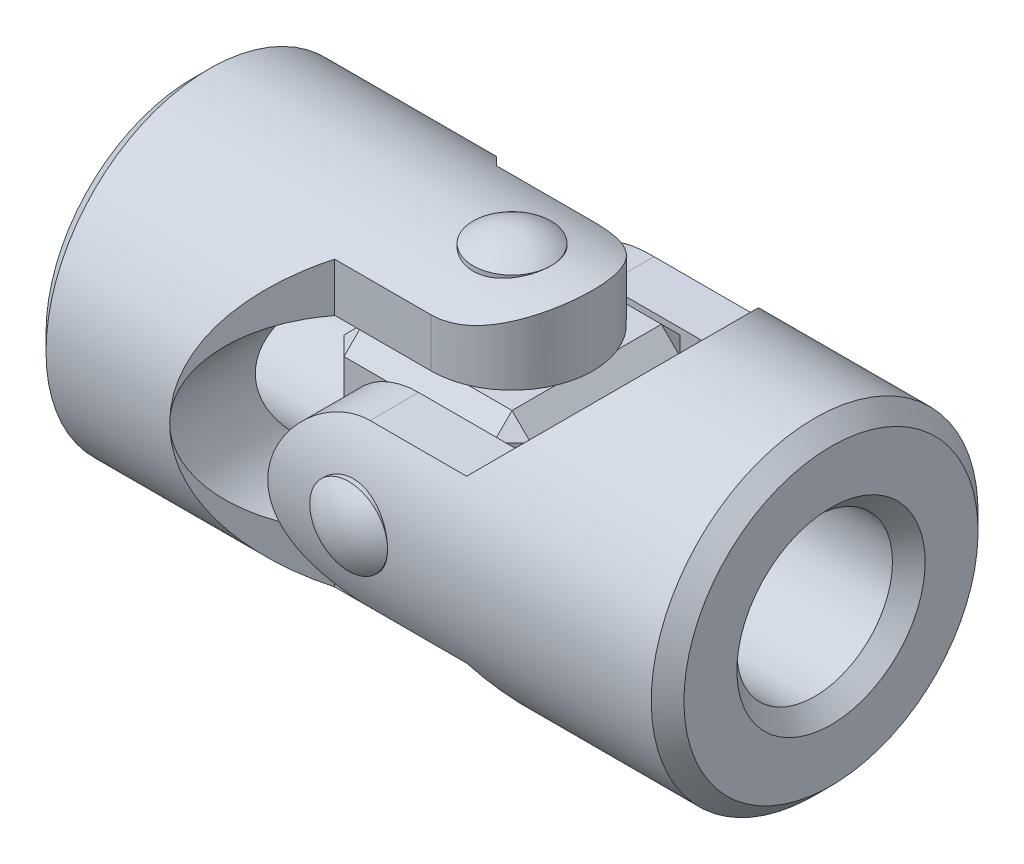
ISO-10303-21;
HEADER;
FILE_DESCRIPTION(('STEP AP214'),'2;1');
FILE_NAME('part.step','',(''),(''),'','','');
FILE_SCHEMA(('AUTOMOTIVE_DESIGN { 1 0 10303 214 1 1 1 1 }'));
ENDSEC;
DATA;
#1=APPLICATION_CONTEXT('core data for automotive mechanical design processes');
#2=APPLICATION_PROTOCOL_DEFINITION('international standard','automotive_design',2000,#1);
#3=PRODUCT_CONTEXT('',#1,'mechanical');
#4=PRODUCT('Part','Part','',(#3));
#5=PRODUCT_RELATED_PRODUCT_CATEGORY('part','',(#4));
#6=PRODUCT_DEFINITION_FORMATION('','',#4);
#7=PRODUCT_DEFINITION_CONTEXT('part definition',#1,'design');
#8=PRODUCT_DEFINITION('design','',#6,#7);
#9=PRODUCT_DEFINITION_SHAPE('','',#8);
#10=(LENGTH_UNIT() NAMED_UNIT(*) SI_UNIT(.MILLI.,.METRE.));
#11=(NAMED_UNIT(*) PLANE_ANGLE_UNIT() SI_UNIT($,.RADIAN.));
#12=(NAMED_UNIT(*) SI_UNIT($,.STERADIAN.) SOLID_ANGLE_UNIT());
#13=UNCERTAINTY_MEASURE_WITH_UNIT(LENGTH_MEASURE(1.E-05),#10,'distance_accuracy_value','');
#14=(GEOMETRIC_REPRESENTATION_CONTEXT(3) GLOBAL_UNCERTAINTY_ASSIGNED_CONTEXT((#13)) GLOBAL_UNIT_ASSIGNED_CONTEXT((#10,
#11,#12)) REPRESENTATION_CONTEXT('',''));
#15=CARTESIAN_POINT('',(0.,0.,0.));
#16=DIRECTION('',(0.,0.,1.));
#17=DIRECTION('',(1.,0.,0.));
#18=AXIS2_PLACEMENT_3D('',#15,#16,#17);
#19=CARTESIAN_POINT('',(0.,21.,0.));
#20=DIRECTION('',(0.,-1.,0.));
#21=DIRECTION('',(-1.,0.,0.));
#22=AXIS2_PLACEMENT_3D('',#19,#20,#21);
#23=CYLINDRICAL_SURFACE('',#22,5.);
#24=CARTESIAN_POINT('',(0.,21.,0.));
#25=DIRECTION('',(0.,1.,0.));
#26=DIRECTION('',(1.,0.,0.));
#27=AXIS2_PLACEMENT_3D('',#24,#25,#26);
#28=CIRCLE('',#27,5.);
#29=CARTESIAN_POINT('',(-5.,21.,0.));
#30=VERTEX_POINT('',#29);
#31=EDGE_CURVE('P0_E10',#30,#30,#28,.T.);
#32=CARTESIAN_POINT('',(0.,-21.,0.));
#33=DIRECTION('',(0.,-1.,0.));
#34=DIRECTION('',(0.,0.,-1.));
#35=AXIS2_PLACEMENT_3D('',#32,#33,#34);
#36=CIRCLE('',#35,5.);
#37=CARTESIAN_POINT('',(-5.,-21.,0.));
#38=VERTEX_POINT('',#37);
#39=EDGE_CURVE('P0_E20',#38,#38,#36,.T.);
#40=CARTESIAN_POINT('',(-5.,21.,0.));
#41=CARTESIAN_POINT('',(-5.,20.5625,0.));
#42=CARTESIAN_POINT('',(-5.,20.125,0.));
#43=CARTESIAN_POINT('',(-5.,19.25,0.));
#44=CARTESIAN_POINT('',(-5.,18.8125,0.));
#45=CARTESIAN_POINT('',(-5.,17.9375,0.));
#46=CARTESIAN_POINT('',(-5.,17.5,0.));
#47=CARTESIAN_POINT('',(-5.,16.625,0.));
#48=CARTESIAN_POINT('',(-5.,16.1875,0.));
#49=CARTESIAN_POINT('',(-5.,15.3125,0.));
#50=CARTESIAN_POINT('',(-5.,14.875,0.));
#51=CARTESIAN_POINT('',(-5.,14.,0.));
#52=CARTESIAN_POINT('',(-5.,13.5625,0.));
#53=CARTESIAN_POINT('',(-5.,12.6875,0.));
#54=CARTESIAN_POINT('',(-5.,12.25,0.));
#55=CARTESIAN_POINT('',(-5.,11.375,0.));
#56=CARTESIAN_POINT('',(-5.,10.9375,0.));
#57=CARTESIAN_POINT('',(-5.,10.0625,0.));
#58=CARTESIAN_POINT('',(-5.,9.625,0.));
#59=CARTESIAN_POINT('',(-5.,8.75,0.));
#60=CARTESIAN_POINT('',(-5.,8.3125,0.));
#61=CARTESIAN_POINT('',(-5.,7.4375,0.));
#62=CARTESIAN_POINT('',(-5.,7.,0.));
#63=CARTESIAN_POINT('',(-5.,6.125,0.));
#64=CARTESIAN_POINT('',(-5.,5.6875,0.));
#65=CARTESIAN_POINT('',(-5.,4.8125,0.));
#66=CARTESIAN_POINT('',(-5.,4.375,0.));
#67=CARTESIAN_POINT('',(-5.,3.5,0.));
#68=CARTESIAN_POINT('',(-5.,3.0625,0.));
#69=CARTESIAN_POINT('',(-5.,2.1875,0.));
#70=CARTESIAN_POINT('',(-5.,1.75,0.));
#71=CARTESIAN_POINT('',(-5.,0.875000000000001,0.));
#72=CARTESIAN_POINT('',(-5.,0.4375,0.));
#73=CARTESIAN_POINT('',(-5.,-0.4375,0.));
#74=CARTESIAN_POINT('',(-5.,-0.875000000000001,0.));
#75=CARTESIAN_POINT('',(-5.,-1.75,0.));
#76=CARTESIAN_POINT('',(-5.,-2.1875,0.));
#77=CARTESIAN_POINT('',(-5.,-3.0625,0.));
#78=CARTESIAN_POINT('',(-5.,-3.5,0.));
#79=CARTESIAN_POINT('',(-5.,-4.375,0.));
#80=CARTESIAN_POINT('',(-5.,-4.8125,0.));
#81=CARTESIAN_POINT('',(-5.,-5.6875,0.));
#82=CARTESIAN_POINT('',(-5.,-6.125,0.));
#83=CARTESIAN_POINT('',(-5.,-7.,0.));
#84=CARTESIAN_POINT('',(-5.,-7.4375,0.));
#85=CARTESIAN_POINT('',(-5.,-8.3125,0.));
#86=CARTESIAN_POINT('',(-5.,-8.75,0.));
#87=CARTESIAN_POINT('',(-5.,-9.625,0.));
#88=CARTESIAN_POINT('',(-5.,-10.0625,0.));
#89=CARTESIAN_POINT('',(-5.,-10.9375,0.));
#90=CARTESIAN_POINT('',(-5.,-11.375,0.));
#91=CARTESIAN_POINT('',(-5.,-12.25,0.));
#92=CARTESIAN_POINT('',(-5.,-12.6875,0.));
#93=CARTESIAN_POINT('',(-5.,-13.5625,0.));
#94=CARTESIAN_POINT('',(-5.,-14.,0.));
#95=CARTESIAN_POINT('',(-5.,-14.875,0.));
#96=CARTESIAN_POINT('',(-5.,-15.3125,0.));
#97=CARTESIAN_POINT('',(-5.,-16.1875,0.));
#98=CARTESIAN_POINT('',(-5.,-16.625,0.));
#99=CARTESIAN_POINT('',(-5.,-17.5,0.));
#100=CARTESIAN_POINT('',(-5.,-17.9375,0.));
#101=CARTESIAN_POINT('',(-5.,-18.8125,0.));
#102=CARTESIAN_POINT('',(-5.,-19.25,0.));
#103=CARTESIAN_POINT('',(-5.,-20.125,0.));
#104=CARTESIAN_POINT('',(-5.,-20.5625,0.));
#105=CARTESIAN_POINT('',(-5.,-21.,0.));
#106=B_SPLINE_CURVE_WITH_KNOTS('',3,(#40,#41,#42,#43,#44,#45,#46,#47,#48,#49,#50,#51,#52,#53,
#54,#55,#56,#57,#58,#59,#60,#61,#62,#63,#64,#65,#66,#67,#68,#69,#70,#71,#72,#73,#74,#75,#76,#77,
#78,#79,#80,#81,#82,#83,#84,#85,#86,#87,#88,#89,#90,#91,#92,#93,#94,#95,#96,#97,#98,#99,#100,
#101,#102,#103,#104,#105),.UNSPECIFIED.,.F.,.F.,(4,2,2,2,2,2,2,2,2,2,2,2,2,2,2,2,2,2,2,2,2,2,2,
2,2,2,2,2,2,2,2,2,4),(0.,1.3125,2.625,3.9375,5.25,6.5625,7.875,9.1875,10.5,11.8125,13.125,
14.4375,15.75,17.0625,18.375,19.6875,21.,22.3125,23.625,24.9375,26.25,27.5625,28.875,30.1875,
31.5,32.8125,34.125,35.4375,36.75,38.0625,39.375,40.6875,42.),.UNSPECIFIED.);
#107=EDGE_CURVE('P0_BSEAM14',#30,#38,#106,.T.);
#108=ORIENTED_EDGE('',*,*,#31,.F.);
#109=ORIENTED_EDGE('',*,*,#39,.F.);
#110=ORIENTED_EDGE('',*,*,#107,.T.);
#111=ORIENTED_EDGE('',*,*,#107,.F.);
#112=EDGE_LOOP('',(#108,#110,#109,#111));
#113=FACE_BOUND('',#112,.T.);
#114=ADVANCED_FACE('P0_F14',(#113),#23,.T.);
#115=CARTESIAN_POINT('',(0.,14.3995238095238,0.));
#116=DIRECTION('',(0.,-1.,0.));
#117=DIRECTION('',(0.,0.,-1.));
#118=AXIS2_PLACEMENT_3D('',#115,#116,#117);
#119=SPHERICAL_SURFACE('',#118,8.28047619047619);
#120=ORIENTED_EDGE('',*,*,#31,.T.);
#121=EDGE_LOOP('',(#120));
#122=FACE_BOUND('',#121,.T.);
#123=ADVANCED_FACE('P0_F29',(#122),#119,.T.);
#124=CARTESIAN_POINT('',(0.,-14.3995238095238,0.));
#125=DIRECTION('',(0.,1.,0.));
#126=DIRECTION('',(0.,0.,-1.));
#127=AXIS2_PLACEMENT_3D('',#124,#125,#126);
#128=SPHERICAL_SURFACE('',#127,8.28047619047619);
#129=ORIENTED_EDGE('',*,*,#39,.T.);
#130=EDGE_LOOP('',(#129));
#131=FACE_BOUND('',#130,.T.);
#132=ADVANCED_FACE('P0_F26',(#131),#128,.T.);
#133=CLOSED_SHELL('',(#114,#123,#132));
#134=MANIFOLD_SOLID_BREP('P0_B1',#133);
#135=CARTESIAN_POINT('',(0.,0.,21.));
#136=DIRECTION('',(0.,0.,-1.));
#137=DIRECTION('',(-1.,0.,0.));
#138=AXIS2_PLACEMENT_3D('',#135,#136,#137);
#139=CYLINDRICAL_SURFACE('',#138,5.);
#140=CARTESIAN_POINT('',(0.,0.,21.));
#141=DIRECTION('',(0.,0.,1.));
#142=DIRECTION('',(1.,0.,0.));
#143=AXIS2_PLACEMENT_3D('',#140,#141,#142);
#144=CIRCLE('',#143,5.);
#145=CARTESIAN_POINT('',(-5.,0.,21.));
#146=VERTEX_POINT('',#145);
#147=EDGE_CURVE('P1_E10',#146,#146,#144,.T.);
#148=CARTESIAN_POINT('',(0.,0.,-21.));
#149=DIRECTION('',(0.,0.,-1.));
#150=DIRECTION('',(0.,1.,0.));
#151=AXIS2_PLACEMENT_3D('',#148,#149,#150);
#152=CIRCLE('',#151,5.);
#153=CARTESIAN_POINT('',(-5.,0.,-21.));
#154=VERTEX_POINT('',#153);
#155=EDGE_CURVE('P1_E20',#154,#154,#152,.T.);
#156=CARTESIAN_POINT('',(-5.,0.,21.));
#157=CARTESIAN_POINT('',(-5.,0.,20.5625));
#158=CARTESIAN_POINT('',(-5.,0.,20.125));
#159=CARTESIAN_POINT('',(-5.,0.,19.25));
#160=CARTESIAN_POINT('',(-5.,0.,18.8125));
#161=CARTESIAN_POINT('',(-5.,0.,17.9375));
#162=CARTESIAN_POINT('',(-5.,0.,17.5));
#163=CARTESIAN_POINT('',(-5.,0.,16.625));
#164=CARTESIAN_POINT('',(-5.,0.,16.1875));
#165=CARTESIAN_POINT('',(-5.,0.,15.3125));
#166=CARTESIAN_POINT('',(-5.,0.,14.875));
#167=CARTESIAN_POINT('',(-5.,0.,14.));
#168=CARTESIAN_POINT('',(-5.,0.,13.5625));
#169=CARTESIAN_POINT('',(-5.,0.,12.6875));
#170=CARTESIAN_POINT('',(-5.,0.,12.25));
#171=CARTESIAN_POINT('',(-5.,0.,11.375));
#172=CARTESIAN_POINT('',(-5.,0.,10.9375));
#173=CARTESIAN_POINT('',(-5.,0.,10.0625));
#174=CARTESIAN_POINT('',(-5.,0.,9.625));
#175=CARTESIAN_POINT('',(-5.,0.,8.75));
#176=CARTESIAN_POINT('',(-5.,0.,8.3125));
#177=CARTESIAN_POINT('',(-5.,0.,7.4375));
#178=CARTESIAN_POINT('',(-5.,0.,7.));
#179=CARTESIAN_POINT('',(-5.,0.,6.125));
#180=CARTESIAN_POINT('',(-5.,0.,5.6875));
#181=CARTESIAN_POINT('',(-5.,0.,4.8125));
#182=CARTESIAN_POINT('',(-5.,0.,4.375));
#183=CARTESIAN_POINT('',(-5.,0.,3.5));
#184=CARTESIAN_POINT('',(-5.,0.,3.0625));
#185=CARTESIAN_POINT('',(-5.,0.,2.1875));
#186=CARTESIAN_POINT('',(-5.,0.,1.75));
#187=CARTESIAN_POINT('',(-5.,0.,0.875000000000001));
#188=CARTESIAN_POINT('',(-5.,0.,0.4375));
#189=CARTESIAN_POINT('',(-5.,0.,-0.4375));
#190=CARTESIAN_POINT('',(-5.,0.,-0.875000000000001));
#191=CARTESIAN_POINT('',(-5.,0.,-1.75));
#192=CARTESIAN_POINT('',(-5.,0.,-2.1875));
#193=CARTESIAN_POINT('',(-5.,0.,-3.0625));
#194=CARTESIAN_POINT('',(-5.,0.,-3.5));
#195=CARTESIAN_POINT('',(-5.,0.,-4.375));
#196=CARTESIAN_POINT('',(-5.,0.,-4.8125));
#197=CARTESIAN_POINT('',(-5.,0.,-5.6875));
#198=CARTESIAN_POINT('',(-5.,0.,-6.125));
#199=CARTESIAN_POINT('',(-5.,0.,-7.));
#200=CARTESIAN_POINT('',(-5.,0.,-7.4375));
#201=CARTESIAN_POINT('',(-5.,0.,-8.3125));
#202=CARTESIAN_POINT('',(-5.,0.,-8.75));
#203=CARTESIAN_POINT('',(-5.,0.,-9.625));
#204=CARTESIAN_POINT('',(-5.,0.,-10.0625));
#205=CARTESIAN_POINT('',(-5.,0.,-10.9375));
#206=CARTESIAN_POINT('',(-5.,0.,-11.375));
#207=CARTESIAN_POINT('',(-5.,0.,-12.25));
#208=CARTESIAN_POINT('',(-5.,0.,-12.6875));
#209=CARTESIAN_POINT('',(-5.,0.,-13.5625));
#210=CARTESIAN_POINT('',(-5.,0.,-14.));
#211=CARTESIAN_POINT('',(-5.,0.,-14.875));
#212=CARTESIAN_POINT('',(-5.,0.,-15.3125));
#213=CARTESIAN_POINT('',(-5.,0.,-16.1875));
#214=CARTESIAN_POINT('',(-5.,0.,-16.625));
#215=CARTESIAN_POINT('',(-5.,0.,-17.5));
#216=CARTESIAN_POINT('',(-5.,0.,-17.9375));
#217=CARTESIAN_POINT('',(-5.,0.,-18.8125));
#218=CARTESIAN_POINT('',(-5.,0.,-19.25));
#219=CARTESIAN_POINT('',(-5.,0.,-20.125));
#220=CARTESIAN_POINT('',(-5.,0.,-20.5625));
#221=CARTESIAN_POINT('',(-5.,0.,-21.));
#222=B_SPLINE_CURVE_WITH_KNOTS('',3,(#156,#157,#158,#159,#160,#161,#162,#163,#164,#165,#166,
#167,#168,#169,#170,#171,#172,#173,#174,#175,#176,#177,#178,#179,#180,#181,#182,#183,#184,#185,
#186,#187,#188,#189,#190,#191,#192,#193,#194,#195,#196,#197,#198,#199,#200,#201,#202,#203,#204,
#205,#206,#207,#208,#209,#210,#211,#212,#213,#214,#215,#216,#217,#218,#219,#220,#221),
.UNSPECIFIED.,.F.,.F.,(4,2,2,2,2,2,2,2,2,2,2,2,2,2,2,2,2,2,2,2,2,2,2,2,2,2,2,2,2,2,2,2,4),(0.,
1.3125,2.625,3.9375,5.25,6.5625,7.875,9.1875,10.5,11.8125,13.125,14.4375,15.75,17.0625,18.375,
19.6875,21.,22.3125,23.625,24.9375,26.25,27.5625,28.875,30.1875,31.5,32.8125,34.125,35.4375,
36.75,38.0625,39.375,40.6875,42.),.UNSPECIFIED.);
#223=EDGE_CURVE('P1_BSEAM14',#146,#154,#222,.T.);
#224=ORIENTED_EDGE('',*,*,#147,.F.);
#225=ORIENTED_EDGE('',*,*,#155,.F.);
#226=ORIENTED_EDGE('',*,*,#223,.T.);
#227=ORIENTED_EDGE('',*,*,#223,.F.);
#228=EDGE_LOOP('',(#224,#226,#225,#227));
#229=FACE_BOUND('',#228,.T.);
#230=ADVANCED_FACE('P1_F14',(#229),#139,.T.);
#231=CARTESIAN_POINT('',(0.,0.,14.3995238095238));
#232=DIRECTION('',(0.,0.,-1.));
#233=DIRECTION('',(0.,1.,0.));
#234=AXIS2_PLACEMENT_3D('',#231,#232,#233);
#235=SPHERICAL_SURFACE('',#234,8.28047619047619);
#236=ORIENTED_EDGE('',*,*,#147,.T.);
#237=EDGE_LOOP('',(#236));
#238=FACE_BOUND('',#237,.T.);
#239=ADVANCED_FACE('P1_F29',(#238),#235,.T.);
#240=CARTESIAN_POINT('',(0.,0.,-14.3995238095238));
#241=DIRECTION('',(0.,0.,1.));
#242=DIRECTION('',(0.,1.,0.));
#243=AXIS2_PLACEMENT_3D('',#240,#241,#242);
#244=SPHERICAL_SURFACE('',#243,8.28047619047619);
#245=ORIENTED_EDGE('',*,*,#155,.T.);
#246=EDGE_LOOP('',(#245));
#247=FACE_BOUND('',#246,.T.);
#248=ADVANCED_FACE('P1_F26',(#247),#244,.T.);
#249=CLOSED_SHELL('',(#230,#239,#248));
#250=MANIFOLD_SOLID_BREP('P1_B1',#249);
#251=CARTESIAN_POINT('',(0.,-21.,-10.4));
#252=DIRECTION('',(0.,0.,1.));
#253=DIRECTION('',(1.,0.,0.));
#254=AXIS2_PLACEMENT_3D('',#251,#252,#253);
#255=PLANE('',#254);
#256=DIRECTION('',(0.,1.,0.));
#257=VECTOR('',#256,1.);
#258=CARTESIAN_POINT('',(0.,-21.,-10.4));
#259=LINE('',#258,#257);
#260=CARTESIAN_POINT('',(0.,12.,-10.4));
#261=VERTEX_POINT('',#260);
#262=CARTESIAN_POINT('',(0.,18.2439030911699,-10.4));
#263=VERTEX_POINT('',#262);
#264=EDGE_CURVE('P2_E282',#261,#263,#259,.T.);
#265=ORIENTED_EDGE('',*,*,#264,.F.);
#266=DIRECTION('',(-1.,0.,0.));
#267=VECTOR('',#266,1.);
#268=CARTESIAN_POINT('',(0.,12.,-10.4));
#269=LINE('',#268,#267);
#270=CARTESIAN_POINT('',(-12.,12.,-10.4));
#271=VERTEX_POINT('',#270);
#272=EDGE_CURVE('P2_E132',#261,#271,#269,.T.);
#273=ORIENTED_EDGE('',*,*,#272,.T.);
#274=CARTESIAN_POINT('',(-10.9545454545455,0.,-10.4));
#275=DIRECTION('',(0.,0.,1.));
#276=DIRECTION('',(1.,0.,0.));
#277=AXIS2_PLACEMENT_3D('',#274,#275,#276);
#278=CIRCLE('',#277,12.0454545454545);
#279=CARTESIAN_POINT('',(-12.4,11.9584127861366,-10.4));
#280=VERTEX_POINT('',#279);
#281=EDGE_CURVE('P2_E146',#271,#280,#278,.T.);
#282=ORIENTED_EDGE('',*,*,#281,.T.);
#283=DIRECTION('',(0.,1.,0.));
#284=VECTOR('',#283,1.);
#285=CARTESIAN_POINT('',(-12.4,-21.,-10.4));
#286=LINE('',#285,#284);
#287=CARTESIAN_POINT('',(-12.4,18.2439030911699,-10.4));
#288=VERTEX_POINT('',#287);
#289=EDGE_CURVE('P2_E289',#280,#288,#286,.T.);
#290=ORIENTED_EDGE('',*,*,#289,.T.);
#291=DIRECTION('',(1.,0.,0.));
#292=VECTOR('',#291,1.);
#293=CARTESIAN_POINT('',(-41.,18.2439030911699,-10.4));
#294=LINE('',#293,#292);
#295=EDGE_CURVE('P2_E227',#263,#288,#294,.F.);
#296=ORIENTED_EDGE('',*,*,#295,.F.);
#297=EDGE_LOOP('',(#265,#273,#282,#290,#296));
#298=FACE_BOUND('',#297,.T.);
#299=ADVANCED_FACE('P2_F16',(#298),#255,.F.);
#300=CARTESIAN_POINT('',(-12.4,-21.,-10.4));
#301=DIRECTION('',(-0.707106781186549,0.,0.707106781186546));
#302=DIRECTION('',(0.707106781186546,0.,0.707106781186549));
#303=AXIS2_PLACEMENT_3D('',#300,#301,#302);
#304=PLANE('',#303);
#305=CARTESIAN_POINT('',(-2.00000000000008,0.,0.));
#306=DIRECTION('',(-0.707106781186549,0.,0.707106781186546));
#307=DIRECTION('',(0.707106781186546,0.,0.707106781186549));
#308=AXIS2_PLACEMENT_3D('',#305,#306,#307);
#309=ELLIPSE('',#308,29.6984848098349,21.);
#310=CARTESIAN_POINT('',(-23.,0.,-21.));
#311=VERTEX_POINT('',#310);
#312=CARTESIAN_POINT('',(-12.4,-18.2439030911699,-10.4));
#313=VERTEX_POINT('',#312);
#314=EDGE_CURVE('P2_E230',#311,#313,#309,.T.);
#315=ORIENTED_EDGE('',*,*,#314,.F.);
#316=CARTESIAN_POINT('',(-10.9545454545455,0.,-8.95454545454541));
#317=DIRECTION('',(-0.707106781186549,0.,0.707106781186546));
#318=DIRECTION('',(-0.707106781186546,0.,-0.707106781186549));
#319=AXIS2_PLACEMENT_3D('',#316,#317,#318);
#320=ELLIPSE('',#319,17.0348451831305,12.0454545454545);
#321=CARTESIAN_POINT('',(-12.4,-11.9584127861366,-10.4));
#322=VERTEX_POINT('',#321);
#323=EDGE_CURVE('P2_E143',#311,#322,#320,.T.);
#324=ORIENTED_EDGE('',*,*,#323,.T.);
#325=EDGE_CURVE('P2_E286',#313,#322,#286,.T.);
#326=ORIENTED_EDGE('',*,*,#325,.F.);
#327=EDGE_LOOP('',(#315,#324,#326));
#328=FACE_BOUND('',#327,.T.);
#329=ADVANCED_FACE('P2_F181',(#328),#304,.F.);
#330=CARTESIAN_POINT('',(-12.4,-21.,10.4));
#331=DIRECTION('',(-0.707106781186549,0.,-0.707106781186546));
#332=DIRECTION('',(-0.707106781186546,0.,0.707106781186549));
#333=AXIS2_PLACEMENT_3D('',#330,#331,#332);
#334=PLANE('',#333);
#335=DIRECTION('',(0.,1.,0.));
#336=VECTOR('',#335,1.);
#337=CARTESIAN_POINT('',(-12.4,-21.,10.4));
#338=LINE('',#337,#336);
#339=CARTESIAN_POINT('',(-12.4,-18.2439030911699,10.4));
#340=VERTEX_POINT('',#339);
#341=CARTESIAN_POINT('',(-12.4,-11.9584127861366,10.4));
#342=VERTEX_POINT('',#341);
#343=EDGE_CURVE('P2_E39',#340,#342,#338,.T.);
#344=ORIENTED_EDGE('',*,*,#343,.T.);
#345=CARTESIAN_POINT('',(-10.9545454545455,0.,8.95454545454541));
#346=DIRECTION('',(-0.707106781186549,0.,-0.707106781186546));
#347=DIRECTION('',(0.707106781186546,0.,-0.707106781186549));
#348=AXIS2_PLACEMENT_3D('',#345,#346,#347);
#349=ELLIPSE('',#348,17.0348451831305,12.0454545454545);
#350=CARTESIAN_POINT('',(-23.,0.,21.));
#351=VERTEX_POINT('',#350);
#352=EDGE_CURVE('P2_E107',#342,#351,#349,.T.);
#353=ORIENTED_EDGE('',*,*,#352,.T.);
#354=CARTESIAN_POINT('',(-2.00000000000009,0.,0.));
#355=DIRECTION('',(-0.707106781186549,0.,-0.707106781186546));
#356=DIRECTION('',(0.707106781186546,0.,-0.707106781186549));
#357=AXIS2_PLACEMENT_3D('',#354,#355,#356);
#358=ELLIPSE('',#357,29.6984848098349,21.);
#359=EDGE_CURVE('P2_E241',#340,#351,#358,.T.);
#360=ORIENTED_EDGE('',*,*,#359,.F.);
#361=EDGE_LOOP('',(#344,#353,#360));
#362=FACE_BOUND('',#361,.T.);
#363=ADVANCED_FACE('P2_F185',(#362),#334,.F.);
#364=CARTESIAN_POINT('',(0.,-21.,10.4));
#365=DIRECTION('',(0.,0.,-1.));
#366=DIRECTION('',(-1.,0.,0.));
#367=AXIS2_PLACEMENT_3D('',#364,#365,#366);
#368=PLANE('',#367);
#369=CARTESIAN_POINT('',(-10.9545454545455,0.,10.4));
#370=DIRECTION('',(0.,0.,-1.));
#371=DIRECTION('',(-1.,0.,0.));
#372=AXIS2_PLACEMENT_3D('',#369,#370,#371);
#373=CIRCLE('',#372,12.0454545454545);
#374=CARTESIAN_POINT('',(-12.4,11.9584127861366,10.4));
#375=VERTEX_POINT('',#374);
#376=CARTESIAN_POINT('',(-12.,12.,10.4));
#377=VERTEX_POINT('',#376);
#378=EDGE_CURVE('P2_E108',#375,#377,#373,.T.);
#379=ORIENTED_EDGE('',*,*,#378,.T.);
#380=DIRECTION('',(1.,0.,0.));
#381=VECTOR('',#380,1.);
#382=CARTESIAN_POINT('',(0.,12.,10.4));
#383=LINE('',#382,#381);
#384=CARTESIAN_POINT('',(0.,12.,10.4));
#385=VERTEX_POINT('',#384);
#386=EDGE_CURVE('P2_E129',#377,#385,#383,.T.);
#387=ORIENTED_EDGE('',*,*,#386,.T.);
#388=DIRECTION('',(0.,1.,0.));
#389=VECTOR('',#388,1.);
#390=CARTESIAN_POINT('',(0.,-21.,10.4));
#391=LINE('',#390,#389);
#392=CARTESIAN_POINT('',(0.,18.2439030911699,10.4));
#393=VERTEX_POINT('',#392);
#394=EDGE_CURVE('P2_E154',#385,#393,#391,.T.);
#395=ORIENTED_EDGE('',*,*,#394,.T.);
#396=DIRECTION('',(1.,0.,0.));
#397=VECTOR('',#396,1.);
#398=CARTESIAN_POINT('',(-41.,18.2439030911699,10.4));
#399=LINE('',#398,#397);
#400=CARTESIAN_POINT('',(-12.4,18.2439030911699,10.4));
#401=VERTEX_POINT('',#400);
#402=EDGE_CURVE('P2_E244',#401,#393,#399,.T.);
#403=ORIENTED_EDGE('',*,*,#402,.F.);
#404=EDGE_CURVE('P2_E292',#375,#401,#338,.T.);
#405=ORIENTED_EDGE('',*,*,#404,.F.);
#406=EDGE_LOOP('',(#379,#387,#395,#403,#405));
#407=FACE_BOUND('',#406,.T.);
#408=ADVANCED_FACE('P2_F188',(#407),#368,.F.);
#409=CARTESIAN_POINT('',(0.,-21.,0.));
#410=DIRECTION('',(0.,1.,0.));
#411=DIRECTION('',(0.,0.,-1.));
#412=AXIS2_PLACEMENT_3D('',#409,#410,#411);
#413=CYLINDRICAL_SURFACE('',#412,10.4);
#414=ORIENTED_EDGE('',*,*,#394,.F.);
#415=CARTESIAN_POINT('',(0.,12.,0.));
#416=DIRECTION('',(0.,1.,0.));
#417=DIRECTION('',(1.,0.,0.));
#418=AXIS2_PLACEMENT_3D('',#415,#416,#417);
#419=CIRCLE('',#418,10.4);
#420=EDGE_CURVE('P2_E109',#385,#261,#419,.T.);
#421=ORIENTED_EDGE('',*,*,#420,.T.);
#422=ORIENTED_EDGE('',*,*,#264,.T.);
#423=CARTESIAN_POINT('',(0.,18.2439030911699,10.4));
#424=CARTESIAN_POINT('',(0.13638420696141,18.2439000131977,10.4000010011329));
#425=CARTESIAN_POINT('',(0.272749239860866,18.2454330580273,10.3973166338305));
#426=CARTESIAN_POINT('',(0.545193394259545,18.2515398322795,10.3865946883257));
#427=CARTESIAN_POINT('',(0.681272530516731,18.2561134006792,10.3785573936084));
#428=CARTESIAN_POINT('',(1.08850613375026,18.2743377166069,10.346459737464));
#429=CARTESIAN_POINT('',(1.35888385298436,18.2924921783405,10.3144135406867));
#430=CARTESIAN_POINT('',(1.8937572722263,18.3400025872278,10.2296933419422));
#431=CARTESIAN_POINT('',(2.15827753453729,18.3692948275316,10.1771366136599));
#432=CARTESIAN_POINT('',(2.6812175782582,18.4380510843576,10.0520325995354));
#433=CARTESIAN_POINT('',(2.93963667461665,18.4775162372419,9.97948308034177));
#434=CARTESIAN_POINT('',(3.44814022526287,18.5652117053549,9.81537248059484));
#435=CARTESIAN_POINT('',(3.69824273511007,18.6134213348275,9.72385619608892));
#436=CARTESIAN_POINT('',(4.18944976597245,18.7172054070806,9.52255404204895));
#437=CARTESIAN_POINT('',(4.43055075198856,18.7727827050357,9.4127610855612));
#438=CARTESIAN_POINT('',(5.13902172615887,18.9483586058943,9.05702702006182));
#439=CARTESIAN_POINT('',(5.59128932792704,19.0771518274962,8.78481890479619));
#440=CARTESIAN_POINT('',(6.48186204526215,19.3561649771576,8.15273692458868));
#441=CARTESIAN_POINT('',(6.91614292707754,19.5072748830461,7.78758544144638));
#442=CARTESIAN_POINT('',(7.51902346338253,19.7317252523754,7.19058309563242));
#443=CARTESIAN_POINT('',(7.71199810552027,19.8062184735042,6.98322587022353));
#444=CARTESIAN_POINT('',(8.08076159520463,19.9526957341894,6.55297526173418));
#445=CARTESIAN_POINT('',(8.25655665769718,20.0246806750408,6.33008754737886));
#446=CARTESIAN_POINT('',(8.6009470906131,20.1690418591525,5.85453078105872));
#447=CARTESIAN_POINT('',(8.76829241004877,20.2411276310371,5.60086697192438));
#448=CARTESIAN_POINT('',(9.08085448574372,20.3784741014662,5.07845674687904));
#449=CARTESIAN_POINT('',(9.22606999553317,20.4437344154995,4.80970948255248));
#450=CARTESIAN_POINT('',(9.49287542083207,20.5655196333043,4.2589774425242));
#451=CARTESIAN_POINT('',(9.61447643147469,20.6220486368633,3.97699896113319));
#452=CARTESIAN_POINT('',(9.83274558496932,20.7247099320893,3.40172422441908));
#453=CARTESIAN_POINT('',(9.92941631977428,20.770843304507,3.10842914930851));
#454=CARTESIAN_POINT('',(10.0907306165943,20.8484581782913,2.53374988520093));
#455=CARTESIAN_POINT('',(10.1571427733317,20.8807394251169,2.25296967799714));
#456=CARTESIAN_POINT('',(10.2665167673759,20.934160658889,1.68582848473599));
#457=CARTESIAN_POINT('',(10.3094796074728,20.9553011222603,1.39946773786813));
#458=CARTESIAN_POINT('',(10.3713722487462,20.985819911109,0.823675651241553));
#459=CARTESIAN_POINT('',(10.3903136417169,20.9952039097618,0.534245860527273));
#460=CARTESIAN_POINT('',(10.4039391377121,21.0019501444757,-0.0453170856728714));
#461=CARTESIAN_POINT('',(10.3986246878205,20.9993130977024,-0.335450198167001));
#462=CARTESIAN_POINT('',(10.3653093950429,20.982837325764,-0.889152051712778));
#463=CARTESIAN_POINT('',(10.3392864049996,20.9699752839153,-1.1528717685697));
#464=CARTESIAN_POINT('',(10.2673234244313,20.9345873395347,-1.6769040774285));
#465=CARTESIAN_POINT('',(10.2213848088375,20.9120621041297,-1.93721690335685));
#466=CARTESIAN_POINT('',(10.1100879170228,20.857888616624,-2.45268250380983));
#467=CARTESIAN_POINT('',(10.0447293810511,20.8262402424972,-2.70783520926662));
#468=CARTESIAN_POINT('',(9.89525520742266,20.7545604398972,-3.21137205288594));
#469=CARTESIAN_POINT('',(9.81113890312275,20.7145287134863,-3.45975595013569));
#470=CARTESIAN_POINT('',(9.6236347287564,20.6263762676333,-3.95169373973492));
#471=CARTESIAN_POINT('',(9.51999722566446,20.5781516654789,-4.1951338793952));
#472=CARTESIAN_POINT('',(9.29510828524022,20.4750844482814,-4.67232374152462));
#473=CARTESIAN_POINT('',(9.17385060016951,20.4202394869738,-4.90606998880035));
#474=CARTESIAN_POINT('',(8.7850312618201,20.2475327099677,-5.59093859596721));
#475=CARTESIAN_POINT('',(8.49231236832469,20.121445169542,-6.02597937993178));
#476=CARTESIAN_POINT('',(7.81693733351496,19.8454272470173,-6.88334864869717));
#477=CARTESIAN_POINT('',(7.4284445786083,19.6943699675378,-7.30072119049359));
#478=CARTESIAN_POINT('',(6.7987687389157,19.4685613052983,-7.87513375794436));
#479=CARTESIAN_POINT('',(6.58086253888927,19.3933619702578,-8.05812147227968));
#480=CARTESIAN_POINT('',(6.13023337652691,19.2451157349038,-8.40602261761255));
#481=CARTESIAN_POINT('',(5.89750817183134,19.1720691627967,-8.57093330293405));
#482=CARTESIAN_POINT('',(5.4034264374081,19.0257176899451,-8.89128868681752));
#483=CARTESIAN_POINT('',(5.14118949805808,18.9526812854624,-9.04549994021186));
#484=CARTESIAN_POINT('',(4.60282000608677,18.8137816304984,-9.33095996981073));
#485=CARTESIAN_POINT('',(4.32669389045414,18.74791510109,-9.4622192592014));
#486=CARTESIAN_POINT('',(3.76263296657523,18.6258351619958,-9.70031687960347));
#487=CARTESIAN_POINT('',(3.47471994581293,18.5696048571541,-9.80719806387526));
#488=CARTESIAN_POINT('',(2.88873869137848,18.4689373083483,-9.99548847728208));
#489=CARTESIAN_POINT('',(2.59067493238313,18.4244949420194,-10.0769087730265));
#490=CARTESIAN_POINT('',(2.10223792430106,18.3636885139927,-10.1871106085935));
#491=CARTESIAN_POINT('',(1.91420385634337,18.3430828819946,-10.224120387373));
#492=CARTESIAN_POINT('',(1.53589529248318,18.3074721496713,-10.2877497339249));
#493=CARTESIAN_POINT('',(1.34562143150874,18.2924654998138,-10.3143721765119));
#494=CARTESIAN_POINT('',(0.963224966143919,18.2683163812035,-10.3570870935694));
#495=CARTESIAN_POINT('',(0.771099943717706,18.2591830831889,-10.3731631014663));
#496=CARTESIAN_POINT('',(0.385986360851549,18.246965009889,-10.3946280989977));
#497=CARTESIAN_POINT('',(0.192997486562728,18.2438826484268,-10.4000128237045));
#498=CARTESIAN_POINT('',(0.,18.2439030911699,-10.4));
#499=B_SPLINE_CURVE_WITH_KNOTS('',3,(#423,#424,#425,#426,#427,#428,#429,#430,#431,#432,#433,
#434,#435,#436,#437,#438,#439,#440,#441,#442,#443,#444,#445,#446,#447,#448,#449,#450,#451,#452,
#453,#454,#455,#456,#457,#458,#459,#460,#461,#462,#463,#464,#465,#466,#467,#468,#469,#470,#471,
#472,#473,#474,#475,#476,#477,#478,#479,#480,#481,#482,#483,#484,#485,#486,#487,#488,#489,#490,
#491,#492,#493,#494,#495,#496,#497,#498),.UNSPECIFIED.,.F.,.F.,(4,2,2,2,2,2,2,2,2,2,2,2,2,2,2,2,
2,2,2,2,2,2,2,2,2,2,2,2,2,2,2,2,2,2,2,2,2,4),(0.,0.409079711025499,0.818137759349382,
1.63557519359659,2.44840565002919,3.26132694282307,4.07234970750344,4.88368768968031,
6.50722001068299,8.26087400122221,9.13879065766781,10.016388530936,10.9521703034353,
11.8880047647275,12.8233984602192,13.7586948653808,14.6285013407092,15.4982706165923,
16.3676200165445,17.2369175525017,18.0319153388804,18.8268582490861,19.6218117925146,
20.4167935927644,21.2227322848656,22.028957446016,23.6404766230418,25.4020568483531,
26.2842472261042,27.1665714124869,28.1039715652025,29.0409412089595,29.9762508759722,
30.9111534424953,31.4890611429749,32.0668087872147,32.6454563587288,33.2243347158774),.UNSPECIFIED.);
#500=EDGE_CURVE('P2_E203',#393,#263,#499,.T.);
#501=ORIENTED_EDGE('',*,*,#500,.F.);
#502=EDGE_LOOP('',(#414,#421,#422,#501));
#503=FACE_BOUND('',#502,.T.);
#504=ADVANCED_FACE('P2_F192',(#503),#413,.T.);
#505=CARTESIAN_POINT('',(-41.,0.,0.));
#506=DIRECTION('',(-1.,0.,0.));
#507=DIRECTION('',(0.,0.,1.));
#508=AXIS2_PLACEMENT_3D('',#505,#506,#507);
#509=PLANE('',#508);
#510=CARTESIAN_POINT('',(-41.,0.,0.));
#511=DIRECTION('',(-1.,0.,0.));
#512=DIRECTION('',(0.,0.,1.));
#513=AXIS2_PLACEMENT_3D('',#510,#511,#512);
#514=CIRCLE('',#513,12.1);
#515=CARTESIAN_POINT('',(-41.,0.,12.1));
#516=VERTEX_POINT('',#515);
#517=EDGE_CURVE('P2_E24',#516,#516,#514,.F.);
#518=ORIENTED_EDGE('',*,*,#517,.T.);
#519=EDGE_LOOP('',(#518));
#520=FACE_BOUND('',#519,.T.);
#521=CARTESIAN_POINT('',(-41.,0.,0.));
#522=DIRECTION('',(-1.,0.,0.));
#523=DIRECTION('',(0.,0.,1.));
#524=AXIS2_PLACEMENT_3D('',#521,#522,#523);
#525=CIRCLE('',#524,18.9);
#526=CARTESIAN_POINT('',(-41.,0.,18.9));
#527=VERTEX_POINT('',#526);
#528=EDGE_CURVE('P2_E254',#527,#527,#525,.T.);
#529=ORIENTED_EDGE('',*,*,#528,.T.);
#530=EDGE_LOOP('',(#529));
#531=FACE_BOUND('',#530,.T.);
#532=ADVANCED_FACE('P2_F213',(#520,#531),#509,.T.);
#533=CARTESIAN_POINT('',(-41.,0.,0.));
#534=DIRECTION('',(1.,0.,0.));
#535=DIRECTION('',(0.,0.,-1.));
#536=AXIS2_PLACEMENT_3D('',#533,#534,#535);
#537=CYLINDRICAL_SURFACE('',#536,21.);
#538=CARTESIAN_POINT('',(-38.9,0.,0.));
#539=DIRECTION('',(-1.,0.,0.));
#540=DIRECTION('',(0.,0.,1.));
#541=AXIS2_PLACEMENT_3D('',#538,#539,#540);
#542=CIRCLE('',#541,21.);
#543=CARTESIAN_POINT('',(-38.9,0.,21.));
#544=VERTEX_POINT('',#543);
#545=EDGE_CURVE('P2_E11',#544,#544,#542,.F.);
#546=ORIENTED_EDGE('',*,*,#545,.T.);
#547=EDGE_LOOP('',(#546));
#548=FACE_BOUND('',#547,.T.);
#549=CARTESIAN_POINT('',(5.,-21.,0.));
#550=CARTESIAN_POINT('',(4.99999151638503,-20.9999950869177,-0.276672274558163));
#551=CARTESIAN_POINT('',(4.97695835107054,-20.9944774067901,-0.553442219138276));
#552=CARTESIAN_POINT('',(4.88555542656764,-20.9730002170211,-1.09907770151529));
#553=CARTESIAN_POINT('',(4.8171573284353,-20.9570341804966,-1.36793818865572));
#554=CARTESIAN_POINT('',(4.63732205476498,-20.9164321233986,-1.88979410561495));
#555=CARTESIAN_POINT('',(4.52593393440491,-20.891805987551,-2.14280723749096));
#556=CARTESIAN_POINT('',(4.26344658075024,-20.8365202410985,-2.62655227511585));
#557=CARTESIAN_POINT('',(4.11234692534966,-20.8058605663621,-2.85728394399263));
#558=CARTESIAN_POINT('',(3.77172133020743,-20.7412034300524,-3.29425969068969));
#559=CARTESIAN_POINT('',(3.58158995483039,-20.7071583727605,-3.50002481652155));
#560=CARTESIAN_POINT('',(3.1695956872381,-20.6398911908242,-3.87706759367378));
#561=CARTESIAN_POINT('',(2.94772953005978,-20.6066691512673,-4.04834169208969));
#562=CARTESIAN_POINT('',(2.47491504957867,-20.5443340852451,-4.35373775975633));
#563=CARTESIAN_POINT('',(2.22361856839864,-20.5152817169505,-4.48733420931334));
#564=CARTESIAN_POINT('',(1.70133277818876,-20.4652654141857,-4.71020659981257));
#565=CARTESIAN_POINT('',(1.43034630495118,-20.4443003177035,-4.79948890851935));
#566=CARTESIAN_POINT('',(0.88161222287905,-20.4133198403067,-4.92958478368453));
#567=CARTESIAN_POINT('',(0.604078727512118,-20.4031113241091,-4.9712544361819));
#568=CARTESIAN_POINT('',(0.045787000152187,-20.3942210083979,-5.00760694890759));
#569=CARTESIAN_POINT('',(-0.234970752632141,-20.3955375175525,-5.00229670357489));
#570=CARTESIAN_POINT('',(-0.785259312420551,-20.4093743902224,-4.94552551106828));
#571=CARTESIAN_POINT('',(-1.05490141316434,-20.4216495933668,-4.89507437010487));
#572=CARTESIAN_POINT('',(-1.58178052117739,-20.4556312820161,-4.75106000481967));
#573=CARTESIAN_POINT('',(-1.83901671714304,-20.4773383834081,-4.65749396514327));
#574=CARTESIAN_POINT('',(-2.33654137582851,-20.5279695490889,-4.42901918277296));
#575=CARTESIAN_POINT('',(-2.57665071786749,-20.5569586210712,-4.29373539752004));
#576=CARTESIAN_POINT('',(-3.03112705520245,-20.6188494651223,-3.98592814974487));
#577=CARTESIAN_POINT('',(-3.24548992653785,-20.6517518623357,-3.813398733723));
#578=CARTESIAN_POINT('',(-3.64818620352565,-20.7188021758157,-3.43072154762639));
#579=CARTESIAN_POINT('',(-3.83570651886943,-20.7529603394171,-3.2197189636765));
#580=CARTESIAN_POINT('',(-4.17284651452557,-20.8179059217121,-2.76886002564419));
#581=CARTESIAN_POINT('',(-4.32246523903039,-20.8486932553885,-2.52900294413));
#582=CARTESIAN_POINT('',(-4.57981431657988,-20.9035591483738,-2.02615010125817));
#583=CARTESIAN_POINT('',(-4.68742273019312,-20.9276181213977,-1.76308965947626));
#584=CARTESIAN_POINT('',(-4.85667190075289,-20.9661730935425,-1.2219158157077));
#585=CARTESIAN_POINT('',(-4.91832061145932,-20.9806707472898,-0.943805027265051));
#586=CARTESIAN_POINT('',(-4.99268210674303,-20.9982284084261,-0.387385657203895));
#587=CARTESIAN_POINT('',(-5.00650346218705,-21.0015474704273,-0.109233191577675));
#588=CARTESIAN_POINT('',(-4.98784426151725,-20.9971071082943,0.445408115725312));
#589=CARTESIAN_POINT('',(-4.95536746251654,-20.9893485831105,0.721897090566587));
#590=CARTESIAN_POINT('',(-4.84595008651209,-20.9637898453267,1.26158148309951));
#591=CARTESIAN_POINT('',(-4.76960507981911,-20.9461242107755,1.52490459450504));
#592=CARTESIAN_POINT('',(-4.57529109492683,-20.9027358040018,2.03499926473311));
#593=CARTESIAN_POINT('',(-4.4573181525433,-20.8770122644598,2.28176924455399));
#594=CARTESIAN_POINT('',(-4.18088534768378,-20.8197328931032,2.75623238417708));
#595=CARTESIAN_POINT('',(-4.02179254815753,-20.7880882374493,2.98354580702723));
#596=CARTESIAN_POINT('',(-3.66845455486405,-20.7226320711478,3.40864470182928));
#597=CARTESIAN_POINT('',(-3.47420388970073,-20.6888202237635,3.606425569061));
#598=CARTESIAN_POINT('',(-3.05093869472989,-20.6219225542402,3.97134130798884));
#599=CARTESIAN_POINT('',(-2.82125066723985,-20.5888692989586,4.13770216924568));
#600=CARTESIAN_POINT('',(-2.33655411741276,-20.5280730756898,4.42950564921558));
#601=CARTESIAN_POINT('',(-2.08154672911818,-20.5003298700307,4.55495009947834));
#602=CARTESIAN_POINT('',(-1.55484171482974,-20.4535871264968,4.76045016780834));
#603=CARTESIAN_POINT('',(-1.28325309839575,-20.4345362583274,4.84077290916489));
#604=CARTESIAN_POINT('',(-0.729910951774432,-20.4072662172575,4.95448974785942));
#605=CARTESIAN_POINT('',(-0.448159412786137,-20.3990449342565,4.9878929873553));
#606=CARTESIAN_POINT('',(0.109664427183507,-20.3945149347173,5.00637908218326));
#607=CARTESIAN_POINT('',(0.385694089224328,-20.3979022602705,4.99269483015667));
#608=CARTESIAN_POINT('',(0.931390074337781,-20.4155111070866,4.92019018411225));
#609=CARTESIAN_POINT('',(1.20105650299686,-20.4297324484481,4.86137053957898));
#610=CARTESIAN_POINT('',(1.72517347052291,-20.4672456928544,4.70090846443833));
#611=CARTESIAN_POINT('',(1.9796919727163,-20.4904928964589,4.59947686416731));
#612=CARTESIAN_POINT('',(2.46827066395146,-20.5434488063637,4.35684092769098));
#613=CARTESIAN_POINT('',(2.70232827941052,-20.573158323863,4.21563159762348));
#614=CARTESIAN_POINT('',(3.14934702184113,-20.6365744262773,3.89349523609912));
#615=CARTESIAN_POINT('',(3.36167395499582,-20.6703592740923,3.71170340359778));
#616=CARTESIAN_POINT('',(3.75321023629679,-20.7376300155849,3.31527481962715));
#617=CARTESIAN_POINT('',(3.93241180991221,-20.7711158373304,3.10063037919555));
#618=CARTESIAN_POINT('',(4.25538902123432,-20.8346538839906,2.64044421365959));
#619=CARTESIAN_POINT('',(4.39855175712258,-20.8646425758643,2.39446295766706));
#620=CARTESIAN_POINT('',(4.64126698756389,-20.9171515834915,1.8812448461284));
#621=CARTESIAN_POINT('',(4.74085287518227,-20.9396776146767,1.61402445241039));
#622=CARTESIAN_POINT('',(4.87761696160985,-20.9711168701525,1.12247311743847));
#623=CARTESIAN_POINT('',(4.9234161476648,-20.981876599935,0.90061861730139));
#624=CARTESIAN_POINT('',(4.98461019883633,-20.9963199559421,0.452531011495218));
#625=CARTESIAN_POINT('',(5.00000693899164,-21.0000040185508,0.226298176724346));
#626=CARTESIAN_POINT('',(5.,-21.,0.));
#627=B_SPLINE_CURVE_WITH_KNOTS('',3,(#549,#550,#551,#552,#553,#554,#555,#556,#557,#558,#559,
#560,#561,#562,#563,#564,#565,#566,#567,#568,#569,#570,#571,#572,#573,#574,#575,#576,#577,#578,
#579,#580,#581,#582,#583,#584,#585,#586,#587,#588,#589,#590,#591,#592,#593,#594,#595,#596,#597,
#598,#599,#600,#601,#602,#603,#604,#605,#606,#607,#608,#609,#610,#611,#612,#613,#614,#615,#616,
#617,#618,#619,#620,#621,#622,#623,#624,#625,#626),.UNSPECIFIED.,.T.,.F.,(4,2,2,2,2,2,2,2,2,2,2,
2,2,2,2,2,2,2,2,2,2,2,2,2,2,2,2,2,2,2,2,2,2,2,2,2,2,2,4),(0.,0.829187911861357,1.65889429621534,
2.48765670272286,3.31642791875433,4.15918514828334,5.00202914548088,5.85610518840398,
6.7100584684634,7.54840314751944,8.3866247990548,9.20655158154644,10.0265319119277,
10.8541100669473,11.6818206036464,12.5308602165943,13.3799212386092,14.2314287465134,
15.0827888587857,15.9142784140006,16.7457004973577,17.5660929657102,18.3865635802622,
19.2205051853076,20.0545766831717,20.9070840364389,21.7595532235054,22.6069210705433,
23.4541237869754,24.2793148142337,25.1044921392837,25.925633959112,26.746878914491,
27.5876572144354,28.4286325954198,29.2830678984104,30.1368472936,30.8151056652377,
31.4933222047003),.UNSPECIFIED.);
#628=CARTESIAN_POINT('',(5.,-21.,0.));
#629=VERTEX_POINT('',#628);
#630=EDGE_CURVE('P2_E222',#629,#629,#627,.T.);
#631=ORIENTED_EDGE('',*,*,#630,.T.);
#632=EDGE_LOOP('',(#631));
#633=FACE_BOUND('',#632,.T.);
#634=CARTESIAN_POINT('',(0.,20.3960780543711,-5.));
#635=CARTESIAN_POINT('',(0.276546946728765,20.3960835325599,-4.99999143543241));
#636=CARTESIAN_POINT('',(0.553191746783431,20.4017638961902,-4.97697842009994));
#637=CARTESIAN_POINT('',(1.09856754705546,20.4238200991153,-4.8856627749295));
#638=CARTESIAN_POINT('',(1.36729338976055,20.4402027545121,-4.81733128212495));
#639=CARTESIAN_POINT('',(1.8888638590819,20.4817053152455,-4.63769066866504));
#640=CARTESIAN_POINT('',(2.14172733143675,20.5068146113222,-4.52643371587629));
#641=CARTESIAN_POINT('',(2.62521916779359,20.5629282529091,-4.26425573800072));
#642=CARTESIAN_POINT('',(2.85584713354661,20.5939327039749,-4.11333400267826));
#643=CARTESIAN_POINT('',(3.29292971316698,20.6590361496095,-3.7728924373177));
#644=CARTESIAN_POINT('',(3.49887487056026,20.6931807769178,-3.58272713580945));
#645=CARTESIAN_POINT('',(3.8762680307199,20.7603200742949,-3.17058813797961));
#646=CARTESIAN_POINT('',(4.04771303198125,20.7933146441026,-2.94861167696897));
#647=CARTESIAN_POINT('',(4.35329634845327,20.8549380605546,-2.47569042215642));
#648=CARTESIAN_POINT('',(4.48693829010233,20.8835067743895,-2.22441637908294));
#649=CARTESIAN_POINT('',(4.70990085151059,20.9325409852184,-1.70217881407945));
#650=CARTESIAN_POINT('',(4.79922738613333,20.9530075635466,-1.43121792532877));
#651=CARTESIAN_POINT('',(4.92940326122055,20.9832089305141,-0.88260430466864));
#652=CARTESIAN_POINT('',(4.97111665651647,20.9931347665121,-0.605167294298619));
#653=CARTESIAN_POINT('',(5.00759015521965,21.0018005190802,-0.0470676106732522));
#654=CARTESIAN_POINT('',(5.00235657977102,21.0005419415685,0.233594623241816));
#655=CARTESIAN_POINT('',(4.9457148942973,20.9871243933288,0.784199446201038));
#656=CARTESIAN_POINT('',(4.89523890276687,20.975185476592,1.05424408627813));
#657=CARTESIAN_POINT('',(4.75103836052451,20.9420027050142,1.58191504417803));
#658=CARTESIAN_POINT('',(4.65731163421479,20.9207583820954,1.83954073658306));
#659=CARTESIAN_POINT('',(4.42848851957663,20.8710083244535,2.33756842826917));
#660=CARTESIAN_POINT('',(4.29305193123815,20.8424432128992,2.57780794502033));
#661=CARTESIAN_POINT('',(3.9849098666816,20.7811636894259,3.03248157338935));
#662=CARTESIAN_POINT('',(3.81219845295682,20.7484486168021,3.24691156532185));
#663=CARTESIAN_POINT('',(3.42938099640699,20.6814977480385,3.64943326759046));
#664=CARTESIAN_POINT('',(3.21845973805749,20.6472443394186,3.83674751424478));
#665=CARTESIAN_POINT('',(2.76784049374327,20.5818205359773,4.17350900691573));
#666=CARTESIAN_POINT('',(2.528141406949,20.5506502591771,4.3229548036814));
#667=CARTESIAN_POINT('',(2.02535263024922,20.4948648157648,4.58017347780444));
#668=CARTESIAN_POINT('',(1.76217220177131,20.4702766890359,4.68777525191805));
#669=CARTESIAN_POINT('',(1.22073466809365,20.4307958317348,4.85697548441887));
#670=CARTESIAN_POINT('',(0.942480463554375,20.4159012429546,4.91858276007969));
#671=CARTESIAN_POINT('',(0.385962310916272,20.3978796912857,4.99278879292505));
#672=CARTESIAN_POINT('',(0.107859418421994,20.3944784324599,5.00653015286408));
#673=CARTESIAN_POINT('',(-0.44666447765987,20.3990846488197,4.98772875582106));
#674=CARTESIAN_POINT('',(-0.723085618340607,20.407091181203,4.95518982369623));
#675=CARTESIAN_POINT('',(-1.2622623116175,20.4333494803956,4.84574937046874));
#676=CARTESIAN_POINT('',(-1.52515799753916,20.4514508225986,4.76949874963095));
#677=CARTESIAN_POINT('',(-2.03443900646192,20.4957191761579,4.57551431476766));
#678=CARTESIAN_POINT('',(-2.28082251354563,20.5218870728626,4.45777594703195));
#679=CARTESIAN_POINT('',(-2.75496749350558,20.5799274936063,4.18171726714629));
#680=CARTESIAN_POINT('',(-2.982314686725,20.6118940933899,4.0227056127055));
#681=CARTESIAN_POINT('',(-3.40751865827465,20.6776926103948,3.66950017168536));
#682=CARTESIAN_POINT('',(-3.60537105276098,20.7115248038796,3.4753011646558));
#683=CARTESIAN_POINT('',(-3.97052076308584,20.7781620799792,3.05201841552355));
#684=CARTESIAN_POINT('',(-4.13703210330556,20.8109270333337,2.82224919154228));
#685=CARTESIAN_POINT('',(-4.42909975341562,20.8709469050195,2.33734236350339));
#686=CARTESIAN_POINT('',(-4.55465813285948,20.8982021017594,2.08220604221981));
#687=CARTESIAN_POINT('',(-4.76022015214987,20.9439651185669,1.55551944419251));
#688=CARTESIAN_POINT('',(-4.84053863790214,20.9625332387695,1.28409753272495));
#689=CARTESIAN_POINT('',(-4.95430312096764,20.9890927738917,0.731113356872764));
#690=CARTESIAN_POINT('',(-4.98775727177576,20.9970860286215,0.449552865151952));
#691=CARTESIAN_POINT('',(-5.00642081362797,21.0015281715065,-0.108302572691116));
#692=CARTESIAN_POINT('',(-4.99279525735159,20.9982558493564,-0.38455694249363));
#693=CARTESIAN_POINT('',(-4.92032993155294,20.9811444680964,-0.930718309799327));
#694=CARTESIAN_POINT('',(-4.86149128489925,20.9673056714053,-1.20062546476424));
#695=CARTESIAN_POINT('',(-4.70086981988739,20.9306507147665,-1.72533616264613));
#696=CARTESIAN_POINT('',(-4.59927991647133,20.9078749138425,-1.98020176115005));
#697=CARTESIAN_POINT('',(-4.35621835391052,20.8557569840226,-2.46941066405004));
#698=CARTESIAN_POINT('',(-4.21474209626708,20.8264140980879,-2.70375159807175));
#699=CARTESIAN_POINT('',(-3.89227338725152,20.7635328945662,-3.15084796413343));
#700=CARTESIAN_POINT('',(-3.71047875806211,20.7299163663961,-3.36301385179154));
#701=CARTESIAN_POINT('',(-3.31411551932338,20.6626545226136,-3.75422404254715));
#702=CARTESIAN_POINT('',(-3.09953879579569,20.6290092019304,-3.93326012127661));
#703=CARTESIAN_POINT('',(-2.63944110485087,20.5648723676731,-4.25600913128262));
#704=CARTESIAN_POINT('',(-2.39346801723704,20.5344420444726,-4.39909055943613));
#705=CARTESIAN_POINT('',(-1.88027786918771,20.480980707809,-4.64165588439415));
#706=CARTESIAN_POINT('',(-1.61307747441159,20.4579439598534,-4.7411735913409));
#707=CARTESIAN_POINT('',(-1.12169494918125,20.4257431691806,-4.87778779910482));
#708=CARTESIAN_POINT('',(-0.899997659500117,20.4146984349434,-4.9235223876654));
#709=CARTESIAN_POINT('',(-0.452221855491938,20.3998638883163,-4.98463094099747));
#710=CARTESIAN_POINT('',(-0.226143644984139,20.3960735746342,-5.00000700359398));
#711=CARTESIAN_POINT('',(0.,20.3960780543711,-5.));
#712=B_SPLINE_CURVE_WITH_KNOTS('',3,(#634,#635,#636,#637,#638,#639,#640,#641,#642,#643,#644,
#645,#646,#647,#648,#649,#650,#651,#652,#653,#654,#655,#656,#657,#658,#659,#660,#661,#662,#663,
#664,#665,#666,#667,#668,#669,#670,#671,#672,#673,#674,#675,#676,#677,#678,#679,#680,#681,#682,
#683,#684,#685,#686,#687,#688,#689,#690,#691,#692,#693,#694,#695,#696,#697,#698,#699,#700,#701,
#702,#703,#704,#705,#706,#707,#708,#709,#710,#711),.UNSPECIFIED.,.T.,.F.,(4,2,2,2,2,2,2,2,2,2,2,
2,2,2,2,2,2,2,2,2,2,2,2,2,2,2,2,2,2,2,2,2,2,2,2,2,2,2,4),(0.,0.828811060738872,1.65815049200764,
2.48648517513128,3.3148346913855,4.15808461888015,5.00140787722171,5.85533858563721,
6.70915528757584,7.54721798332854,8.38516784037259,9.20624065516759,10.0273547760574,
10.8553519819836,11.6834811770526,12.5319773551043,13.3805060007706,14.2324687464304,
15.0842681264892,15.9155894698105,16.7468421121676,17.5660268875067,18.3853016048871,
19.219301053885,20.0534243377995,20.9062799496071,21.7590924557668,22.6058940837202,
23.4525483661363,24.2784026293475,25.1042363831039,25.9263828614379,26.7486241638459,
27.5889867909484,28.4295577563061,29.2839966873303,30.1377713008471,30.8155705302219,
31.4933229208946),.UNSPECIFIED.);
#713=CARTESIAN_POINT('',(0.,20.3960780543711,-5.));
#714=VERTEX_POINT('',#713);
#715=EDGE_CURVE('P2_E217',#714,#714,#712,.T.);
#716=ORIENTED_EDGE('',*,*,#715,.T.);
#717=EDGE_LOOP('',(#716));
#718=FACE_BOUND('',#717,.T.);
#719=ORIENTED_EDGE('',*,*,#402,.T.);
#720=ORIENTED_EDGE('',*,*,#500,.T.);
#721=ORIENTED_EDGE('',*,*,#295,.T.);
#722=EDGE_CURVE('P2_E231',#288,#311,#309,.T.);
#723=ORIENTED_EDGE('',*,*,#722,.T.);
#724=ORIENTED_EDGE('',*,*,#314,.T.);
#725=DIRECTION('',(1.,0.,0.));
#726=VECTOR('',#725,1.);
#727=CARTESIAN_POINT('',(-41.,-18.2439030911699,-10.4));
#728=LINE('',#727,#726);
#729=CARTESIAN_POINT('',(0.,-18.2439030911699,-10.4));
#730=VERTEX_POINT('',#729);
#731=EDGE_CURVE('P2_E234',#313,#730,#728,.T.);
#732=ORIENTED_EDGE('',*,*,#731,.T.);
#733=CARTESIAN_POINT('',(0.,-18.2439030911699,-10.4));
#734=CARTESIAN_POINT('',(0.136384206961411,-18.2439000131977,-10.4000010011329));
#735=CARTESIAN_POINT('',(0.272749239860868,-18.2454330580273,-10.3973166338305));
#736=CARTESIAN_POINT('',(0.545193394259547,-18.2515398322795,-10.3865946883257));
#737=CARTESIAN_POINT('',(0.681272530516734,-18.2561134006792,-10.3785573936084));
#738=CARTESIAN_POINT('',(1.08850613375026,-18.2743377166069,-10.346459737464));
#739=CARTESIAN_POINT('',(1.35888385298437,-18.2924921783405,-10.3144135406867));
#740=CARTESIAN_POINT('',(1.89375727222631,-18.3400025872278,-10.2296933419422));
#741=CARTESIAN_POINT('',(2.15827753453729,-18.3692948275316,-10.1771366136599));
#742=CARTESIAN_POINT('',(2.6812175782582,-18.4380510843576,-10.0520325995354));
#743=CARTESIAN_POINT('',(2.93963667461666,-18.4775162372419,-9.97948308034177));
#744=CARTESIAN_POINT('',(3.44814022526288,-18.5652117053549,-9.81537248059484));
#745=CARTESIAN_POINT('',(3.69824273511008,-18.6134213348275,-9.72385619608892));
#746=CARTESIAN_POINT('',(4.18944976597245,-18.7172054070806,-9.52255404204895));
#747=CARTESIAN_POINT('',(4.43055075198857,-18.7727827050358,-9.41276108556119));
#748=CARTESIAN_POINT('',(5.13902172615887,-18.9483586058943,-9.05702702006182));
#749=CARTESIAN_POINT('',(5.59128932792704,-19.0771518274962,-8.78481890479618));
#750=CARTESIAN_POINT('',(6.48186204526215,-19.3561649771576,-8.15273692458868));
#751=CARTESIAN_POINT('',(6.91614292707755,-19.5072748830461,-7.78758544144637));
#752=CARTESIAN_POINT('',(7.51902346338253,-19.7317252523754,-7.19058309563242));
#753=CARTESIAN_POINT('',(7.71199810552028,-19.8062184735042,-6.98322587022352));
#754=CARTESIAN_POINT('',(8.08076159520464,-19.9526957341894,-6.55297526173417));
#755=CARTESIAN_POINT('',(8.25655665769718,-20.0246806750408,-6.33008754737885));
#756=CARTESIAN_POINT('',(8.6009470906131,-20.1690418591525,-5.85453078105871));
#757=CARTESIAN_POINT('',(8.76829241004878,-20.2411276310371,-5.60086697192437));
#758=CARTESIAN_POINT('',(9.08085448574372,-20.3784741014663,-5.07845674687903));
#759=CARTESIAN_POINT('',(9.22606999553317,-20.4437344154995,-4.80970948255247));
#760=CARTESIAN_POINT('',(9.49287542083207,-20.5655196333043,-4.25897744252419));
#761=CARTESIAN_POINT('',(9.61447643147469,-20.6220486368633,-3.97699896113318));
#762=CARTESIAN_POINT('',(9.83274558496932,-20.7247099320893,-3.40172422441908));
#763=CARTESIAN_POINT('',(9.92941631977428,-20.770843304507,-3.1084291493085));
#764=CARTESIAN_POINT('',(10.0907306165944,-20.8484581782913,-2.53374988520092));
#765=CARTESIAN_POINT('',(10.1571427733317,-20.8807394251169,-2.25296967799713));
#766=CARTESIAN_POINT('',(10.2665167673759,-20.934160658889,-1.68582848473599));
#767=CARTESIAN_POINT('',(10.3094796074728,-20.9553011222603,-1.39946773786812));
#768=CARTESIAN_POINT('',(10.3713722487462,-20.985819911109,-0.823675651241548));
#769=CARTESIAN_POINT('',(10.3903136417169,-20.9952039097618,-0.534245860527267));
#770=CARTESIAN_POINT('',(10.4039391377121,-21.0019501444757,0.0453170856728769));
#771=CARTESIAN_POINT('',(10.3986246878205,-20.9993130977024,0.335450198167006));
#772=CARTESIAN_POINT('',(10.3653093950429,-20.982837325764,0.889152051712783));
#773=CARTESIAN_POINT('',(10.3392864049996,-20.9699752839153,1.1528717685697));
#774=CARTESIAN_POINT('',(10.2673234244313,-20.9345873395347,1.6769040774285));
#775=CARTESIAN_POINT('',(10.2213848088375,-20.9120621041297,1.93721690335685));
#776=CARTESIAN_POINT('',(10.1100879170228,-20.857888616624,2.45268250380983));
#777=CARTESIAN_POINT('',(10.0447293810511,-20.8262402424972,2.70783520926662));
#778=CARTESIAN_POINT('',(9.89525520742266,-20.7545604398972,3.21137205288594));
#779=CARTESIAN_POINT('',(9.81113890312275,-20.7145287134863,3.45975595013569));
#780=CARTESIAN_POINT('',(9.6236347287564,-20.6263762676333,3.95169373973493));
#781=CARTESIAN_POINT('',(9.51999722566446,-20.5781516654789,4.1951338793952));
#782=CARTESIAN_POINT('',(9.29510828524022,-20.4750844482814,4.67232374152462));
#783=CARTESIAN_POINT('',(9.17385060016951,-20.4202394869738,4.90606998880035));
#784=CARTESIAN_POINT('',(8.7850312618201,-20.2475327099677,5.59093859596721));
#785=CARTESIAN_POINT('',(8.49231236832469,-20.121445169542,6.02597937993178));
#786=CARTESIAN_POINT('',(7.81693733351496,-19.8454272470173,6.88334864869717));
#787=CARTESIAN_POINT('',(7.4284445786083,-19.6943699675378,7.30072119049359));
#788=CARTESIAN_POINT('',(6.7987687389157,-19.4685613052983,7.87513375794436));
#789=CARTESIAN_POINT('',(6.58086253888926,-19.3933619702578,8.05812147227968));
#790=CARTESIAN_POINT('',(6.13023337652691,-19.2451157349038,8.40602261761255));
#791=CARTESIAN_POINT('',(5.89750817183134,-19.1720691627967,8.57093330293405));
#792=CARTESIAN_POINT('',(5.4034264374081,-19.0257176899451,8.89128868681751));
#793=CARTESIAN_POINT('',(5.14118949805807,-18.9526812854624,9.04549994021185));
#794=CARTESIAN_POINT('',(4.60282000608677,-18.8137816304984,9.33095996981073));
#795=CARTESIAN_POINT('',(4.32669389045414,-18.74791510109,9.4622192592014));
#796=CARTESIAN_POINT('',(3.76263296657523,-18.6258351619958,9.70031687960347));
#797=CARTESIAN_POINT('',(3.47471994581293,-18.5696048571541,9.80719806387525));
#798=CARTESIAN_POINT('',(2.88873869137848,-18.4689373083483,9.99548847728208));
#799=CARTESIAN_POINT('',(2.59067493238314,-18.4244949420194,10.0769087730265));
#800=CARTESIAN_POINT('',(2.10223792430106,-18.3636885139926,10.1871106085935));
#801=CARTESIAN_POINT('',(1.91420385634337,-18.3430828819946,10.224120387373));
#802=CARTESIAN_POINT('',(1.53589529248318,-18.3074721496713,10.2877497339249));
#803=CARTESIAN_POINT('',(1.34562143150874,-18.2924654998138,10.3143721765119));
#804=CARTESIAN_POINT('',(0.963224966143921,-18.2683163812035,10.3570870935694));
#805=CARTESIAN_POINT('',(0.771099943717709,-18.2591830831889,10.3731631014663));
#806=CARTESIAN_POINT('',(0.385986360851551,-18.246965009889,10.3946280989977));
#807=CARTESIAN_POINT('',(0.19299748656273,-18.2438826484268,10.4000128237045));
#808=CARTESIAN_POINT('',(0.,-18.2439030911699,10.4));
#809=B_SPLINE_CURVE_WITH_KNOTS('',3,(#733,#734,#735,#736,#737,#738,#739,#740,#741,#742,#743,
#744,#745,#746,#747,#748,#749,#750,#751,#752,#753,#754,#755,#756,#757,#758,#759,#760,#761,#762,
#763,#764,#765,#766,#767,#768,#769,#770,#771,#772,#773,#774,#775,#776,#777,#778,#779,#780,#781,
#782,#783,#784,#785,#786,#787,#788,#789,#790,#791,#792,#793,#794,#795,#796,#797,#798,#799,#800,
#801,#802,#803,#804,#805,#806,#807,#808),.UNSPECIFIED.,.F.,.F.,(4,2,2,2,2,2,2,2,2,2,2,2,2,2,2,2,
2,2,2,2,2,2,2,2,2,2,2,2,2,2,2,2,2,2,2,2,2,4),(0.,0.4090797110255,0.818137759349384,
1.63557519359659,2.44840565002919,3.26132694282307,4.07234970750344,4.88368768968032,
6.50722001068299,8.26087400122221,9.13879065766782,10.016388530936,10.9521703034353,
11.8880047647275,12.8233984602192,13.7586948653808,14.6285013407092,15.4982706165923,
16.3676200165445,17.2369175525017,18.0319153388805,18.8268582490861,19.6218117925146,
20.4167935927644,21.2227322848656,22.028957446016,23.6404766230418,25.4020568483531,
26.2842472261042,27.1665714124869,28.1039715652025,29.0409412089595,29.9762508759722,
30.9111534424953,31.4890611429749,32.0668087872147,32.6454563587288,33.2243347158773),.UNSPECIFIED.);
#810=CARTESIAN_POINT('',(0.,-18.2439030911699,10.4));
#811=VERTEX_POINT('',#810);
#812=EDGE_CURVE('P2_E196',#730,#811,#809,.T.);
#813=ORIENTED_EDGE('',*,*,#812,.T.);
#814=DIRECTION('',(1.,0.,0.));
#815=VECTOR('',#814,1.);
#816=CARTESIAN_POINT('',(-41.,-18.2439030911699,10.4));
#817=LINE('',#816,#815);
#818=EDGE_CURVE('P2_E237',#811,#340,#817,.F.);
#819=ORIENTED_EDGE('',*,*,#818,.T.);
#820=ORIENTED_EDGE('',*,*,#359,.T.);
#821=EDGE_CURVE('P2_E240',#351,#401,#358,.T.);
#822=ORIENTED_EDGE('',*,*,#821,.T.);
#823=EDGE_LOOP('',(#719,#720,#721,#723,#724,#732,#813,#819,#820,#822));
#824=FACE_BOUND('',#823,.T.);
#825=ADVANCED_FACE('P2_F210',(#548,#633,#718,#824),#537,.T.);
#826=CARTESIAN_POINT('',(-41.,0.,0.));
#827=DIRECTION('',(1.,0.,0.));
#828=DIRECTION('',(0.,0.,-1.));
#829=AXIS2_PLACEMENT_3D('',#826,#827,#828);
#830=CYLINDRICAL_SURFACE('',#829,10.);
#831=CARTESIAN_POINT('',(-38.9,0.,0.));
#832=DIRECTION('',(-1.,0.,0.));
#833=DIRECTION('',(0.,0.,1.));
#834=AXIS2_PLACEMENT_3D('',#831,#832,#833);
#835=CIRCLE('',#834,10.);
#836=CARTESIAN_POINT('',(-38.9,0.,10.));
#837=VERTEX_POINT('',#836);
#838=EDGE_CURVE('P2_E251',#837,#837,#835,.T.);
#839=ORIENTED_EDGE('',*,*,#838,.T.);
#840=EDGE_LOOP('',(#839));
#841=FACE_BOUND('',#840,.T.);
#842=CARTESIAN_POINT('',(-23.,0.,-10.));
#843=CARTESIAN_POINT('',(-22.9999980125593,-0.237757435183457,-9.99999795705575));
#844=CARTESIAN_POINT('',(-22.9929447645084,-0.475549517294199,-9.99150509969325));
#845=CARTESIAN_POINT('',(-22.9648924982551,-0.949125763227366,-9.95768787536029));
#846=CARTESIAN_POINT('',(-22.94389074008,-1.18490952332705,-9.93236020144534));
#847=CARTESIAN_POINT('',(-22.8884062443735,-1.65271482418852,-9.86531360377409));
#848=CARTESIAN_POINT('',(-22.8539125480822,-1.8847331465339,-9.82358135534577));
#849=CARTESIAN_POINT('',(-22.7722071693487,-2.34308488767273,-9.72445063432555));
#850=CARTESIAN_POINT('',(-22.724995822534,-2.5694184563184,-9.66705257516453));
#851=CARTESIAN_POINT('',(-22.619150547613,-3.01359849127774,-9.53789271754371));
#852=CARTESIAN_POINT('',(-22.5605885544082,-3.23148854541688,-9.46622130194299));
#853=CARTESIAN_POINT('',(-22.4329466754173,-3.65910876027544,-9.30928584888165));
#854=CARTESIAN_POINT('',(-22.3638669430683,-3.86883903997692,-9.22402200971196));
#855=CARTESIAN_POINT('',(-22.2163424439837,-4.27930723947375,-9.04090920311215));
#856=CARTESIAN_POINT('',(-22.1378972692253,-4.48004476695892,-8.94305968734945));
#857=CARTESIAN_POINT('',(-21.972819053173,-4.87194592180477,-8.73574881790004));
#858=CARTESIAN_POINT('',(-21.8861842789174,-5.06310750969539,-8.62628500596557));
#859=CARTESIAN_POINT('',(-21.672931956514,-5.5035385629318,-8.35465679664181));
#860=CARTESIAN_POINT('',(-21.5432781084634,-5.74849570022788,-8.18785812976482));
#861=CARTESIAN_POINT('',(-21.2738394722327,-6.21922428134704,-7.83630108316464));
#862=CARTESIAN_POINT('',(-21.1340512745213,-6.44498921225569,-7.65153665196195));
#863=CARTESIAN_POINT('',(-20.8469054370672,-6.87762706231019,-7.26516191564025));
#864=CARTESIAN_POINT('',(-20.6995295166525,-7.08445066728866,-7.06351011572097));
#865=CARTESIAN_POINT('',(-20.4005128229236,-7.47849148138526,-6.64490758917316));
#866=CARTESIAN_POINT('',(-20.2488725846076,-7.66571113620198,-6.42795877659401));
#867=CARTESIAN_POINT('',(-19.9416844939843,-8.02377300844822,-5.9752712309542));
#868=CARTESIAN_POINT('',(-19.7861156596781,-8.19425648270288,-5.73926301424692));
#869=CARTESIAN_POINT('',(-19.4775185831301,-8.51477480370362,-5.25201869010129));
#870=CARTESIAN_POINT('',(-19.3244912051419,-8.66480281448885,-5.00077753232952));
#871=CARTESIAN_POINT('',(-19.0260162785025,-8.94348279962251,-4.48332908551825));
#872=CARTESIAN_POINT('',(-18.8805511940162,-9.07218589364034,-4.21715969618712));
#873=CARTESIAN_POINT('',(-18.6029110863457,-9.30744569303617,-3.66884960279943));
#874=CARTESIAN_POINT('',(-18.4707247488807,-9.41402133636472,-3.3867228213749));
#875=CARTESIAN_POINT('',(-18.2153013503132,-9.61265251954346,-2.7766001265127));
#876=CARTESIAN_POINT('',(-18.0942393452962,-9.70223259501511,-2.44682645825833));
#877=CARTESIAN_POINT('',(-17.9419967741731,-9.811852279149,-1.9384458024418));
#878=CARTESIAN_POINT('',(-17.8961620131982,-9.84425358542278,-1.76681915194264));
#879=CARTESIAN_POINT('',(-17.8159985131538,-9.90029426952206,-1.41953143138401));
#880=CARTESIAN_POINT('',(-17.7816637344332,-9.92393824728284,-1.24387253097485));
#881=CARTESIAN_POINT('',(-17.7257244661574,-9.96219290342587,-0.887275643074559));
#882=CARTESIAN_POINT('',(-17.7042833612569,-9.97668775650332,-0.706299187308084));
#883=CARTESIAN_POINT('',(-17.6759719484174,-9.99578406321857,-0.342685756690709));
#884=CARTESIAN_POINT('',(-17.6691003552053,-10.0003863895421,-0.16004892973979));
#885=CARTESIAN_POINT('',(-17.6703269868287,-9.99956271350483,0.205169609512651));
#886=CARTESIAN_POINT('',(-17.6784266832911,-9.9941357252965,0.387751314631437));
#887=CARTESIAN_POINT('',(-17.7091260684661,-9.97341212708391,0.751122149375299));
#888=CARTESIAN_POINT('',(-17.7317275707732,-9.95811428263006,0.931911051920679));
#889=CARTESIAN_POINT('',(-17.7928783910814,-9.91623249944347,1.30652793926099));
#890=CARTESIAN_POINT('',(-17.8326908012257,-9.88874892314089,1.50004703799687));
#891=CARTESIAN_POINT('',(-17.9259589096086,-9.82321754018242,1.88202011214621));
#892=CARTESIAN_POINT('',(-17.9794243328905,-9.78516220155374,2.07047037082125));
#893=CARTESIAN_POINT('',(-18.0977309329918,-9.69913540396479,2.44197321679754));
#894=CARTESIAN_POINT('',(-18.1626020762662,-9.6511377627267,2.62501006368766));
#895=CARTESIAN_POINT('',(-18.3012969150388,-9.54598344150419,2.98485067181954));
#896=CARTESIAN_POINT('',(-18.3751187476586,-9.48882866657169,3.16165572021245));
#897=CARTESIAN_POINT('',(-18.5745578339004,-9.33020189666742,3.61001850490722));
#898=CARTESIAN_POINT('',(-18.7053637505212,-9.22226513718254,3.8769935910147));
#899=CARTESIAN_POINT('',(-18.9777025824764,-8.98634821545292,4.39624034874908));
#900=CARTESIAN_POINT('',(-19.1192416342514,-8.85835654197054,4.64850346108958));
#901=CARTESIAN_POINT('',(-19.4082362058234,-8.58300569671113,5.13918693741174));
#902=CARTESIAN_POINT('',(-19.5556994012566,-8.43562079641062,5.37758829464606));
#903=CARTESIAN_POINT('',(-19.85239990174,-8.12205434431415,5.84040590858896));
#904=CARTESIAN_POINT('',(-20.0016368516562,-7.95587650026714,6.06482491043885));
#905=CARTESIAN_POINT('',(-20.3059893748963,-7.59616286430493,6.51031966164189));
#906=CARTESIAN_POINT('',(-20.4610316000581,-7.40168166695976,6.73068385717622));
#907=CARTESIAN_POINT('',(-20.7661886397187,-6.99212880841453,7.15521618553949));
#908=CARTESIAN_POINT('',(-20.9163027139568,-6.77705407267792,7.35938189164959));
#909=CARTESIAN_POINT('',(-21.2081302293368,-6.32683265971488,7.74982566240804));
#910=CARTESIAN_POINT('',(-21.3498593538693,-6.09172560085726,7.93613755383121));
#911=CARTESIAN_POINT('',(-21.6220615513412,-5.60139602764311,8.28948744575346));
#912=CARTESIAN_POINT('',(-21.752538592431,-5.3461806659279,8.45653224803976));
#913=CARTESIAN_POINT('',(-21.9680958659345,-4.8828873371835,8.72986135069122));
#914=CARTESIAN_POINT('',(-22.056349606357,-4.67906035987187,8.84087150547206));
#915=CARTESIAN_POINT('',(-22.2233902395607,-4.26107202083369,9.04974148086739));
#916=CARTESIAN_POINT('',(-22.3021793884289,-4.04691313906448,9.14760443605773));
#917=CARTESIAN_POINT('',(-22.4489193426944,-3.60910276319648,9.32901377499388));
#918=CARTESIAN_POINT('',(-22.5168740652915,-3.38545473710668,9.4125653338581));
#919=CARTESIAN_POINT('',(-22.6406744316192,-2.92969534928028,9.56423311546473));
#920=CARTESIAN_POINT('',(-22.6965198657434,-2.69758384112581,9.63234907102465));
#921=CARTESIAN_POINT('',(-22.7952790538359,-2.22458913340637,9.75249594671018));
#922=CARTESIAN_POINT('',(-22.8380928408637,-1.9836532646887,9.80440259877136));
#923=CARTESIAN_POINT('',(-22.90921093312,-1.49650596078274,9.8904823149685));
#924=CARTESIAN_POINT('',(-22.9375152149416,-1.25029451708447,9.92465535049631));
#925=CARTESIAN_POINT('',(-22.9788931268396,-0.754851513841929,9.97457552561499));
#926=CARTESIAN_POINT('',(-22.9919740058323,-0.505621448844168,9.99033143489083));
#927=CARTESIAN_POINT('',(-23.0025849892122,-0.00636283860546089,10.0031142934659));
#928=CARTESIAN_POINT('',(-23.0001166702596,0.243665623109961,10.0001431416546));
#929=CARTESIAN_POINT('',(-22.9808876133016,0.713263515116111,9.97697162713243));
#930=CARTESIAN_POINT('',(-22.9658149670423,0.93300743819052,9.95880616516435));
#931=CARTESIAN_POINT('',(-22.9238828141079,1.36968552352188,9.90819172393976));
#932=CARTESIAN_POINT('',(-22.8970244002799,1.58661994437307,9.87574406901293));
#933=CARTESIAN_POINT('',(-22.8320407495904,2.01625779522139,9.79706132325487));
#934=CARTESIAN_POINT('',(-22.7939147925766,2.22896095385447,9.75082535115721));
#935=CARTESIAN_POINT('',(-22.7070948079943,2.64887394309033,9.64522390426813));
#936=CARTESIAN_POINT('',(-22.6584002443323,2.85608349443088,9.58585776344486));
#937=CARTESIAN_POINT('',(-22.5502760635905,3.26774182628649,9.45354294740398));
#938=CARTESIAN_POINT('',(-22.4906638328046,3.47206781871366,9.38036244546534));
#939=CARTESIAN_POINT('',(-22.3622732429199,3.87312271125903,9.22200772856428));
#940=CARTESIAN_POINT('',(-22.2934913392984,4.0698486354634,9.13682887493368));
#941=CARTESIAN_POINT('',(-22.1477902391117,4.45495543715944,8.95537153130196));
#942=CARTESIAN_POINT('',(-22.0708716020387,4.64333688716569,8.85909380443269));
#943=CARTESIAN_POINT('',(-21.9099052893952,5.01132927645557,8.65625435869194));
#944=CARTESIAN_POINT('',(-21.825856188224,5.19093845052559,8.54969058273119));
#945=CARTESIAN_POINT('',(-21.6123411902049,5.62003887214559,8.27682178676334));
#946=CARTESIAN_POINT('',(-21.4794867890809,5.86451788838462,8.10524720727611));
#947=CARTESIAN_POINT('',(-21.2039164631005,6.33383640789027,7.74404780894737));
#948=CARTESIAN_POINT('',(-21.0611967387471,6.55866826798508,7.55441602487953));
#949=CARTESIAN_POINT('',(-20.7684747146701,6.98911280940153,7.15808303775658));
#950=CARTESIAN_POINT('',(-20.6184517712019,7.19466555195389,6.95133213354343));
#951=CARTESIAN_POINT('',(-20.3146243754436,7.58572302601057,6.52235012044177));
#952=CARTESIAN_POINT('',(-20.1608204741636,7.77123065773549,6.30012125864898));
#953=CARTESIAN_POINT('',(-19.8499866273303,8.12530317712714,5.83660971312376));
#954=CARTESIAN_POINT('',(-19.6929477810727,8.29350990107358,5.5950593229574));
#955=CARTESIAN_POINT('',(-19.3823322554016,8.6089707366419,5.09634602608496));
#956=CARTESIAN_POINT('',(-19.2287569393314,8.75621671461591,4.83917711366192));
#957=CARTESIAN_POINT('',(-18.9306104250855,9.02861998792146,4.30957058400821));
#958=CARTESIAN_POINT('',(-18.7860131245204,9.15384346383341,4.03718207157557));
#959=CARTESIAN_POINT('',(-18.5120098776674,9.38133039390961,3.47596174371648));
#960=CARTESIAN_POINT('',(-18.3825887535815,9.48361688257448,3.18714679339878));
#961=CARTESIAN_POINT('',(-18.1395366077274,9.669221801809,2.57212088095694));
#962=CARTESIAN_POINT('',(-18.0275396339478,9.75081500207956,2.24470069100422));
#963=CARTESIAN_POINT('',(-17.8898109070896,9.84876933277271,1.74097229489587));
#964=CARTESIAN_POINT('',(-17.8489646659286,9.87733618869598,1.57109226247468));
#965=CARTESIAN_POINT('',(-17.778928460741,9.925854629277,1.22777062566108));
#966=CARTESIAN_POINT('',(-17.7497325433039,9.94581061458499,1.05433088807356));
#967=CARTESIAN_POINT('',(-17.7041093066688,9.97683035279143,0.703047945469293));
#968=CARTESIAN_POINT('',(-17.687823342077,9.98779570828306,0.525177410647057));
#969=CARTESIAN_POINT('',(-17.6694239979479,10.0001754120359,0.168371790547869));
#970=CARTESIAN_POINT('',(-17.6673096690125,10.0015904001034,-0.0105632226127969));
#971=CARTESIAN_POINT('',(-17.6773745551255,9.99482760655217,-0.367942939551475));
#972=CARTESIAN_POINT('',(-17.6895617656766,9.9866444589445,-0.546387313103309));
#973=CARTESIAN_POINT('',(-17.727571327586,9.960904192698,-0.901128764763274));
#974=CARTESIAN_POINT('',(-17.7533956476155,9.94334572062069,-1.07742552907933));
#975=CARTESIAN_POINT('',(-17.8220134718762,9.89610179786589,-1.45179689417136));
#976=CARTESIAN_POINT('',(-17.8667174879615,9.86503234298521,-1.64934436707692));
#977=CARTESIAN_POINT('',(-17.9698491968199,9.79195927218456,-2.03883685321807));
#978=CARTESIAN_POINT('',(-18.028287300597,9.74994735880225,-2.23077749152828));
#979=CARTESIAN_POINT('',(-18.1564318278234,9.65567913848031,-2.6088155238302));
#980=CARTESIAN_POINT('',(-18.2261674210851,9.60339623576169,-2.79489626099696));
#981=CARTESIAN_POINT('',(-18.374355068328,9.4893704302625,-3.1604593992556));
#982=CARTESIAN_POINT('',(-18.4528051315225,9.42762968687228,-3.33994329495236));
#983=CARTESIAN_POINT('',(-18.6638828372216,9.25671058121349,-3.79500299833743));
#984=CARTESIAN_POINT('',(-18.801487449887,9.14082440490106,-4.0657651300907));
#985=CARTESIAN_POINT('',(-19.0865809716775,8.88815722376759,-4.59193788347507));
#986=CARTESIAN_POINT('',(-19.2340753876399,8.75136452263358,-4.84733979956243));
#987=CARTESIAN_POINT('',(-19.5340686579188,8.45747705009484,-5.34362540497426));
#988=CARTESIAN_POINT('',(-19.6865738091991,8.30035594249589,-5.58448965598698));
#989=CARTESIAN_POINT('',(-19.9923518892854,7.96632387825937,-6.05145154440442));
#990=CARTESIAN_POINT('',(-20.1456246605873,7.78941683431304,-6.27755208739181));
#991=CARTESIAN_POINT('',(-20.4559572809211,7.40804289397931,-6.72388483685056));
#992=CARTESIAN_POINT('',(-20.6129068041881,7.20273193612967,-6.94347444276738));
#993=CARTESIAN_POINT('',(-20.9205574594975,6.7706667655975,-7.36540841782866));
#994=CARTESIAN_POINT('',(-21.0712575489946,6.54390899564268,-7.56774991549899));
#995=CARTESIAN_POINT('',(-21.3627336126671,6.06959054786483,-7.95319173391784));
#996=CARTESIAN_POINT('',(-21.503529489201,5.82207391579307,-8.13633102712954));
#997=CARTESIAN_POINT('',(-21.7721431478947,5.30631707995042,-8.48169875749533));
#998=CARTESIAN_POINT('',(-21.8999666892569,5.03808616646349,-8.64393648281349));
#999=CARTESIAN_POINT('',(-22.1055582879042,4.56018074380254,-8.90260653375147));
#1000=CARTESIAN_POINT('',(-22.1872918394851,4.35526135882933,-9.00471154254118));
#1001=CARTESIAN_POINT('',(-22.3410167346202,3.9358720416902,-9.19575842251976));
#1002=CARTESIAN_POINT('',(-22.4130104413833,3.72140444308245,-9.28470348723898));
#1003=CARTESIAN_POINT('',(-22.5459251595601,3.28406203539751,-9.44824714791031));
#1004=CARTESIAN_POINT('',(-22.6068601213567,3.06119825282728,-9.52286382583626));
#1005=CARTESIAN_POINT('',(-22.7165839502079,2.60801393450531,-9.65681378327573));
#1006=CARTESIAN_POINT('',(-22.7653752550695,2.37769490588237,-9.71615013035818));
#1007=CARTESIAN_POINT('',(-22.8390856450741,1.97028549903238,-9.8055996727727));
#1008=CARTESIAN_POINT('',(-22.8669209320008,1.7945000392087,-9.83930788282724));
#1009=CARTESIAN_POINT('',(-22.9149074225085,1.44035817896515,-9.89735070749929));
#1010=CARTESIAN_POINT('',(-22.9350595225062,1.26200208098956,-9.92168641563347));
#1011=CARTESIAN_POINT('',(-22.9674187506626,0.90346868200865,-9.96073638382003));
#1012=CARTESIAN_POINT('',(-22.9796236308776,0.723290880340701,-9.97544792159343));
#1013=CARTESIAN_POINT('',(-22.9959141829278,0.36208196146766,-9.99507950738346));
#1014=CARTESIAN_POINT('',(-23.0000015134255,0.181051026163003,-10.0000015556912));
#1015=CARTESIAN_POINT('',(-23.,0.,-10.));
#1016=B_SPLINE_CURVE_WITH_KNOTS('',3,(#842,#843,#844,#845,#846,#847,#848,#849,#850,#851,#852,
#853,#854,#855,#856,#857,#858,#859,#860,#861,#862,#863,#864,#865,#866,#867,#868,#869,#870,#871,
#872,#873,#874,#875,#876,#877,#878,#879,#880,#881,#882,#883,#884,#885,#886,#887,#888,#889,#890,
#891,#892,#893,#894,#895,#896,#897,#898,#899,#900,#901,#902,#903,#904,#905,#906,#907,#908,#909,
#910,#911,#912,#913,#914,#915,#916,#917,#918,#919,#920,#921,#922,#923,#924,#925,#926,#927,#928,
#929,#930,#931,#932,#933,#934,#935,#936,#937,#938,#939,#940,#941,#942,#943,#944,#945,#946,#947,
#948,#949,#950,#951,#952,#953,#954,#955,#956,#957,#958,#959,#960,#961,#962,#963,#964,#965,#966,
#967,#968,#969,#970,#971,#972,#973,#974,#975,#976,#977,#978,#979,#980,#981,#982,#983,#984,#985,
#986,#987,#988,#989,#990,#991,#992,#993,#994,#995,#996,#997,#998,#999,#1000,#1001,#1002,#1003,
#1004,#1005,#1006,#1007,#1008,#1009,#1010,#1011,#1012,#1013,#1014,#1015),.UNSPECIFIED.,.T.,.F.,
(4,2,2,2,2,2,2,2,2,2,2,2,2,2,2,2,2,2,2,2,2,2,2,2,2,2,2,2,2,2,2,2,2,2,2,2,2,2,2,2,2,2,2,2,2,2,2,
2,2,2,2,2,2,2,2,2,2,2,2,2,2,2,2,2,2,2,2,2,2,2,2,2,2,2,2,2,2,2,2,2,2,2,2,2,2,2,4),(0.,
0.713078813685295,1.4262977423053,2.1400971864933,2.853877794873,3.56327457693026,
4.27266101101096,4.98207836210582,5.69164616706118,6.66067772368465,7.63003682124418,
8.60185189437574,9.5735455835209,10.5628678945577,11.5525200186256,12.5397643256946,
13.526160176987,14.6100270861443,15.151231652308,15.6921515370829,16.2397887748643,
16.7873776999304,17.3350204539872,17.8827317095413,18.4802385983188,19.0781722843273,
19.6777010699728,20.2771052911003,21.2245004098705,22.1724413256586,23.1216527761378,
24.0706772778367,25.0665364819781,26.0625445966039,27.0566266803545,28.050356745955,
28.794615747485,29.5386969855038,30.2825085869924,31.0263330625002,31.7757274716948,
32.5251230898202,33.2741617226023,34.0231244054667,34.685360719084,35.347535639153,
36.0097528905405,36.672003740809,37.3465567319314,38.0213712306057,38.6961393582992,
39.3710427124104,40.3503008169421,41.3299381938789,42.3125267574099,43.2949729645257,
44.2948151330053,45.2950442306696,46.2922141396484,47.2883781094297,48.3511388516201,
48.8817419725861,49.412073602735,49.948134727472,50.484159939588,51.0204849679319,
51.5568874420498,52.1706694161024,52.784918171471,53.4007789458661,54.0164993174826,
54.9902612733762,55.9645700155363,56.940153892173,57.9155451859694,58.9317964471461,
59.9482165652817,60.9625321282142,61.9763953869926,62.7050368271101,63.4335011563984,
64.1610400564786,64.888432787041,65.4314593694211,65.9744225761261,66.5175392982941,
67.0605450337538),.UNSPECIFIED.);
#1017=CARTESIAN_POINT('',(-23.,0.,-10.));
#1018=VERTEX_POINT('',#1017);
#1019=EDGE_CURVE('P2_E147',#1018,#1018,#1016,.T.);
#1020=ORIENTED_EDGE('',*,*,#1019,.F.);
#1021=EDGE_LOOP('',(#1020));
#1022=FACE_BOUND('',#1021,.T.);
#1023=ADVANCED_FACE('P2_F157',(#841,#1022),#830,.F.);
#1024=CARTESIAN_POINT('',(0.,-21.,0.));
#1025=DIRECTION('',(0.,1.,0.));
#1026=DIRECTION('',(0.,0.,-1.));
#1027=AXIS2_PLACEMENT_3D('',#1024,#1025,#1026);
#1028=CYLINDRICAL_SURFACE('',#1027,5.);
#1029=CARTESIAN_POINT('',(0.,12.,0.));
#1030=DIRECTION('',(0.,1.,0.));
#1031=DIRECTION('',(1.,0.,0.));
#1032=AXIS2_PLACEMENT_3D('',#1029,#1030,#1031);
#1033=CIRCLE('',#1032,5.);
#1034=CARTESIAN_POINT('',(5.,12.,0.));
#1035=VERTEX_POINT('',#1034);
#1036=EDGE_CURVE('P2_E135',#1035,#1035,#1033,.F.);
#1037=ORIENTED_EDGE('',*,*,#1036,.T.);
#1038=EDGE_LOOP('',(#1037));
#1039=FACE_BOUND('',#1038,.T.);
#1040=ORIENTED_EDGE('',*,*,#715,.F.);
#1041=EDGE_LOOP('',(#1040));
#1042=FACE_BOUND('',#1041,.T.);
#1043=ADVANCED_FACE('P2_F267',(#1039,#1042),#1028,.F.);
#1044=CARTESIAN_POINT('',(0.,-12.,0.));
#1045=DIRECTION('',(0.,-1.,0.));
#1046=DIRECTION('',(-1.,0.,0.));
#1047=AXIS2_PLACEMENT_3D('',#1044,#1045,#1046);
#1048=CIRCLE('',#1047,5.);
#1049=CARTESIAN_POINT('',(-5.,-12.,0.));
#1050=VERTEX_POINT('',#1049);
#1051=EDGE_CURVE('P2_E122',#1050,#1050,#1048,.F.);
#1052=ORIENTED_EDGE('',*,*,#1051,.T.);
#1053=EDGE_LOOP('',(#1052));
#1054=FACE_BOUND('',#1053,.T.);
#1055=ORIENTED_EDGE('',*,*,#630,.F.);
#1056=EDGE_LOOP('',(#1055));
#1057=FACE_BOUND('',#1056,.T.);
#1058=ADVANCED_FACE('P2_F175',(#1054,#1057),#1028,.F.);
#1059=ORIENTED_EDGE('',*,*,#325,.T.);
#1060=CARTESIAN_POINT('',(-12.,-12.,-10.4));
#1061=VERTEX_POINT('',#1060);
#1062=EDGE_CURVE('P2_E144',#322,#1061,#278,.T.);
#1063=ORIENTED_EDGE('',*,*,#1062,.T.);
#1064=DIRECTION('',(1.,0.,0.));
#1065=VECTOR('',#1064,1.);
#1066=CARTESIAN_POINT('',(0.,-12.,-10.4));
#1067=LINE('',#1066,#1065);
#1068=CARTESIAN_POINT('',(0.,-12.,-10.4));
#1069=VERTEX_POINT('',#1068);
#1070=EDGE_CURVE('P2_E114',#1061,#1069,#1067,.T.);
#1071=ORIENTED_EDGE('',*,*,#1070,.T.);
#1072=EDGE_CURVE('P2_E155',#730,#1069,#259,.T.);
#1073=ORIENTED_EDGE('',*,*,#1072,.F.);
#1074=ORIENTED_EDGE('',*,*,#731,.F.);
#1075=EDGE_LOOP('',(#1059,#1063,#1071,#1073,#1074));
#1076=FACE_BOUND('',#1075,.T.);
#1077=ADVANCED_FACE('P2_F171',(#1076),#255,.F.);
#1078=ORIENTED_EDGE('',*,*,#289,.F.);
#1079=EDGE_CURVE('P2_E140',#280,#311,#320,.T.);
#1080=ORIENTED_EDGE('',*,*,#1079,.T.);
#1081=ORIENTED_EDGE('',*,*,#722,.F.);
#1082=EDGE_LOOP('',(#1078,#1080,#1081));
#1083=FACE_BOUND('',#1082,.T.);
#1084=ADVANCED_FACE('P2_F174',(#1083),#304,.F.);
#1085=ORIENTED_EDGE('',*,*,#821,.F.);
#1086=EDGE_CURVE('P2_E139',#351,#375,#349,.T.);
#1087=ORIENTED_EDGE('',*,*,#1086,.T.);
#1088=ORIENTED_EDGE('',*,*,#404,.T.);
#1089=EDGE_LOOP('',(#1085,#1087,#1088));
#1090=FACE_BOUND('',#1089,.T.);
#1091=ADVANCED_FACE('P2_F179',(#1090),#334,.F.);
#1092=DIRECTION('',(-1.,0.,0.));
#1093=VECTOR('',#1092,1.);
#1094=CARTESIAN_POINT('',(0.,-12.,10.4));
#1095=LINE('',#1094,#1093);
#1096=CARTESIAN_POINT('',(0.,-12.,10.4));
#1097=VERTEX_POINT('',#1096);
#1098=CARTESIAN_POINT('',(-12.,-12.,10.4));
#1099=VERTEX_POINT('',#1098);
#1100=EDGE_CURVE('P2_E31',#1097,#1099,#1095,.T.);
#1101=ORIENTED_EDGE('',*,*,#1100,.T.);
#1102=EDGE_CURVE('P2_E101',#1099,#342,#373,.T.);
#1103=ORIENTED_EDGE('',*,*,#1102,.T.);
#1104=ORIENTED_EDGE('',*,*,#343,.F.);
#1105=ORIENTED_EDGE('',*,*,#818,.F.);
#1106=EDGE_CURVE('P2_E120',#811,#1097,#391,.T.);
#1107=ORIENTED_EDGE('',*,*,#1106,.T.);
#1108=EDGE_LOOP('',(#1101,#1103,#1104,#1105,#1107));
#1109=FACE_BOUND('',#1108,.T.);
#1110=ADVANCED_FACE('P2_F118',(#1109),#368,.F.);
#1111=ORIENTED_EDGE('',*,*,#1072,.T.);
#1112=CARTESIAN_POINT('',(0.,-12.,0.));
#1113=DIRECTION('',(0.,-1.,0.));
#1114=DIRECTION('',(-1.,0.,0.));
#1115=AXIS2_PLACEMENT_3D('',#1112,#1113,#1114);
#1116=CIRCLE('',#1115,10.4);
#1117=EDGE_CURVE('P2_E247',#1069,#1097,#1116,.T.);
#1118=ORIENTED_EDGE('',*,*,#1117,.T.);
#1119=ORIENTED_EDGE('',*,*,#1106,.F.);
#1120=ORIENTED_EDGE('',*,*,#812,.F.);
#1121=EDGE_LOOP('',(#1111,#1118,#1119,#1120));
#1122=FACE_BOUND('',#1121,.T.);
#1123=ADVANCED_FACE('P2_F166',(#1122),#413,.T.);
#1124=CARTESIAN_POINT('',(-10.9545454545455,0.,21.));
#1125=DIRECTION('',(0.,0.,-1.));
#1126=DIRECTION('',(-1.,0.,0.));
#1127=AXIS2_PLACEMENT_3D('',#1124,#1125,#1126);
#1128=CYLINDRICAL_SURFACE('',#1127,12.0454545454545);
#1129=ORIENTED_EDGE('',*,*,#1019,.T.);
#1130=EDGE_LOOP('',(#1129));
#1131=FACE_BOUND('',#1130,.T.);
#1132=DIRECTION('',(0.,0.,-1.));
#1133=VECTOR('',#1132,1.);
#1134=CARTESIAN_POINT('',(-12.,12.,21.));
#1135=LINE('',#1134,#1133);
#1136=EDGE_CURVE('P2_E115',#377,#271,#1135,.T.);
#1137=ORIENTED_EDGE('',*,*,#1136,.F.);
#1138=ORIENTED_EDGE('',*,*,#378,.F.);
#1139=ORIENTED_EDGE('',*,*,#1086,.F.);
#1140=ORIENTED_EDGE('',*,*,#352,.F.);
#1141=ORIENTED_EDGE('',*,*,#1102,.F.);
#1142=DIRECTION('',(0.,0.,-1.));
#1143=VECTOR('',#1142,1.);
#1144=CARTESIAN_POINT('',(-12.,-12.,21.));
#1145=LINE('',#1144,#1143);
#1146=EDGE_CURVE('P2_E104',#1099,#1061,#1145,.T.);
#1147=ORIENTED_EDGE('',*,*,#1146,.T.);
#1148=ORIENTED_EDGE('',*,*,#1062,.F.);
#1149=ORIENTED_EDGE('',*,*,#323,.F.);
#1150=ORIENTED_EDGE('',*,*,#1079,.F.);
#1151=ORIENTED_EDGE('',*,*,#281,.F.);
#1152=EDGE_LOOP('',(#1137,#1138,#1139,#1140,#1141,#1147,#1148,#1149,#1150,#1151));
#1153=FACE_BOUND('',#1152,.T.);
#1154=ADVANCED_FACE('P2_F103',(#1131,#1153),#1128,.F.);
#1155=CARTESIAN_POINT('',(-12.,12.,21.));
#1156=DIRECTION('',(0.,1.,0.));
#1157=DIRECTION('',(1.,0.,0.));
#1158=AXIS2_PLACEMENT_3D('',#1155,#1156,#1157);
#1159=PLANE('',#1158);
#1160=ORIENTED_EDGE('',*,*,#420,.F.);
#1161=ORIENTED_EDGE('',*,*,#386,.F.);
#1162=ORIENTED_EDGE('',*,*,#1136,.T.);
#1163=ORIENTED_EDGE('',*,*,#272,.F.);
#1164=EDGE_LOOP('',(#1160,#1161,#1162,#1163));
#1165=FACE_BOUND('',#1164,.T.);
#1166=ORIENTED_EDGE('',*,*,#1036,.F.);
#1167=EDGE_LOOP('',(#1166));
#1168=FACE_BOUND('',#1167,.T.);
#1169=ADVANCED_FACE('P2_F165',(#1165,#1168),#1159,.F.);
#1170=CARTESIAN_POINT('',(24.,-12.,21.));
#1171=DIRECTION('',(0.,-1.,0.));
#1172=DIRECTION('',(-1.,0.,0.));
#1173=AXIS2_PLACEMENT_3D('',#1170,#1171,#1172);
#1174=PLANE('',#1173);
#1175=ORIENTED_EDGE('',*,*,#1146,.F.);
#1176=ORIENTED_EDGE('',*,*,#1100,.F.);
#1177=ORIENTED_EDGE('',*,*,#1117,.F.);
#1178=ORIENTED_EDGE('',*,*,#1070,.F.);
#1179=EDGE_LOOP('',(#1175,#1176,#1177,#1178));
#1180=FACE_BOUND('',#1179,.T.);
#1181=ORIENTED_EDGE('',*,*,#1051,.F.);
#1182=EDGE_LOOP('',(#1181));
#1183=FACE_BOUND('',#1182,.T.);
#1184=ADVANCED_FACE('P2_F111',(#1180,#1183),#1174,.F.);
#1185=CARTESIAN_POINT('',(-38.9,0.,0.));
#1186=DIRECTION('',(-1.,0.,0.));
#1187=DIRECTION('',(0.,0.,1.));
#1188=AXIS2_PLACEMENT_3D('',#1185,#1186,#1187);
#1189=CONICAL_SURFACE('',#1188,10.,0.78539816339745);
#1190=ORIENTED_EDGE('',*,*,#517,.F.);
#1191=EDGE_LOOP('',(#1190));
#1192=FACE_BOUND('',#1191,.T.);
#1193=ORIENTED_EDGE('',*,*,#838,.F.);
#1194=EDGE_LOOP('',(#1193));
#1195=FACE_BOUND('',#1194,.T.);
#1196=ADVANCED_FACE('P2_F170',(#1192,#1195),#1189,.F.);
#1197=CARTESIAN_POINT('',(-41.,0.,0.));
#1198=DIRECTION('',(1.,0.,0.));
#1199=DIRECTION('',(0.,0.,-1.));
#1200=AXIS2_PLACEMENT_3D('',#1197,#1198,#1199);
#1201=CONICAL_SURFACE('',#1200,18.9,0.785398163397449);
#1202=ORIENTED_EDGE('',*,*,#545,.F.);
#1203=EDGE_LOOP('',(#1202));
#1204=FACE_BOUND('',#1203,.T.);
#1205=ORIENTED_EDGE('',*,*,#528,.F.);
#1206=EDGE_LOOP('',(#1205));
#1207=FACE_BOUND('',#1206,.T.);
#1208=ADVANCED_FACE('P2_F18',(#1204,#1207),#1201,.T.);
#1209=CLOSED_SHELL('',(#299,#329,#363,#408,#504,#532,#825,#1023,#1043,#1058,#1077,#1084,#1091,
#1110,#1123,#1154,#1169,#1184,#1196,#1208));
#1210=MANIFOLD_SOLID_BREP('P2_B1',#1209);
#1211=CARTESIAN_POINT('',(0.,0.,12.));
#1212=DIRECTION('',(0.,0.,-1.));
#1213=DIRECTION('',(-1.,0.,0.));
#1214=AXIS2_PLACEMENT_3D('',#1211,#1212,#1213);
#1215=CYLINDRICAL_SURFACE('',#1214,5.);
#1216=CARTESIAN_POINT('',(0.,0.,0.));
#1217=DIRECTION('',(0.,0.707106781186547,-0.707106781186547));
#1218=DIRECTION('',(0.,-0.707106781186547,-0.707106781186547));
#1219=AXIS2_PLACEMENT_3D('',#1216,#1217,#1218);
#1220=ELLIPSE('',#1219,7.07106781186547,5.);
#1221=CARTESIAN_POINT('',(5.,0.,0.));
#1222=VERTEX_POINT('',#1221);
#1223=CARTESIAN_POINT('',(-5.,0.,0.));
#1224=VERTEX_POINT('',#1223);
#1225=EDGE_CURVE('P3_E119',#1222,#1224,#1220,.F.);
#1226=ORIENTED_EDGE('',*,*,#1225,.F.);
#1227=CARTESIAN_POINT('',(0.,0.,0.));
#1228=DIRECTION('',(0.,-0.707106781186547,-0.707106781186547));
#1229=DIRECTION('',(0.,0.707106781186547,-0.707106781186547));
#1230=AXIS2_PLACEMENT_3D('',#1227,#1228,#1229);
#1231=ELLIPSE('',#1230,7.07106781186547,5.);
#1232=EDGE_CURVE('P3_E123',#1224,#1222,#1231,.F.);
#1233=ORIENTED_EDGE('',*,*,#1232,.F.);
#1234=EDGE_LOOP('',(#1226,#1233));
#1235=FACE_BOUND('',#1234,.T.);
#1236=CARTESIAN_POINT('',(0.,0.,12.));
#1237=DIRECTION('',(0.,0.,1.));
#1238=DIRECTION('',(1.,0.,0.));
#1239=AXIS2_PLACEMENT_3D('',#1236,#1237,#1238);
#1240=CIRCLE('',#1239,5.);
#1241=CARTESIAN_POINT('',(5.,0.,12.));
#1242=VERTEX_POINT('',#1241);
#1243=EDGE_CURVE('P3_E130',#1242,#1242,#1240,.T.);
#1244=ORIENTED_EDGE('',*,*,#1243,.T.);
#1245=EDGE_LOOP('',(#1244));
#1246=FACE_BOUND('',#1245,.T.);
#1247=ADVANCED_FACE('P3_F16',(#1235,#1246),#1215,.F.);
#1248=CARTESIAN_POINT('',(12.,12.,12.));
#1249=DIRECTION('',(0.,0.,-1.));
#1250=DIRECTION('',(-1.,0.,0.));
#1251=AXIS2_PLACEMENT_3D('',#1248,#1249,#1250);
#1252=PLANE('',#1251);
#1253=DIRECTION('',(0.,-1.,0.));
#1254=VECTOR('',#1253,1.);
#1255=CARTESIAN_POINT('',(-9.60000000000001,12.,12.));
#1256=LINE('',#1255,#1254);
#1257=CARTESIAN_POINT('',(-9.60000000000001,9.59999999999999,12.));
#1258=VERTEX_POINT('',#1257);
#1259=CARTESIAN_POINT('',(-9.60000000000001,-9.60000000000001,12.));
#1260=VERTEX_POINT('',#1259);
#1261=EDGE_CURVE('P3_E142',#1258,#1260,#1256,.T.);
#1262=ORIENTED_EDGE('',*,*,#1261,.T.);
#1263=DIRECTION('',(1.,0.,0.));
#1264=VECTOR('',#1263,1.);
#1265=CARTESIAN_POINT('',(12.,-9.60000000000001,12.));
#1266=LINE('',#1265,#1264);
#1267=CARTESIAN_POINT('',(9.6,-9.60000000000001,12.));
#1268=VERTEX_POINT('',#1267);
#1269=EDGE_CURVE('P3_E144',#1260,#1268,#1266,.T.);
#1270=ORIENTED_EDGE('',*,*,#1269,.T.);
#1271=DIRECTION('',(0.,1.,0.));
#1272=VECTOR('',#1271,1.);
#1273=CARTESIAN_POINT('',(9.6,12.,12.));
#1274=LINE('',#1273,#1272);
#1275=CARTESIAN_POINT('',(9.6,9.59999999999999,12.));
#1276=VERTEX_POINT('',#1275);
#1277=EDGE_CURVE('P3_E133',#1268,#1276,#1274,.T.);
#1278=ORIENTED_EDGE('',*,*,#1277,.T.);
#1279=DIRECTION('',(-1.,0.,0.));
#1280=VECTOR('',#1279,1.);
#1281=CARTESIAN_POINT('',(12.,9.59999999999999,12.));
#1282=LINE('',#1281,#1280);
#1283=EDGE_CURVE('P3_E140',#1276,#1258,#1282,.T.);
#1284=ORIENTED_EDGE('',*,*,#1283,.T.);
#1285=EDGE_LOOP('',(#1262,#1270,#1278,#1284));
#1286=FACE_BOUND('',#1285,.T.);
#1287=ORIENTED_EDGE('',*,*,#1243,.F.);
#1288=EDGE_LOOP('',(#1287));
#1289=FACE_BOUND('',#1288,.T.);
#1290=ADVANCED_FACE('P3_F285',(#1286,#1289),#1252,.F.);
#1291=CARTESIAN_POINT('',(12.,12.,-12.));
#1292=DIRECTION('',(0.,0.,-1.));
#1293=DIRECTION('',(-1.,0.,0.));
#1294=AXIS2_PLACEMENT_3D('',#1291,#1292,#1293);
#1295=PLANE('',#1294);
#1296=DIRECTION('',(0.,-1.,0.));
#1297=VECTOR('',#1296,1.);
#1298=CARTESIAN_POINT('',(9.6,-12.,-12.));
#1299=LINE('',#1298,#1297);
#1300=CARTESIAN_POINT('',(9.6,9.59999999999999,-12.));
#1301=VERTEX_POINT('',#1300);
#1302=CARTESIAN_POINT('',(9.6,-9.6,-12.));
#1303=VERTEX_POINT('',#1302);
#1304=EDGE_CURVE('P3_E183',#1301,#1303,#1299,.T.);
#1305=ORIENTED_EDGE('',*,*,#1304,.T.);
#1306=DIRECTION('',(-1.,0.,0.));
#1307=VECTOR('',#1306,1.);
#1308=CARTESIAN_POINT('',(-12.,-9.6,-12.));
#1309=LINE('',#1308,#1307);
#1310=CARTESIAN_POINT('',(-9.6,-9.6,-12.));
#1311=VERTEX_POINT('',#1310);
#1312=EDGE_CURVE('P3_E11',#1303,#1311,#1309,.T.);
#1313=ORIENTED_EDGE('',*,*,#1312,.T.);
#1314=DIRECTION('',(0.,1.,0.));
#1315=VECTOR('',#1314,1.);
#1316=CARTESIAN_POINT('',(-9.6,12.,-12.));
#1317=LINE('',#1316,#1315);
#1318=CARTESIAN_POINT('',(-9.6,9.59999999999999,-12.));
#1319=VERTEX_POINT('',#1318);
#1320=EDGE_CURVE('P3_E25',#1311,#1319,#1317,.T.);
#1321=ORIENTED_EDGE('',*,*,#1320,.T.);
#1322=DIRECTION('',(1.,0.,0.));
#1323=VECTOR('',#1322,1.);
#1324=CARTESIAN_POINT('',(12.,9.59999999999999,-12.));
#1325=LINE('',#1324,#1323);
#1326=EDGE_CURVE('P3_E185',#1319,#1301,#1325,.T.);
#1327=ORIENTED_EDGE('',*,*,#1326,.T.);
#1328=EDGE_LOOP('',(#1305,#1313,#1321,#1327));
#1329=FACE_BOUND('',#1328,.T.);
#1330=CARTESIAN_POINT('',(0.,0.,-12.));
#1331=DIRECTION('',(0.,0.,1.));
#1332=DIRECTION('',(1.,0.,0.));
#1333=AXIS2_PLACEMENT_3D('',#1330,#1331,#1332);
#1334=CIRCLE('',#1333,5.);
#1335=CARTESIAN_POINT('',(5.,0.,-12.));
#1336=VERTEX_POINT('',#1335);
#1337=EDGE_CURVE('P3_E262',#1336,#1336,#1334,.T.);
#1338=ORIENTED_EDGE('',*,*,#1337,.T.);
#1339=EDGE_LOOP('',(#1338));
#1340=FACE_BOUND('',#1339,.T.);
#1341=ADVANCED_FACE('P3_F270',(#1329,#1340),#1295,.T.);
#1342=CARTESIAN_POINT('',(12.,-12.,12.));
#1343=DIRECTION('',(-1.,0.,0.));
#1344=DIRECTION('',(0.,0.,1.));
#1345=AXIS2_PLACEMENT_3D('',#1342,#1343,#1344);
#1346=PLANE('',#1345);
#1347=DIRECTION('',(0.,0.,1.));
#1348=VECTOR('',#1347,1.);
#1349=CARTESIAN_POINT('',(12.,9.59999999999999,12.));
#1350=LINE('',#1349,#1348);
#1351=CARTESIAN_POINT('',(12.,9.59999999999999,-9.59999999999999));
#1352=VERTEX_POINT('',#1351);
#1353=CARTESIAN_POINT('',(12.,9.59999999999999,9.59999999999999));
#1354=VERTEX_POINT('',#1353);
#1355=EDGE_CURVE('P3_E174',#1352,#1354,#1350,.T.);
#1356=ORIENTED_EDGE('',*,*,#1355,.T.);
#1357=DIRECTION('',(0.,-1.,0.));
#1358=VECTOR('',#1357,1.);
#1359=CARTESIAN_POINT('',(12.,-12.,9.59999999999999));
#1360=LINE('',#1359,#1358);
#1361=CARTESIAN_POINT('',(12.,-9.6,9.59999999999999));
#1362=VERTEX_POINT('',#1361);
#1363=EDGE_CURVE('P3_E180',#1354,#1362,#1360,.T.);
#1364=ORIENTED_EDGE('',*,*,#1363,.T.);
#1365=DIRECTION('',(0.,0.,-1.));
#1366=VECTOR('',#1365,1.);
#1367=CARTESIAN_POINT('',(12.,-9.6,12.));
#1368=LINE('',#1367,#1366);
#1369=CARTESIAN_POINT('',(12.,-9.6,-9.59999999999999));
#1370=VERTEX_POINT('',#1369);
#1371=EDGE_CURVE('P3_E178',#1362,#1370,#1368,.T.);
#1372=ORIENTED_EDGE('',*,*,#1371,.T.);
#1373=DIRECTION('',(0.,1.,0.));
#1374=VECTOR('',#1373,1.);
#1375=CARTESIAN_POINT('',(12.,12.,-9.59999999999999));
#1376=LINE('',#1375,#1374);
#1377=EDGE_CURVE('P3_E176',#1370,#1352,#1376,.T.);
#1378=ORIENTED_EDGE('',*,*,#1377,.T.);
#1379=EDGE_LOOP('',(#1356,#1364,#1372,#1378));
#1380=FACE_BOUND('',#1379,.T.);
#1381=ADVANCED_FACE('P3_F293',(#1380),#1346,.F.);
#1382=CARTESIAN_POINT('',(-12.,12.,12.));
#1383=DIRECTION('',(0.,-1.,0.));
#1384=DIRECTION('',(0.,0.,-1.));
#1385=AXIS2_PLACEMENT_3D('',#1382,#1383,#1384);
#1386=PLANE('',#1385);
#1387=DIRECTION('',(0.,0.,1.));
#1388=VECTOR('',#1387,1.);
#1389=CARTESIAN_POINT('',(-9.60000000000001,12.,12.));
#1390=LINE('',#1389,#1388);
#1391=CARTESIAN_POINT('',(-9.60000000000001,12.,-9.60000000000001));
#1392=VERTEX_POINT('',#1391);
#1393=CARTESIAN_POINT('',(-9.60000000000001,12.,9.60000000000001));
#1394=VERTEX_POINT('',#1393);
#1395=EDGE_CURVE('P3_E169',#1392,#1394,#1390,.T.);
#1396=ORIENTED_EDGE('',*,*,#1395,.T.);
#1397=DIRECTION('',(1.,0.,0.));
#1398=VECTOR('',#1397,1.);
#1399=CARTESIAN_POINT('',(-12.,12.,9.60000000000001));
#1400=LINE('',#1399,#1398);
#1401=CARTESIAN_POINT('',(9.6,12.,9.60000000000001));
#1402=VERTEX_POINT('',#1401);
#1403=EDGE_CURVE('P3_E171',#1394,#1402,#1400,.T.);
#1404=ORIENTED_EDGE('',*,*,#1403,.T.);
#1405=DIRECTION('',(0.,0.,-1.));
#1406=VECTOR('',#1405,1.);
#1407=CARTESIAN_POINT('',(9.6,12.,12.));
#1408=LINE('',#1407,#1406);
#1409=CARTESIAN_POINT('',(9.6,12.,-9.60000000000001));
#1410=VERTEX_POINT('',#1409);
#1411=EDGE_CURVE('P3_E165',#1402,#1410,#1408,.T.);
#1412=ORIENTED_EDGE('',*,*,#1411,.T.);
#1413=DIRECTION('',(-1.,0.,0.));
#1414=VECTOR('',#1413,1.);
#1415=CARTESIAN_POINT('',(-12.,12.,-9.60000000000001));
#1416=LINE('',#1415,#1414);
#1417=EDGE_CURVE('P3_E167',#1410,#1392,#1416,.T.);
#1418=ORIENTED_EDGE('',*,*,#1417,.T.);
#1419=EDGE_LOOP('',(#1396,#1404,#1412,#1418));
#1420=FACE_BOUND('',#1419,.T.);
#1421=CARTESIAN_POINT('',(0.,12.,0.));
#1422=DIRECTION('',(0.,1.,0.));
#1423=DIRECTION('',(0.,0.,1.));
#1424=AXIS2_PLACEMENT_3D('',#1421,#1422,#1423);
#1425=CIRCLE('',#1424,5.);
#1426=CARTESIAN_POINT('',(0.,12.,5.));
#1427=VERTEX_POINT('',#1426);
#1428=EDGE_CURVE('P3_E252',#1427,#1427,#1425,.T.);
#1429=ORIENTED_EDGE('',*,*,#1428,.F.);
#1430=EDGE_LOOP('',(#1429));
#1431=FACE_BOUND('',#1430,.T.);
#1432=ADVANCED_FACE('P3_F299',(#1420,#1431),#1386,.F.);
#1433=CARTESIAN_POINT('',(-12.,-12.,12.));
#1434=DIRECTION('',(1.,0.,0.));
#1435=DIRECTION('',(0.,0.,-1.));
#1436=AXIS2_PLACEMENT_3D('',#1433,#1434,#1435);
#1437=PLANE('',#1436);
#1438=DIRECTION('',(0.,0.,1.));
#1439=VECTOR('',#1438,1.);
#1440=CARTESIAN_POINT('',(-12.,-9.6,12.));
#1441=LINE('',#1440,#1439);
#1442=CARTESIAN_POINT('',(-12.,-9.6,-9.60000000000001));
#1443=VERTEX_POINT('',#1442);
#1444=CARTESIAN_POINT('',(-12.,-9.6,9.59999999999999));
#1445=VERTEX_POINT('',#1444);
#1446=EDGE_CURVE('P3_E160',#1443,#1445,#1441,.T.);
#1447=ORIENTED_EDGE('',*,*,#1446,.T.);
#1448=DIRECTION('',(0.,1.,0.));
#1449=VECTOR('',#1448,1.);
#1450=CARTESIAN_POINT('',(-12.,-12.,9.59999999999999));
#1451=LINE('',#1450,#1449);
#1452=CARTESIAN_POINT('',(-12.,9.59999999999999,9.59999999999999));
#1453=VERTEX_POINT('',#1452);
#1454=EDGE_CURVE('P3_E162',#1445,#1453,#1451,.T.);
#1455=ORIENTED_EDGE('',*,*,#1454,.T.);
#1456=DIRECTION('',(0.,0.,-1.));
#1457=VECTOR('',#1456,1.);
#1458=CARTESIAN_POINT('',(-12.,9.59999999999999,12.));
#1459=LINE('',#1458,#1457);
#1460=CARTESIAN_POINT('',(-12.,9.59999999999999,-9.60000000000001));
#1461=VERTEX_POINT('',#1460);
#1462=EDGE_CURVE('P3_E156',#1453,#1461,#1459,.T.);
#1463=ORIENTED_EDGE('',*,*,#1462,.T.);
#1464=DIRECTION('',(0.,-1.,0.));
#1465=VECTOR('',#1464,1.);
#1466=CARTESIAN_POINT('',(-12.,-12.,-9.60000000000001));
#1467=LINE('',#1466,#1465);
#1468=EDGE_CURVE('P3_E158',#1461,#1443,#1467,.T.);
#1469=ORIENTED_EDGE('',*,*,#1468,.T.);
#1470=EDGE_LOOP('',(#1447,#1455,#1463,#1469));
#1471=FACE_BOUND('',#1470,.T.);
#1472=ADVANCED_FACE('P3_F280',(#1471),#1437,.F.);
#1473=CARTESIAN_POINT('',(-12.,-12.,12.));
#1474=DIRECTION('',(0.,1.,0.));
#1475=DIRECTION('',(0.,0.,1.));
#1476=AXIS2_PLACEMENT_3D('',#1473,#1474,#1475);
#1477=PLANE('',#1476);
#1478=DIRECTION('',(1.,0.,0.));
#1479=VECTOR('',#1478,1.);
#1480=CARTESIAN_POINT('',(12.,-12.,-9.60000000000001));
#1481=LINE('',#1480,#1479);
#1482=CARTESIAN_POINT('',(-9.60000000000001,-12.,-9.60000000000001));
#1483=VERTEX_POINT('',#1482);
#1484=CARTESIAN_POINT('',(9.6,-12.,-9.60000000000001));
#1485=VERTEX_POINT('',#1484);
#1486=EDGE_CURVE('P3_E149',#1483,#1485,#1481,.T.);
#1487=ORIENTED_EDGE('',*,*,#1486,.T.);
#1488=DIRECTION('',(0.,0.,1.));
#1489=VECTOR('',#1488,1.);
#1490=CARTESIAN_POINT('',(9.6,-12.,12.));
#1491=LINE('',#1490,#1489);
#1492=CARTESIAN_POINT('',(9.6,-12.,9.59999999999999));
#1493=VERTEX_POINT('',#1492);
#1494=EDGE_CURVE('P3_E154',#1485,#1493,#1491,.T.);
#1495=ORIENTED_EDGE('',*,*,#1494,.T.);
#1496=DIRECTION('',(-1.,0.,0.));
#1497=VECTOR('',#1496,1.);
#1498=CARTESIAN_POINT('',(-12.,-12.,9.59999999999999));
#1499=LINE('',#1498,#1497);
#1500=CARTESIAN_POINT('',(-9.60000000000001,-12.,9.59999999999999));
#1501=VERTEX_POINT('',#1500);
#1502=EDGE_CURVE('P3_E151',#1493,#1501,#1499,.T.);
#1503=ORIENTED_EDGE('',*,*,#1502,.T.);
#1504=DIRECTION('',(0.,0.,-1.));
#1505=VECTOR('',#1504,1.);
#1506=CARTESIAN_POINT('',(-9.60000000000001,-12.,12.));
#1507=LINE('',#1506,#1505);
#1508=EDGE_CURVE('P3_E147',#1501,#1483,#1507,.T.);
#1509=ORIENTED_EDGE('',*,*,#1508,.T.);
#1510=EDGE_LOOP('',(#1487,#1495,#1503,#1509));
#1511=FACE_BOUND('',#1510,.T.);
#1512=CARTESIAN_POINT('',(0.,-12.,0.));
#1513=DIRECTION('',(0.,1.,0.));
#1514=DIRECTION('',(0.,0.,1.));
#1515=AXIS2_PLACEMENT_3D('',#1512,#1513,#1514);
#1516=CIRCLE('',#1515,5.);
#1517=CARTESIAN_POINT('',(0.,-12.,5.));
#1518=VERTEX_POINT('',#1517);
#1519=EDGE_CURVE('P3_E258',#1518,#1518,#1516,.T.);
#1520=ORIENTED_EDGE('',*,*,#1519,.T.);
#1521=EDGE_LOOP('',(#1520));
#1522=FACE_BOUND('',#1521,.T.);
#1523=ADVANCED_FACE('P3_F272',(#1511,#1522),#1477,.F.);
#1524=CARTESIAN_POINT('',(0.,0.,0.));
#1525=DIRECTION('',(0.,0.707106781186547,-0.707106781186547));
#1526=DIRECTION('',(0.,-0.707106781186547,-0.707106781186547));
#1527=AXIS2_PLACEMENT_3D('',#1524,#1525,#1526);
#1528=ELLIPSE('',#1527,7.07106781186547,5.);
#1529=EDGE_CURVE('P3_E122',#1222,#1224,#1528,.T.);
#1530=ORIENTED_EDGE('',*,*,#1529,.F.);
#1531=CARTESIAN_POINT('',(0.,0.,0.));
#1532=DIRECTION('',(0.,-0.707106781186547,-0.707106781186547));
#1533=DIRECTION('',(0.,0.707106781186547,-0.707106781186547));
#1534=AXIS2_PLACEMENT_3D('',#1531,#1532,#1533);
#1535=ELLIPSE('',#1534,7.07106781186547,5.);
#1536=EDGE_CURVE('P3_E114',#1224,#1222,#1535,.T.);
#1537=ORIENTED_EDGE('',*,*,#1536,.F.);
#1538=EDGE_LOOP('',(#1530,#1537));
#1539=FACE_BOUND('',#1538,.T.);
#1540=ORIENTED_EDGE('',*,*,#1337,.F.);
#1541=EDGE_LOOP('',(#1540));
#1542=FACE_BOUND('',#1541,.T.);
#1543=ADVANCED_FACE('P3_F135',(#1539,#1542),#1215,.F.);
#1544=CARTESIAN_POINT('',(0.,-12.,0.));
#1545=DIRECTION('',(0.,1.,0.));
#1546=DIRECTION('',(0.,0.,1.));
#1547=AXIS2_PLACEMENT_3D('',#1544,#1545,#1546);
#1548=CYLINDRICAL_SURFACE('',#1547,5.);
#1549=ORIENTED_EDGE('',*,*,#1529,.T.);
#1550=ORIENTED_EDGE('',*,*,#1232,.T.);
#1551=EDGE_LOOP('',(#1549,#1550));
#1552=FACE_BOUND('',#1551,.T.);
#1553=ORIENTED_EDGE('',*,*,#1519,.F.);
#1554=EDGE_LOOP('',(#1553));
#1555=FACE_BOUND('',#1554,.T.);
#1556=ADVANCED_FACE('P3_F127',(#1552,#1555),#1548,.F.);
#1557=ORIENTED_EDGE('',*,*,#1225,.T.);
#1558=ORIENTED_EDGE('',*,*,#1536,.T.);
#1559=EDGE_LOOP('',(#1557,#1558));
#1560=FACE_BOUND('',#1559,.T.);
#1561=ORIENTED_EDGE('',*,*,#1428,.T.);
#1562=EDGE_LOOP('',(#1561));
#1563=FACE_BOUND('',#1562,.T.);
#1564=ADVANCED_FACE('P3_F116',(#1560,#1563),#1548,.F.);
#1565=CARTESIAN_POINT('',(-12.,12.,-9.60000000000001));
#1566=DIRECTION('',(0.,0.707106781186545,-0.70710678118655));
#1567=DIRECTION('',(0.,0.70710678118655,0.707106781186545));
#1568=AXIS2_PLACEMENT_3D('',#1565,#1566,#1567);
#1569=PLANE('',#1568);
#1570=DIRECTION('',(0.,-0.70710678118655,-0.707106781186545));
#1571=VECTOR('',#1570,1.);
#1572=CARTESIAN_POINT('',(-9.6,9.59999999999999,-12.));
#1573=LINE('',#1572,#1571);
#1574=EDGE_CURVE('P3_E20',#1392,#1319,#1573,.T.);
#1575=ORIENTED_EDGE('',*,*,#1574,.F.);
#1576=ORIENTED_EDGE('',*,*,#1417,.F.);
#1577=DIRECTION('',(0.,0.70710678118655,0.707106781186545));
#1578=VECTOR('',#1577,1.);
#1579=CARTESIAN_POINT('',(9.6,9.59999999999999,-12.));
#1580=LINE('',#1579,#1578);
#1581=EDGE_CURVE('P3_E245',#1301,#1410,#1580,.T.);
#1582=ORIENTED_EDGE('',*,*,#1581,.F.);
#1583=ORIENTED_EDGE('',*,*,#1326,.F.);
#1584=EDGE_LOOP('',(#1575,#1576,#1582,#1583));
#1585=FACE_BOUND('',#1584,.T.);
#1586=ADVANCED_FACE('P3_F18',(#1585),#1569,.T.);
#1587=CARTESIAN_POINT('',(-9.6,9.59999999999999,-12.));
#1588=DIRECTION('',(-0.577350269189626,0.577350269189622,-0.577350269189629));
#1589=DIRECTION('',(-0.70710678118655,0.,0.707106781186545));
#1590=AXIS2_PLACEMENT_3D('',#1587,#1588,#1589);
#1591=PLANE('',#1590);
#1592=DIRECTION('',(-0.707106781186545,-0.70710678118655,0.));
#1593=VECTOR('',#1592,1.);
#1594=CARTESIAN_POINT('',(-10.8,10.8,-9.60000000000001));
#1595=LINE('',#1594,#1593);
#1596=EDGE_CURVE('P3_E240',#1392,#1461,#1595,.T.);
#1597=ORIENTED_EDGE('',*,*,#1596,.F.);
#1598=ORIENTED_EDGE('',*,*,#1574,.T.);
#1599=DIRECTION('',(-0.70710678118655,0.,0.707106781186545));
#1600=VECTOR('',#1599,1.);
#1601=CARTESIAN_POINT('',(-9.6,9.59999999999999,-12.));
#1602=LINE('',#1601,#1600);
#1603=EDGE_CURVE('P3_E243',#1461,#1319,#1602,.F.);
#1604=ORIENTED_EDGE('',*,*,#1603,.F.);
#1605=EDGE_LOOP('',(#1597,#1598,#1604));
#1606=FACE_BOUND('',#1605,.T.);
#1607=ADVANCED_FACE('P3_F376',(#1606),#1591,.T.);
#1608=CARTESIAN_POINT('',(9.6,9.59999999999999,-12.));
#1609=DIRECTION('',(0.577350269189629,0.577350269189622,-0.577350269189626));
#1610=DIRECTION('',(-0.707106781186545,0.,-0.70710678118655));
#1611=AXIS2_PLACEMENT_3D('',#1608,#1609,#1610);
#1612=PLANE('',#1611);
#1613=DIRECTION('',(-0.707106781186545,0.,-0.70710678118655));
#1614=VECTOR('',#1613,1.);
#1615=CARTESIAN_POINT('',(9.6,9.59999999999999,-12.));
#1616=LINE('',#1615,#1614);
#1617=EDGE_CURVE('P3_E234',#1301,#1352,#1616,.F.);
#1618=ORIENTED_EDGE('',*,*,#1617,.F.);
#1619=ORIENTED_EDGE('',*,*,#1581,.T.);
#1620=DIRECTION('',(-0.707106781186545,0.70710678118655,0.));
#1621=VECTOR('',#1620,1.);
#1622=CARTESIAN_POINT('',(10.8,10.8,-9.6));
#1623=LINE('',#1622,#1621);
#1624=EDGE_CURVE('P3_E237',#1352,#1410,#1623,.T.);
#1625=ORIENTED_EDGE('',*,*,#1624,.F.);
#1626=EDGE_LOOP('',(#1618,#1619,#1625));
#1627=FACE_BOUND('',#1626,.T.);
#1628=ADVANCED_FACE('P3_F373',(#1627),#1612,.T.);
#1629=CARTESIAN_POINT('',(-12.,-12.,-9.60000000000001));
#1630=DIRECTION('',(-0.707106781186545,0.,-0.70710678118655));
#1631=DIRECTION('',(-0.70710678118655,0.,0.707106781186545));
#1632=AXIS2_PLACEMENT_3D('',#1629,#1630,#1631);
#1633=PLANE('',#1632);
#1634=ORIENTED_EDGE('',*,*,#1603,.T.);
#1635=ORIENTED_EDGE('',*,*,#1320,.F.);
#1636=DIRECTION('',(0.70710678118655,0.,-0.707106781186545));
#1637=VECTOR('',#1636,1.);
#1638=CARTESIAN_POINT('',(-9.6,-9.6,-12.));
#1639=LINE('',#1638,#1637);
#1640=EDGE_CURVE('P3_E33',#1443,#1311,#1639,.T.);
#1641=ORIENTED_EDGE('',*,*,#1640,.F.);
#1642=ORIENTED_EDGE('',*,*,#1468,.F.);
#1643=EDGE_LOOP('',(#1634,#1635,#1641,#1642));
#1644=FACE_BOUND('',#1643,.T.);
#1645=ADVANCED_FACE('P3_F369',(#1644),#1633,.T.);
#1646=CARTESIAN_POINT('',(-12.,9.59999999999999,12.));
#1647=DIRECTION('',(0.70710678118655,-0.707106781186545,0.));
#1648=DIRECTION('',(0.707106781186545,0.70710678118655,0.));
#1649=AXIS2_PLACEMENT_3D('',#1646,#1647,#1648);
#1650=PLANE('',#1649);
#1651=ORIENTED_EDGE('',*,*,#1596,.T.);
#1652=ORIENTED_EDGE('',*,*,#1462,.F.);
#1653=DIRECTION('',(0.707106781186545,0.70710678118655,0.));
#1654=VECTOR('',#1653,1.);
#1655=CARTESIAN_POINT('',(-12.,9.59999999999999,9.59999999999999));
#1656=LINE('',#1655,#1654);
#1657=EDGE_CURVE('P3_E228',#1394,#1453,#1656,.F.);
#1658=ORIENTED_EDGE('',*,*,#1657,.F.);
#1659=ORIENTED_EDGE('',*,*,#1395,.F.);
#1660=EDGE_LOOP('',(#1651,#1652,#1658,#1659));
#1661=FACE_BOUND('',#1660,.T.);
#1662=ADVANCED_FACE('P3_F365',(#1661),#1650,.F.);
#1663=CARTESIAN_POINT('',(12.,9.59999999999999,12.));
#1664=DIRECTION('',(0.,-0.707106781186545,-0.70710678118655));
#1665=DIRECTION('',(0.,0.70710678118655,-0.707106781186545));
#1666=AXIS2_PLACEMENT_3D('',#1663,#1664,#1665);
#1667=PLANE('',#1666);
#1668=DIRECTION('',(0.,0.70710678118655,-0.707106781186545));
#1669=VECTOR('',#1668,1.);
#1670=CARTESIAN_POINT('',(9.6,12.,9.60000000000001));
#1671=LINE('',#1670,#1669);
#1672=EDGE_CURVE('P3_E222',#1402,#1276,#1671,.F.);
#1673=ORIENTED_EDGE('',*,*,#1672,.F.);
#1674=ORIENTED_EDGE('',*,*,#1403,.F.);
#1675=DIRECTION('',(0.,-0.70710678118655,0.707106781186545));
#1676=VECTOR('',#1675,1.);
#1677=CARTESIAN_POINT('',(-9.60000000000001,10.8,10.8));
#1678=LINE('',#1677,#1676);
#1679=EDGE_CURVE('P3_E225',#1258,#1394,#1678,.F.);
#1680=ORIENTED_EDGE('',*,*,#1679,.F.);
#1681=ORIENTED_EDGE('',*,*,#1283,.F.);
#1682=EDGE_LOOP('',(#1673,#1674,#1680,#1681));
#1683=FACE_BOUND('',#1682,.T.);
#1684=ADVANCED_FACE('P3_F361',(#1683),#1667,.F.);
#1685=CARTESIAN_POINT('',(9.6,12.,12.));
#1686=DIRECTION('',(-0.70710678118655,-0.707106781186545,0.));
#1687=DIRECTION('',(0.707106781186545,-0.70710678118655,0.));
#1688=AXIS2_PLACEMENT_3D('',#1685,#1686,#1687);
#1689=PLANE('',#1688);
#1690=ORIENTED_EDGE('',*,*,#1624,.T.);
#1691=ORIENTED_EDGE('',*,*,#1411,.F.);
#1692=DIRECTION('',(0.707106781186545,-0.70710678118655,0.));
#1693=VECTOR('',#1692,1.);
#1694=CARTESIAN_POINT('',(9.6,12.,9.60000000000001));
#1695=LINE('',#1694,#1693);
#1696=EDGE_CURVE('P3_E220',#1354,#1402,#1695,.F.);
#1697=ORIENTED_EDGE('',*,*,#1696,.F.);
#1698=ORIENTED_EDGE('',*,*,#1355,.F.);
#1699=EDGE_LOOP('',(#1690,#1691,#1697,#1698));
#1700=FACE_BOUND('',#1699,.T.);
#1701=ADVANCED_FACE('P3_F357',(#1700),#1689,.F.);
#1702=CARTESIAN_POINT('',(12.,-12.,-9.59999999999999));
#1703=DIRECTION('',(0.70710678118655,0.,-0.707106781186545));
#1704=DIRECTION('',(-0.707106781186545,0.,-0.70710678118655));
#1705=AXIS2_PLACEMENT_3D('',#1702,#1703,#1704);
#1706=PLANE('',#1705);
#1707=ORIENTED_EDGE('',*,*,#1617,.T.);
#1708=ORIENTED_EDGE('',*,*,#1377,.F.);
#1709=DIRECTION('',(0.707106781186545,0.,0.70710678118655));
#1710=VECTOR('',#1709,1.);
#1711=CARTESIAN_POINT('',(10.8,-9.6,-10.8));
#1712=LINE('',#1711,#1710);
#1713=EDGE_CURVE('P3_E217',#1303,#1370,#1712,.T.);
#1714=ORIENTED_EDGE('',*,*,#1713,.F.);
#1715=ORIENTED_EDGE('',*,*,#1304,.F.);
#1716=EDGE_LOOP('',(#1707,#1708,#1714,#1715));
#1717=FACE_BOUND('',#1716,.T.);
#1718=ADVANCED_FACE('P3_F353',(#1717),#1706,.T.);
#1719=CARTESIAN_POINT('',(-12.,-12.,-9.60000000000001));
#1720=DIRECTION('',(0.,-0.707106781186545,-0.70710678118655));
#1721=DIRECTION('',(0.,0.70710678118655,-0.707106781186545));
#1722=AXIS2_PLACEMENT_3D('',#1719,#1720,#1721);
#1723=PLANE('',#1722);
#1724=DIRECTION('',(0.,-0.70710678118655,0.707106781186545));
#1725=VECTOR('',#1724,1.);
#1726=CARTESIAN_POINT('',(-9.6,-9.6,-12.));
#1727=LINE('',#1726,#1725);
#1728=EDGE_CURVE('P3_E232',#1311,#1483,#1727,.T.);
#1729=ORIENTED_EDGE('',*,*,#1728,.F.);
#1730=ORIENTED_EDGE('',*,*,#1312,.F.);
#1731=DIRECTION('',(0.,0.70710678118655,-0.707106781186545));
#1732=VECTOR('',#1731,1.);
#1733=CARTESIAN_POINT('',(9.6,-12.,-9.60000000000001));
#1734=LINE('',#1733,#1732);
#1735=EDGE_CURVE('P3_E214',#1485,#1303,#1734,.T.);
#1736=ORIENTED_EDGE('',*,*,#1735,.F.);
#1737=ORIENTED_EDGE('',*,*,#1486,.F.);
#1738=EDGE_LOOP('',(#1729,#1730,#1736,#1737));
#1739=FACE_BOUND('',#1738,.T.);
#1740=ADVANCED_FACE('P3_F350',(#1739),#1723,.T.);
#1741=CARTESIAN_POINT('',(-9.6,-9.6,-12.));
#1742=DIRECTION('',(-0.577350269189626,-0.577350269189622,-0.577350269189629));
#1743=DIRECTION('',(-0.70710678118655,0.,0.707106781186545));
#1744=AXIS2_PLACEMENT_3D('',#1741,#1742,#1743);
#1745=PLANE('',#1744);
#1746=ORIENTED_EDGE('',*,*,#1640,.T.);
#1747=ORIENTED_EDGE('',*,*,#1728,.T.);
#1748=DIRECTION('',(0.707106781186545,-0.70710678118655,0.));
#1749=VECTOR('',#1748,1.);
#1750=CARTESIAN_POINT('',(-10.8,-10.8,-9.60000000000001));
#1751=LINE('',#1750,#1749);
#1752=EDGE_CURVE('P3_E211',#1443,#1483,#1751,.T.);
#1753=ORIENTED_EDGE('',*,*,#1752,.F.);
#1754=EDGE_LOOP('',(#1746,#1747,#1753));
#1755=FACE_BOUND('',#1754,.T.);
#1756=ADVANCED_FACE('P3_F346',(#1755),#1745,.T.);
#1757=CARTESIAN_POINT('',(-12.,9.59999999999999,9.59999999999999));
#1758=DIRECTION('',(-0.577350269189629,0.577350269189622,0.577350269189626));
#1759=DIRECTION('',(0.707106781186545,0.,0.70710678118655));
#1760=AXIS2_PLACEMENT_3D('',#1757,#1758,#1759);
#1761=PLANE('',#1760);
#1762=ORIENTED_EDGE('',*,*,#1679,.T.);
#1763=ORIENTED_EDGE('',*,*,#1657,.T.);
#1764=DIRECTION('',(-0.707106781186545,0.,-0.70710678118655));
#1765=VECTOR('',#1764,1.);
#1766=CARTESIAN_POINT('',(-12.,9.59999999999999,9.59999999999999));
#1767=LINE('',#1766,#1765);
#1768=EDGE_CURVE('P3_E209',#1258,#1453,#1767,.T.);
#1769=ORIENTED_EDGE('',*,*,#1768,.F.);
#1770=EDGE_LOOP('',(#1762,#1763,#1769));
#1771=FACE_BOUND('',#1770,.T.);
#1772=ADVANCED_FACE('P3_F342',(#1771),#1761,.T.);
#1773=CARTESIAN_POINT('',(9.6,12.,9.60000000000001));
#1774=DIRECTION('',(0.577350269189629,0.577350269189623,0.577350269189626));
#1775=DIRECTION('',(0.707106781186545,0.,-0.70710678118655));
#1776=AXIS2_PLACEMENT_3D('',#1773,#1774,#1775);
#1777=PLANE('',#1776);
#1778=ORIENTED_EDGE('',*,*,#1696,.T.);
#1779=ORIENTED_EDGE('',*,*,#1672,.T.);
#1780=DIRECTION('',(-0.707106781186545,0.,0.70710678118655));
#1781=VECTOR('',#1780,1.);
#1782=CARTESIAN_POINT('',(10.8,9.59999999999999,10.8));
#1783=LINE('',#1782,#1781);
#1784=EDGE_CURVE('P3_E206',#1354,#1276,#1783,.T.);
#1785=ORIENTED_EDGE('',*,*,#1784,.F.);
#1786=EDGE_LOOP('',(#1778,#1779,#1785));
#1787=FACE_BOUND('',#1786,.T.);
#1788=ADVANCED_FACE('P3_F338',(#1787),#1777,.T.);
#1789=CARTESIAN_POINT('',(9.6,-12.,-9.60000000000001));
#1790=DIRECTION('',(0.577350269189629,-0.577350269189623,-0.577350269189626));
#1791=DIRECTION('',(-0.707106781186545,0.,-0.70710678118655));
#1792=AXIS2_PLACEMENT_3D('',#1789,#1790,#1791);
#1793=PLANE('',#1792);
#1794=ORIENTED_EDGE('',*,*,#1735,.T.);
#1795=ORIENTED_EDGE('',*,*,#1713,.T.);
#1796=DIRECTION('',(0.707106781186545,0.70710678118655,0.));
#1797=VECTOR('',#1796,1.);
#1798=CARTESIAN_POINT('',(9.6,-12.,-9.60000000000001));
#1799=LINE('',#1798,#1797);
#1800=EDGE_CURVE('P3_E203',#1485,#1370,#1799,.T.);
#1801=ORIENTED_EDGE('',*,*,#1800,.F.);
#1802=EDGE_LOOP('',(#1794,#1795,#1801));
#1803=FACE_BOUND('',#1802,.T.);
#1804=ADVANCED_FACE('P3_F334',(#1803),#1793,.T.);
#1805=CARTESIAN_POINT('',(-9.60000000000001,-12.,12.));
#1806=DIRECTION('',(0.70710678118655,0.707106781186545,0.));
#1807=DIRECTION('',(-0.707106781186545,0.70710678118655,0.));
#1808=AXIS2_PLACEMENT_3D('',#1805,#1806,#1807);
#1809=PLANE('',#1808);
#1810=ORIENTED_EDGE('',*,*,#1752,.T.);
#1811=ORIENTED_EDGE('',*,*,#1508,.F.);
#1812=DIRECTION('',(-0.707106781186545,0.70710678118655,0.));
#1813=VECTOR('',#1812,1.);
#1814=CARTESIAN_POINT('',(-9.60000000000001,-12.,9.59999999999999));
#1815=LINE('',#1814,#1813);
#1816=EDGE_CURVE('P3_E200',#1445,#1501,#1815,.F.);
#1817=ORIENTED_EDGE('',*,*,#1816,.F.);
#1818=ORIENTED_EDGE('',*,*,#1446,.F.);
#1819=EDGE_LOOP('',(#1810,#1811,#1817,#1818));
#1820=FACE_BOUND('',#1819,.T.);
#1821=ADVANCED_FACE('P3_F330',(#1820),#1809,.F.);
#1822=CARTESIAN_POINT('',(-9.60000000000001,12.,12.));
#1823=DIRECTION('',(0.70710678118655,0.,-0.707106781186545));
#1824=DIRECTION('',(-0.707106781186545,0.,-0.70710678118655));
#1825=AXIS2_PLACEMENT_3D('',#1822,#1823,#1824);
#1826=PLANE('',#1825);
#1827=ORIENTED_EDGE('',*,*,#1768,.T.);
#1828=ORIENTED_EDGE('',*,*,#1454,.F.);
#1829=DIRECTION('',(0.707106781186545,0.,0.70710678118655));
#1830=VECTOR('',#1829,1.);
#1831=CARTESIAN_POINT('',(-10.8,-9.6,10.8));
#1832=LINE('',#1831,#1830);
#1833=EDGE_CURVE('P3_E197',#1260,#1445,#1832,.F.);
#1834=ORIENTED_EDGE('',*,*,#1833,.F.);
#1835=ORIENTED_EDGE('',*,*,#1261,.F.);
#1836=EDGE_LOOP('',(#1827,#1828,#1834,#1835));
#1837=FACE_BOUND('',#1836,.T.);
#1838=ADVANCED_FACE('P3_F326',(#1837),#1826,.F.);
#1839=CARTESIAN_POINT('',(9.6,12.,12.));
#1840=DIRECTION('',(-0.70710678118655,0.,-0.707106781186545));
#1841=DIRECTION('',(-0.707106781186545,0.,0.70710678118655));
#1842=AXIS2_PLACEMENT_3D('',#1839,#1840,#1841);
#1843=PLANE('',#1842);
#1844=ORIENTED_EDGE('',*,*,#1784,.T.);
#1845=ORIENTED_EDGE('',*,*,#1277,.F.);
#1846=DIRECTION('',(0.707106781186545,0.,-0.70710678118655));
#1847=VECTOR('',#1846,1.);
#1848=CARTESIAN_POINT('',(9.6,-9.60000000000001,12.));
#1849=LINE('',#1848,#1847);
#1850=EDGE_CURVE('P3_E194',#1362,#1268,#1849,.F.);
#1851=ORIENTED_EDGE('',*,*,#1850,.F.);
#1852=ORIENTED_EDGE('',*,*,#1363,.F.);
#1853=EDGE_LOOP('',(#1844,#1845,#1851,#1852));
#1854=FACE_BOUND('',#1853,.T.);
#1855=ADVANCED_FACE('P3_F322',(#1854),#1843,.F.);
#1856=CARTESIAN_POINT('',(12.,-9.6,12.));
#1857=DIRECTION('',(-0.70710678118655,0.707106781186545,0.));
#1858=DIRECTION('',(-0.707106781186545,-0.70710678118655,0.));
#1859=AXIS2_PLACEMENT_3D('',#1856,#1857,#1858);
#1860=PLANE('',#1859);
#1861=ORIENTED_EDGE('',*,*,#1800,.T.);
#1862=ORIENTED_EDGE('',*,*,#1371,.F.);
#1863=DIRECTION('',(-0.707106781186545,-0.70710678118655,0.));
#1864=VECTOR('',#1863,1.);
#1865=CARTESIAN_POINT('',(10.8,-10.8,9.59999999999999));
#1866=LINE('',#1865,#1864);
#1867=EDGE_CURVE('P3_E192',#1493,#1362,#1866,.F.);
#1868=ORIENTED_EDGE('',*,*,#1867,.F.);
#1869=ORIENTED_EDGE('',*,*,#1494,.F.);
#1870=EDGE_LOOP('',(#1861,#1862,#1868,#1869));
#1871=FACE_BOUND('',#1870,.T.);
#1872=ADVANCED_FACE('P3_F318',(#1871),#1860,.F.);
#1873=CARTESIAN_POINT('',(-9.60000000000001,-12.,9.59999999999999));
#1874=DIRECTION('',(-0.577350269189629,-0.577350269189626,0.577350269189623));
#1875=DIRECTION('',(0.707106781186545,-0.70710678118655,0.));
#1876=AXIS2_PLACEMENT_3D('',#1873,#1874,#1875);
#1877=PLANE('',#1876);
#1878=ORIENTED_EDGE('',*,*,#1833,.T.);
#1879=ORIENTED_EDGE('',*,*,#1816,.T.);
#1880=DIRECTION('',(0.,-0.707106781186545,-0.70710678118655));
#1881=VECTOR('',#1880,1.);
#1882=CARTESIAN_POINT('',(-9.60000000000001,-12.,9.59999999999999));
#1883=LINE('',#1882,#1881);
#1884=EDGE_CURVE('P3_E190',#1260,#1501,#1883,.T.);
#1885=ORIENTED_EDGE('',*,*,#1884,.F.);
#1886=EDGE_LOOP('',(#1878,#1879,#1885));
#1887=FACE_BOUND('',#1886,.T.);
#1888=ADVANCED_FACE('P3_F314',(#1887),#1877,.T.);
#1889=CARTESIAN_POINT('',(9.6,-9.60000000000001,12.));
#1890=DIRECTION('',(0.577350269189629,-0.577350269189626,0.577350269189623));
#1891=DIRECTION('',(0.707106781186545,0.70710678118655,0.));
#1892=AXIS2_PLACEMENT_3D('',#1889,#1890,#1891);
#1893=PLANE('',#1892);
#1894=ORIENTED_EDGE('',*,*,#1867,.T.);
#1895=ORIENTED_EDGE('',*,*,#1850,.T.);
#1896=DIRECTION('',(0.,0.707106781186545,0.70710678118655));
#1897=VECTOR('',#1896,1.);
#1898=CARTESIAN_POINT('',(9.6,-9.60000000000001,12.));
#1899=LINE('',#1898,#1897);
#1900=EDGE_CURVE('P3_E188',#1493,#1268,#1899,.T.);
#1901=ORIENTED_EDGE('',*,*,#1900,.F.);
#1902=EDGE_LOOP('',(#1894,#1895,#1901));
#1903=FACE_BOUND('',#1902,.T.);
#1904=ADVANCED_FACE('P3_F310',(#1903),#1893,.T.);
#1905=CARTESIAN_POINT('',(12.,-9.60000000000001,12.));
#1906=DIRECTION('',(0.,0.70710678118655,-0.707106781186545));
#1907=DIRECTION('',(0.,0.707106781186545,0.70710678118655));
#1908=AXIS2_PLACEMENT_3D('',#1905,#1906,#1907);
#1909=PLANE('',#1908);
#1910=ORIENTED_EDGE('',*,*,#1884,.T.);
#1911=ORIENTED_EDGE('',*,*,#1502,.F.);
#1912=ORIENTED_EDGE('',*,*,#1900,.T.);
#1913=ORIENTED_EDGE('',*,*,#1269,.F.);
#1914=EDGE_LOOP('',(#1910,#1911,#1912,#1913));
#1915=FACE_BOUND('',#1914,.T.);
#1916=ADVANCED_FACE('P3_F307',(#1915),#1909,.F.);
#1917=CLOSED_SHELL('',(#1247,#1290,#1341,#1381,#1432,#1472,#1523,#1543,#1556,#1564,#1586,#1607,
#1628,#1645,#1662,#1684,#1701,#1718,#1740,#1756,#1772,#1788,#1804,#1821,#1838,#1855,#1872,#1888,
#1904,#1916));
#1918=MANIFOLD_SOLID_BREP('P3_B1',#1917);
#1919=CARTESIAN_POINT('',(0.,-10.4,-21.));
#1920=DIRECTION('',(0.,1.,0.));
#1921=DIRECTION('',(-1.,0.,0.));
#1922=AXIS2_PLACEMENT_3D('',#1919,#1920,#1921);
#1923=PLANE('',#1922);
#1924=DIRECTION('',(0.,0.,1.));
#1925=VECTOR('',#1924,1.);
#1926=CARTESIAN_POINT('',(0.,-10.4,-21.));
#1927=LINE('',#1926,#1925);
#1928=CARTESIAN_POINT('',(0.,-10.4,12.));
#1929=VERTEX_POINT('',#1928);
#1930=CARTESIAN_POINT('',(0.,-10.4,18.2439030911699));
#1931=VERTEX_POINT('',#1930);
#1932=EDGE_CURVE('P4_E281',#1929,#1931,#1927,.T.);
#1933=ORIENTED_EDGE('',*,*,#1932,.F.);
#1934=DIRECTION('',(1.,0.,0.));
#1935=VECTOR('',#1934,1.);
#1936=CARTESIAN_POINT('',(0.,-10.4,12.));
#1937=LINE('',#1936,#1935);
#1938=CARTESIAN_POINT('',(12.,-10.4,12.));
#1939=VERTEX_POINT('',#1938);
#1940=EDGE_CURVE('P4_E131',#1929,#1939,#1937,.T.);
#1941=ORIENTED_EDGE('',*,*,#1940,.T.);
#1942=CARTESIAN_POINT('',(10.9545454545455,-10.4,0.));
#1943=DIRECTION('',(0.,1.,0.));
#1944=DIRECTION('',(-1.,0.,0.));
#1945=AXIS2_PLACEMENT_3D('',#1942,#1943,#1944);
#1946=CIRCLE('',#1945,12.0454545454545);
#1947=CARTESIAN_POINT('',(12.4,-10.4,11.9584127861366));
#1948=VERTEX_POINT('',#1947);
#1949=EDGE_CURVE('P4_E145',#1939,#1948,#1946,.T.);
#1950=ORIENTED_EDGE('',*,*,#1949,.T.);
#1951=DIRECTION('',(0.,0.,1.));
#1952=VECTOR('',#1951,1.);
#1953=CARTESIAN_POINT('',(12.4,-10.4,-21.));
#1954=LINE('',#1953,#1952);
#1955=CARTESIAN_POINT('',(12.4,-10.4,18.2439030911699));
#1956=VERTEX_POINT('',#1955);
#1957=EDGE_CURVE('P4_E288',#1948,#1956,#1954,.T.);
#1958=ORIENTED_EDGE('',*,*,#1957,.T.);
#1959=DIRECTION('',(-1.,0.,0.));
#1960=VECTOR('',#1959,1.);
#1961=CARTESIAN_POINT('',(41.,-10.4,18.2439030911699));
#1962=LINE('',#1961,#1960);
#1963=EDGE_CURVE('P4_E226',#1931,#1956,#1962,.F.);
#1964=ORIENTED_EDGE('',*,*,#1963,.F.);
#1965=EDGE_LOOP('',(#1933,#1941,#1950,#1958,#1964));
#1966=FACE_BOUND('',#1965,.T.);
#1967=ADVANCED_FACE('P4_F15',(#1966),#1923,.F.);
#1968=CARTESIAN_POINT('',(12.4,-10.4,-21.));
#1969=DIRECTION('',(0.707106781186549,0.707106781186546,0.));
#1970=DIRECTION('',(-0.707106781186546,0.707106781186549,0.));
#1971=AXIS2_PLACEMENT_3D('',#1968,#1969,#1970);
#1972=PLANE('',#1971);
#1973=CARTESIAN_POINT('',(2.00000000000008,0.,0.));
#1974=DIRECTION('',(0.707106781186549,0.707106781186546,0.));
#1975=DIRECTION('',(-0.707106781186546,0.707106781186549,0.));
#1976=AXIS2_PLACEMENT_3D('',#1973,#1974,#1975);
#1977=ELLIPSE('',#1976,29.6984848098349,21.);
#1978=CARTESIAN_POINT('',(23.,-21.,0.));
#1979=VERTEX_POINT('',#1978);
#1980=CARTESIAN_POINT('',(12.4,-10.4,-18.2439030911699));
#1981=VERTEX_POINT('',#1980);
#1982=EDGE_CURVE('P4_E229',#1979,#1981,#1977,.T.);
#1983=ORIENTED_EDGE('',*,*,#1982,.F.);
#1984=CARTESIAN_POINT('',(10.9545454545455,-8.95454545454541,0.));
#1985=DIRECTION('',(0.707106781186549,0.707106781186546,0.));
#1986=DIRECTION('',(0.707106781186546,-0.707106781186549,0.));
#1987=AXIS2_PLACEMENT_3D('',#1984,#1985,#1986);
#1988=ELLIPSE('',#1987,17.0348451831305,12.0454545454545);
#1989=CARTESIAN_POINT('',(12.4,-10.4,-11.9584127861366));
#1990=VERTEX_POINT('',#1989);
#1991=EDGE_CURVE('P4_E142',#1979,#1990,#1988,.T.);
#1992=ORIENTED_EDGE('',*,*,#1991,.T.);
#1993=EDGE_CURVE('P4_E285',#1981,#1990,#1954,.T.);
#1994=ORIENTED_EDGE('',*,*,#1993,.F.);
#1995=EDGE_LOOP('',(#1983,#1992,#1994));
#1996=FACE_BOUND('',#1995,.T.);
#1997=ADVANCED_FACE('P4_F180',(#1996),#1972,.F.);
#1998=CARTESIAN_POINT('',(12.4,10.4,-21.));
#1999=DIRECTION('',(0.707106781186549,-0.707106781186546,0.));
#2000=DIRECTION('',(0.707106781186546,0.707106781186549,0.));
#2001=AXIS2_PLACEMENT_3D('',#1998,#1999,#2000);
#2002=PLANE('',#2001);
#2003=DIRECTION('',(0.,0.,1.));
#2004=VECTOR('',#2003,1.);
#2005=CARTESIAN_POINT('',(12.4,10.4,-21.));
#2006=LINE('',#2005,#2004);
#2007=CARTESIAN_POINT('',(12.4,10.4,-18.2439030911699));
#2008=VERTEX_POINT('',#2007);
#2009=CARTESIAN_POINT('',(12.4,10.4,-11.9584127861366));
#2010=VERTEX_POINT('',#2009);
#2011=EDGE_CURVE('P4_E38',#2008,#2010,#2006,.T.);
#2012=ORIENTED_EDGE('',*,*,#2011,.T.);
#2013=CARTESIAN_POINT('',(10.9545454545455,8.95454545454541,0.));
#2014=DIRECTION('',(0.707106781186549,-0.707106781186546,0.));
#2015=DIRECTION('',(-0.707106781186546,-0.707106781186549,0.));
#2016=AXIS2_PLACEMENT_3D('',#2013,#2014,#2015);
#2017=ELLIPSE('',#2016,17.0348451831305,12.0454545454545);
#2018=CARTESIAN_POINT('',(23.,21.,0.));
#2019=VERTEX_POINT('',#2018);
#2020=EDGE_CURVE('P4_E106',#2010,#2019,#2017,.T.);
#2021=ORIENTED_EDGE('',*,*,#2020,.T.);
#2022=CARTESIAN_POINT('',(2.00000000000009,0.,0.));
#2023=DIRECTION('',(0.707106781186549,-0.707106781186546,0.));
#2024=DIRECTION('',(-0.707106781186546,-0.707106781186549,0.));
#2025=AXIS2_PLACEMENT_3D('',#2022,#2023,#2024);
#2026=ELLIPSE('',#2025,29.6984848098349,21.);
#2027=EDGE_CURVE('P4_E240',#2008,#2019,#2026,.T.);
#2028=ORIENTED_EDGE('',*,*,#2027,.F.);
#2029=EDGE_LOOP('',(#2012,#2021,#2028));
#2030=FACE_BOUND('',#2029,.T.);
#2031=ADVANCED_FACE('P4_F184',(#2030),#2002,.F.);
#2032=CARTESIAN_POINT('',(0.,10.4,-21.));
#2033=DIRECTION('',(0.,-1.,0.));
#2034=DIRECTION('',(1.,0.,0.));
#2035=AXIS2_PLACEMENT_3D('',#2032,#2033,#2034);
#2036=PLANE('',#2035);
#2037=CARTESIAN_POINT('',(10.9545454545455,10.4,0.));
#2038=DIRECTION('',(0.,-1.,0.));
#2039=DIRECTION('',(1.,0.,0.));
#2040=AXIS2_PLACEMENT_3D('',#2037,#2038,#2039);
#2041=CIRCLE('',#2040,12.0454545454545);
#2042=CARTESIAN_POINT('',(12.4,10.4,11.9584127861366));
#2043=VERTEX_POINT('',#2042);
#2044=CARTESIAN_POINT('',(12.,10.4,12.));
#2045=VERTEX_POINT('',#2044);
#2046=EDGE_CURVE('P4_E107',#2043,#2045,#2041,.T.);
#2047=ORIENTED_EDGE('',*,*,#2046,.T.);
#2048=DIRECTION('',(-1.,0.,0.));
#2049=VECTOR('',#2048,1.);
#2050=CARTESIAN_POINT('',(0.,10.4,12.));
#2051=LINE('',#2050,#2049);
#2052=CARTESIAN_POINT('',(0.,10.4,12.));
#2053=VERTEX_POINT('',#2052);
#2054=EDGE_CURVE('P4_E128',#2045,#2053,#2051,.T.);
#2055=ORIENTED_EDGE('',*,*,#2054,.T.);
#2056=DIRECTION('',(0.,0.,1.));
#2057=VECTOR('',#2056,1.);
#2058=CARTESIAN_POINT('',(0.,10.4,-21.));
#2059=LINE('',#2058,#2057);
#2060=CARTESIAN_POINT('',(0.,10.4,18.2439030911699));
#2061=VERTEX_POINT('',#2060);
#2062=EDGE_CURVE('P4_E153',#2053,#2061,#2059,.T.);
#2063=ORIENTED_EDGE('',*,*,#2062,.T.);
#2064=DIRECTION('',(-1.,0.,0.));
#2065=VECTOR('',#2064,1.);
#2066=CARTESIAN_POINT('',(41.,10.4,18.2439030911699));
#2067=LINE('',#2066,#2065);
#2068=CARTESIAN_POINT('',(12.4,10.4,18.2439030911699));
#2069=VERTEX_POINT('',#2068);
#2070=EDGE_CURVE('P4_E243',#2069,#2061,#2067,.T.);
#2071=ORIENTED_EDGE('',*,*,#2070,.F.);
#2072=EDGE_CURVE('P4_E291',#2043,#2069,#2006,.T.);
#2073=ORIENTED_EDGE('',*,*,#2072,.F.);
#2074=EDGE_LOOP('',(#2047,#2055,#2063,#2071,#2073));
#2075=FACE_BOUND('',#2074,.T.);
#2076=ADVANCED_FACE('P4_F187',(#2075),#2036,.F.);
#2077=CARTESIAN_POINT('',(0.,0.,-21.));
#2078=DIRECTION('',(0.,0.,1.));
#2079=DIRECTION('',(0.,-1.,0.));
#2080=AXIS2_PLACEMENT_3D('',#2077,#2078,#2079);
#2081=CYLINDRICAL_SURFACE('',#2080,10.4);
#2082=ORIENTED_EDGE('',*,*,#2062,.F.);
#2083=CARTESIAN_POINT('',(0.,0.,12.));
#2084=DIRECTION('',(0.,0.,1.));
#2085=DIRECTION('',(-1.,0.,0.));
#2086=AXIS2_PLACEMENT_3D('',#2083,#2084,#2085);
#2087=CIRCLE('',#2086,10.4);
#2088=EDGE_CURVE('P4_E108',#2053,#1929,#2087,.T.);
#2089=ORIENTED_EDGE('',*,*,#2088,.T.);
#2090=ORIENTED_EDGE('',*,*,#1932,.T.);
#2091=CARTESIAN_POINT('',(0.,10.4,18.2439030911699));
#2092=CARTESIAN_POINT('',(-0.13638420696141,10.4000010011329,18.2439000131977));
#2093=CARTESIAN_POINT('',(-0.272749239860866,10.3973166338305,18.2454330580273));
#2094=CARTESIAN_POINT('',(-0.545193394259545,10.3865946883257,18.2515398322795));
#2095=CARTESIAN_POINT('',(-0.681272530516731,10.3785573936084,18.2561134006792));
#2096=CARTESIAN_POINT('',(-1.08850613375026,10.346459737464,18.2743377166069));
#2097=CARTESIAN_POINT('',(-1.35888385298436,10.3144135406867,18.2924921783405));
#2098=CARTESIAN_POINT('',(-1.8937572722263,10.2296933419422,18.3400025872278));
#2099=CARTESIAN_POINT('',(-2.15827753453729,10.1771366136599,18.3692948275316));
#2100=CARTESIAN_POINT('',(-2.6812175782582,10.0520325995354,18.4380510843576));
#2101=CARTESIAN_POINT('',(-2.93963667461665,9.97948308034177,18.4775162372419));
#2102=CARTESIAN_POINT('',(-3.44814022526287,9.81537248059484,18.5652117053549));
#2103=CARTESIAN_POINT('',(-3.69824273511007,9.72385619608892,18.6134213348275));
#2104=CARTESIAN_POINT('',(-4.18944976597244,9.52255404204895,18.7172054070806));
#2105=CARTESIAN_POINT('',(-4.43055075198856,9.4127610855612,18.7727827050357));
#2106=CARTESIAN_POINT('',(-5.13902172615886,9.05702702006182,18.9483586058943));
#2107=CARTESIAN_POINT('',(-5.59128932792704,8.78481890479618,19.0771518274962));
#2108=CARTESIAN_POINT('',(-6.48186204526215,8.15273692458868,19.3561649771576));
#2109=CARTESIAN_POINT('',(-6.91614292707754,7.78758544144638,19.5072748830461));
#2110=CARTESIAN_POINT('',(-7.51902346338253,7.19058309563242,19.7317252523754));
#2111=CARTESIAN_POINT('',(-7.71199810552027,6.98322587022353,19.8062184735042));
#2112=CARTESIAN_POINT('',(-8.08076159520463,6.55297526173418,19.9526957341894));
#2113=CARTESIAN_POINT('',(-8.25655665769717,6.33008754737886,20.0246806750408));
#2114=CARTESIAN_POINT('',(-8.6009470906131,5.85453078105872,20.1690418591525));
#2115=CARTESIAN_POINT('',(-8.76829241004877,5.60086697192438,20.2411276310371));
#2116=CARTESIAN_POINT('',(-9.08085448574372,5.07845674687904,20.3784741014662));
#2117=CARTESIAN_POINT('',(-9.22606999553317,4.80970948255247,20.4437344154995));
#2118=CARTESIAN_POINT('',(-9.49287542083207,4.2589774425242,20.5655196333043));
#2119=CARTESIAN_POINT('',(-9.61447643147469,3.97699896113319,20.6220486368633));
#2120=CARTESIAN_POINT('',(-9.83274558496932,3.40172422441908,20.7247099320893));
#2121=CARTESIAN_POINT('',(-9.92941631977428,3.10842914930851,20.770843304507));
#2122=CARTESIAN_POINT('',(-10.0907306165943,2.53374988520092,20.8484581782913));
#2123=CARTESIAN_POINT('',(-10.1571427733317,2.25296967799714,20.8807394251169));
#2124=CARTESIAN_POINT('',(-10.2665167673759,1.68582848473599,20.934160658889));
#2125=CARTESIAN_POINT('',(-10.3094796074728,1.39946773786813,20.9553011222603));
#2126=CARTESIAN_POINT('',(-10.3713722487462,0.823675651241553,20.985819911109));
#2127=CARTESIAN_POINT('',(-10.3903136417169,0.534245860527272,20.9952039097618));
#2128=CARTESIAN_POINT('',(-10.4039391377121,-0.0453170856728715,21.0019501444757));
#2129=CARTESIAN_POINT('',(-10.3986246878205,-0.335450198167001,20.9993130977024));
#2130=CARTESIAN_POINT('',(-10.3653093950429,-0.889152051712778,20.982837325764));
#2131=CARTESIAN_POINT('',(-10.3392864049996,-1.1528717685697,20.9699752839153));
#2132=CARTESIAN_POINT('',(-10.2673234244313,-1.6769040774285,20.9345873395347));
#2133=CARTESIAN_POINT('',(-10.2213848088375,-1.93721690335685,20.9120621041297));
#2134=CARTESIAN_POINT('',(-10.1100879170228,-2.45268250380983,20.857888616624));
#2135=CARTESIAN_POINT('',(-10.0447293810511,-2.70783520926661,20.8262402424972));
#2136=CARTESIAN_POINT('',(-9.89525520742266,-3.21137205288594,20.7545604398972));
#2137=CARTESIAN_POINT('',(-9.81113890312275,-3.45975595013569,20.7145287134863));
#2138=CARTESIAN_POINT('',(-9.6236347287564,-3.95169373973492,20.6263762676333));
#2139=CARTESIAN_POINT('',(-9.51999722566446,-4.1951338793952,20.5781516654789));
#2140=CARTESIAN_POINT('',(-9.29510828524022,-4.67232374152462,20.4750844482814));
#2141=CARTESIAN_POINT('',(-9.17385060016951,-4.90606998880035,20.4202394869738));
#2142=CARTESIAN_POINT('',(-8.7850312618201,-5.59093859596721,20.2475327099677));
#2143=CARTESIAN_POINT('',(-8.49231236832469,-6.02597937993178,20.121445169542));
#2144=CARTESIAN_POINT('',(-7.81693733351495,-6.88334864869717,19.8454272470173));
#2145=CARTESIAN_POINT('',(-7.4284445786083,-7.30072119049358,19.6943699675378));
#2146=CARTESIAN_POINT('',(-6.7987687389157,-7.87513375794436,19.4685613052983));
#2147=CARTESIAN_POINT('',(-6.58086253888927,-8.05812147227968,19.3933619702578));
#2148=CARTESIAN_POINT('',(-6.13023337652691,-8.40602261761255,19.2451157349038));
#2149=CARTESIAN_POINT('',(-5.89750817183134,-8.57093330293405,19.1720691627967));
#2150=CARTESIAN_POINT('',(-5.4034264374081,-8.89128868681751,19.0257176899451));
#2151=CARTESIAN_POINT('',(-5.14118949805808,-9.04549994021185,18.9526812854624));
#2152=CARTESIAN_POINT('',(-4.60282000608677,-9.33095996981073,18.8137816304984));
#2153=CARTESIAN_POINT('',(-4.32669389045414,-9.4622192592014,18.74791510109));
#2154=CARTESIAN_POINT('',(-3.76263296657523,-9.70031687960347,18.6258351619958));
#2155=CARTESIAN_POINT('',(-3.47471994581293,-9.80719806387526,18.5696048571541));
#2156=CARTESIAN_POINT('',(-2.88873869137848,-9.99548847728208,18.4689373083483));
#2157=CARTESIAN_POINT('',(-2.59067493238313,-10.0769087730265,18.4244949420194));
#2158=CARTESIAN_POINT('',(-2.10223792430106,-10.1871106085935,18.3636885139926));
#2159=CARTESIAN_POINT('',(-1.91420385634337,-10.224120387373,18.3430828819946));
#2160=CARTESIAN_POINT('',(-1.53589529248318,-10.2877497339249,18.3074721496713));
#2161=CARTESIAN_POINT('',(-1.34562143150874,-10.3143721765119,18.2924654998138));
#2162=CARTESIAN_POINT('',(-0.963224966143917,-10.3570870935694,18.2683163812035));
#2163=CARTESIAN_POINT('',(-0.771099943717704,-10.3731631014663,18.2591830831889));
#2164=CARTESIAN_POINT('',(-0.385986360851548,-10.3946280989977,18.246965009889));
#2165=CARTESIAN_POINT('',(-0.192997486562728,-10.4000128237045,18.2438826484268));
#2166=CARTESIAN_POINT('',(0.,-10.4,18.2439030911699));
#2167=B_SPLINE_CURVE_WITH_KNOTS('',3,(#2091,#2092,#2093,#2094,#2095,#2096,#2097,#2098,#2099,
#2100,#2101,#2102,#2103,#2104,#2105,#2106,#2107,#2108,#2109,#2110,#2111,#2112,#2113,#2114,#2115,
#2116,#2117,#2118,#2119,#2120,#2121,#2122,#2123,#2124,#2125,#2126,#2127,#2128,#2129,#2130,#2131,
#2132,#2133,#2134,#2135,#2136,#2137,#2138,#2139,#2140,#2141,#2142,#2143,#2144,#2145,#2146,#2147,
#2148,#2149,#2150,#2151,#2152,#2153,#2154,#2155,#2156,#2157,#2158,#2159,#2160,#2161,#2162,#2163,
#2164,#2165,#2166),.UNSPECIFIED.,.F.,.F.,(4,2,2,2,2,2,2,2,2,2,2,2,2,2,2,2,2,2,2,2,2,2,2,2,2,2,2,
2,2,2,2,2,2,2,2,2,2,4),(0.,0.409079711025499,0.818137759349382,1.63557519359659,
2.44840565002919,3.26132694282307,4.07234970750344,4.88368768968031,6.50722001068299,
8.2608740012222,9.13879065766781,10.016388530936,10.9521703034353,11.8880047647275,
12.8233984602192,13.7586948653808,14.6285013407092,15.4982706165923,16.3676200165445,
17.2369175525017,18.0319153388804,18.8268582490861,19.6218117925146,20.4167935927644,
21.2227322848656,22.028957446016,23.6404766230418,25.402056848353,26.2842472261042,
27.1665714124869,28.1039715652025,29.0409412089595,29.9762508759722,30.9111534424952,
31.4890611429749,32.0668087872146,32.6454563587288,33.2243347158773),.UNSPECIFIED.);
#2168=EDGE_CURVE('P4_E202',#2061,#1931,#2167,.T.);
#2169=ORIENTED_EDGE('',*,*,#2168,.F.);
#2170=EDGE_LOOP('',(#2082,#2089,#2090,#2169));
#2171=FACE_BOUND('',#2170,.T.);
#2172=ADVANCED_FACE('P4_F191',(#2171),#2081,.T.);
#2173=CARTESIAN_POINT('',(41.,0.,0.));
#2174=DIRECTION('',(1.,0.,0.));
#2175=DIRECTION('',(0.,1.,0.));
#2176=AXIS2_PLACEMENT_3D('',#2173,#2174,#2175);
#2177=PLANE('',#2176);
#2178=CARTESIAN_POINT('',(41.,0.,0.));
#2179=DIRECTION('',(1.,0.,0.));
#2180=DIRECTION('',(0.,1.,0.));
#2181=AXIS2_PLACEMENT_3D('',#2178,#2179,#2180);
#2182=CIRCLE('',#2181,12.1);
#2183=CARTESIAN_POINT('',(41.,12.1,0.));
#2184=VERTEX_POINT('',#2183);
#2185=EDGE_CURVE('P4_E23',#2184,#2184,#2182,.F.);
#2186=ORIENTED_EDGE('',*,*,#2185,.T.);
#2187=EDGE_LOOP('',(#2186));
#2188=FACE_BOUND('',#2187,.T.);
#2189=CARTESIAN_POINT('',(41.,0.,0.));
#2190=DIRECTION('',(1.,0.,0.));
#2191=DIRECTION('',(0.,1.,0.));
#2192=AXIS2_PLACEMENT_3D('',#2189,#2190,#2191);
#2193=CIRCLE('',#2192,18.9);
#2194=CARTESIAN_POINT('',(41.,18.9,0.));
#2195=VERTEX_POINT('',#2194);
#2196=EDGE_CURVE('P4_E253',#2195,#2195,#2193,.T.);
#2197=ORIENTED_EDGE('',*,*,#2196,.T.);
#2198=EDGE_LOOP('',(#2197));
#2199=FACE_BOUND('',#2198,.T.);
#2200=ADVANCED_FACE('P4_F212',(#2188,#2199),#2177,.T.);
#2201=CARTESIAN_POINT('',(41.,0.,0.));
#2202=DIRECTION('',(-1.,0.,0.));
#2203=DIRECTION('',(0.,-1.,0.));
#2204=AXIS2_PLACEMENT_3D('',#2201,#2202,#2203);
#2205=CYLINDRICAL_SURFACE('',#2204,21.);
#2206=CARTESIAN_POINT('',(38.9,0.,0.));
#2207=DIRECTION('',(1.,0.,0.));
#2208=DIRECTION('',(0.,1.,0.));
#2209=AXIS2_PLACEMENT_3D('',#2206,#2207,#2208);
#2210=CIRCLE('',#2209,21.);
#2211=CARTESIAN_POINT('',(38.9,21.,0.));
#2212=VERTEX_POINT('',#2211);
#2213=EDGE_CURVE('P4_E10',#2212,#2212,#2210,.F.);
#2214=ORIENTED_EDGE('',*,*,#2213,.T.);
#2215=EDGE_LOOP('',(#2214));
#2216=FACE_BOUND('',#2215,.T.);
#2217=CARTESIAN_POINT('',(-5.,0.,-21.));
#2218=CARTESIAN_POINT('',(-4.99999151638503,-0.276672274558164,-20.9999950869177));
#2219=CARTESIAN_POINT('',(-4.97695835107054,-0.553442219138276,-20.9944774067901));
#2220=CARTESIAN_POINT('',(-4.88555542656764,-1.09907770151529,-20.9730002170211));
#2221=CARTESIAN_POINT('',(-4.8171573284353,-1.36793818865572,-20.9570341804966));
#2222=CARTESIAN_POINT('',(-4.63732205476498,-1.88979410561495,-20.9164321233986));
#2223=CARTESIAN_POINT('',(-4.52593393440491,-2.14280723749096,-20.891805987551));
#2224=CARTESIAN_POINT('',(-4.26344658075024,-2.62655227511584,-20.8365202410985));
#2225=CARTESIAN_POINT('',(-4.11234692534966,-2.85728394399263,-20.8058605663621));
#2226=CARTESIAN_POINT('',(-3.77172133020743,-3.29425969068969,-20.7412034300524));
#2227=CARTESIAN_POINT('',(-3.58158995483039,-3.50002481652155,-20.7071583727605));
#2228=CARTESIAN_POINT('',(-3.1695956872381,-3.87706759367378,-20.6398911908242));
#2229=CARTESIAN_POINT('',(-2.94772953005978,-4.04834169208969,-20.6066691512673));
#2230=CARTESIAN_POINT('',(-2.47491504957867,-4.35373775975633,-20.5443340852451));
#2231=CARTESIAN_POINT('',(-2.22361856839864,-4.48733420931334,-20.5152817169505));
#2232=CARTESIAN_POINT('',(-1.70133277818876,-4.71020659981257,-20.4652654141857));
#2233=CARTESIAN_POINT('',(-1.43034630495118,-4.79948890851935,-20.4443003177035));
#2234=CARTESIAN_POINT('',(-0.88161222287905,-4.92958478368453,-20.4133198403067));
#2235=CARTESIAN_POINT('',(-0.604078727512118,-4.9712544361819,-20.4031113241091));
#2236=CARTESIAN_POINT('',(-0.0457870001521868,-5.00760694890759,-20.3942210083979));
#2237=CARTESIAN_POINT('',(0.234970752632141,-5.00229670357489,-20.3955375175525));
#2238=CARTESIAN_POINT('',(0.785259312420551,-4.94552551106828,-20.4093743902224));
#2239=CARTESIAN_POINT('',(1.05490141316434,-4.89507437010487,-20.4216495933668));
#2240=CARTESIAN_POINT('',(1.58178052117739,-4.75106000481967,-20.4556312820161));
#2241=CARTESIAN_POINT('',(1.83901671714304,-4.65749396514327,-20.4773383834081));
#2242=CARTESIAN_POINT('',(2.33654137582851,-4.42901918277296,-20.5279695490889));
#2243=CARTESIAN_POINT('',(2.57665071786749,-4.29373539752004,-20.5569586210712));
#2244=CARTESIAN_POINT('',(3.03112705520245,-3.98592814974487,-20.6188494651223));
#2245=CARTESIAN_POINT('',(3.24548992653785,-3.813398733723,-20.6517518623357));
#2246=CARTESIAN_POINT('',(3.64818620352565,-3.43072154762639,-20.7188021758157));
#2247=CARTESIAN_POINT('',(3.83570651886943,-3.2197189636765,-20.7529603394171));
#2248=CARTESIAN_POINT('',(4.17284651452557,-2.76886002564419,-20.8179059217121));
#2249=CARTESIAN_POINT('',(4.32246523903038,-2.52900294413,-20.8486932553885));
#2250=CARTESIAN_POINT('',(4.57981431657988,-2.02615010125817,-20.9035591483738));
#2251=CARTESIAN_POINT('',(4.68742273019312,-1.76308965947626,-20.9276181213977));
#2252=CARTESIAN_POINT('',(4.85667190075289,-1.2219158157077,-20.9661730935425));
#2253=CARTESIAN_POINT('',(4.91832061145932,-0.94380502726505,-20.9806707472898));
#2254=CARTESIAN_POINT('',(4.99268210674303,-0.387385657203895,-20.9982284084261));
#2255=CARTESIAN_POINT('',(5.00650346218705,-0.109233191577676,-21.0015474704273));
#2256=CARTESIAN_POINT('',(4.98784426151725,0.44540811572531,-20.9971071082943));
#2257=CARTESIAN_POINT('',(4.95536746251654,0.721897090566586,-20.9893485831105));
#2258=CARTESIAN_POINT('',(4.84595008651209,1.26158148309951,-20.9637898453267));
#2259=CARTESIAN_POINT('',(4.76960507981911,1.52490459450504,-20.9461242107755));
#2260=CARTESIAN_POINT('',(4.57529109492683,2.03499926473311,-20.9027358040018));
#2261=CARTESIAN_POINT('',(4.45731815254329,2.28176924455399,-20.8770122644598));
#2262=CARTESIAN_POINT('',(4.18088534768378,2.75623238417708,-20.8197328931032));
#2263=CARTESIAN_POINT('',(4.02179254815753,2.98354580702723,-20.7880882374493));
#2264=CARTESIAN_POINT('',(3.66845455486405,3.40864470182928,-20.7226320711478));
#2265=CARTESIAN_POINT('',(3.47420388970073,3.606425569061,-20.6888202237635));
#2266=CARTESIAN_POINT('',(3.05093869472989,3.97134130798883,-20.6219225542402));
#2267=CARTESIAN_POINT('',(2.82125066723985,4.13770216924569,-20.5888692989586));
#2268=CARTESIAN_POINT('',(2.33655411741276,4.42950564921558,-20.5280730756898));
#2269=CARTESIAN_POINT('',(2.08154672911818,4.55495009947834,-20.5003298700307));
#2270=CARTESIAN_POINT('',(1.55484171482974,4.76045016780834,-20.4535871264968));
#2271=CARTESIAN_POINT('',(1.28325309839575,4.84077290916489,-20.4345362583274));
#2272=CARTESIAN_POINT('',(0.729910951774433,4.95448974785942,-20.4072662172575));
#2273=CARTESIAN_POINT('',(0.448159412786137,4.98789298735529,-20.3990449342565));
#2274=CARTESIAN_POINT('',(-0.109664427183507,5.00637908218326,-20.3945149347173));
#2275=CARTESIAN_POINT('',(-0.385694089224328,4.99269483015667,-20.3979022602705));
#2276=CARTESIAN_POINT('',(-0.931390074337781,4.92019018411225,-20.4155111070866));
#2277=CARTESIAN_POINT('',(-1.20105650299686,4.86137053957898,-20.4297324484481));
#2278=CARTESIAN_POINT('',(-1.72517347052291,4.70090846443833,-20.4672456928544));
#2279=CARTESIAN_POINT('',(-1.9796919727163,4.59947686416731,-20.4904928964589));
#2280=CARTESIAN_POINT('',(-2.46827066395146,4.35684092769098,-20.5434488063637));
#2281=CARTESIAN_POINT('',(-2.70232827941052,4.21563159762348,-20.573158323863));
#2282=CARTESIAN_POINT('',(-3.14934702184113,3.89349523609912,-20.6365744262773));
#2283=CARTESIAN_POINT('',(-3.36167395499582,3.71170340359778,-20.6703592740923));
#2284=CARTESIAN_POINT('',(-3.75321023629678,3.31527481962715,-20.7376300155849));
#2285=CARTESIAN_POINT('',(-3.93241180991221,3.10063037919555,-20.7711158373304));
#2286=CARTESIAN_POINT('',(-4.25538902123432,2.64044421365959,-20.8346538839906));
#2287=CARTESIAN_POINT('',(-4.39855175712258,2.39446295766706,-20.8646425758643));
#2288=CARTESIAN_POINT('',(-4.64126698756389,1.8812448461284,-20.9171515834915));
#2289=CARTESIAN_POINT('',(-4.74085287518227,1.61402445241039,-20.9396776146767));
#2290=CARTESIAN_POINT('',(-4.87761696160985,1.12247311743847,-20.9711168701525));
#2291=CARTESIAN_POINT('',(-4.9234161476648,0.900618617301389,-20.981876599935));
#2292=CARTESIAN_POINT('',(-4.98461019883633,0.452531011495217,-20.9963199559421));
#2293=CARTESIAN_POINT('',(-5.00000693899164,0.226298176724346,-21.0000040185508));
#2294=CARTESIAN_POINT('',(-5.,0.,-21.));
#2295=B_SPLINE_CURVE_WITH_KNOTS('',3,(#2217,#2218,#2219,#2220,#2221,#2222,#2223,#2224,#2225,
#2226,#2227,#2228,#2229,#2230,#2231,#2232,#2233,#2234,#2235,#2236,#2237,#2238,#2239,#2240,#2241,
#2242,#2243,#2244,#2245,#2246,#2247,#2248,#2249,#2250,#2251,#2252,#2253,#2254,#2255,#2256,#2257,
#2258,#2259,#2260,#2261,#2262,#2263,#2264,#2265,#2266,#2267,#2268,#2269,#2270,#2271,#2272,#2273,
#2274,#2275,#2276,#2277,#2278,#2279,#2280,#2281,#2282,#2283,#2284,#2285,#2286,#2287,#2288,#2289,
#2290,#2291,#2292,#2293,#2294),.UNSPECIFIED.,.T.,.F.,(4,2,2,2,2,2,2,2,2,2,2,2,2,2,2,2,2,2,2,2,2,
2,2,2,2,2,2,2,2,2,2,2,2,2,2,2,2,2,4),(0.,0.829187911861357,1.65889429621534,2.48765670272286,
3.31642791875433,4.15918514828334,5.00202914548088,5.85610518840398,6.7100584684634,
7.54840314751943,8.38662479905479,9.20655158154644,10.0265319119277,10.8541100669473,
11.6818206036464,12.5308602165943,13.3799212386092,14.2314287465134,15.0827888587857,
15.9142784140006,16.7457004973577,17.5660929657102,18.3865635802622,19.2205051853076,
20.0545766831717,20.9070840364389,21.7595532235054,22.6069210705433,23.4541237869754,
24.2793148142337,25.1044921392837,25.925633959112,26.746878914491,27.5876572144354,
28.4286325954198,29.2830678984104,30.1368472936,30.8151056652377,31.4933222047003),.UNSPECIFIED.);
#2296=CARTESIAN_POINT('',(-5.,0.,-21.));
#2297=VERTEX_POINT('',#2296);
#2298=EDGE_CURVE('P4_E221',#2297,#2297,#2295,.T.);
#2299=ORIENTED_EDGE('',*,*,#2298,.T.);
#2300=EDGE_LOOP('',(#2299));
#2301=FACE_BOUND('',#2300,.T.);
#2302=CARTESIAN_POINT('',(0.,-5.,20.3960780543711));
#2303=CARTESIAN_POINT('',(-0.276546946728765,-4.99999143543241,20.3960835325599));
#2304=CARTESIAN_POINT('',(-0.553191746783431,-4.97697842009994,20.4017638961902));
#2305=CARTESIAN_POINT('',(-1.09856754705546,-4.8856627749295,20.4238200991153));
#2306=CARTESIAN_POINT('',(-1.36729338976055,-4.81733128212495,20.4402027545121));
#2307=CARTESIAN_POINT('',(-1.8888638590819,-4.63769066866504,20.4817053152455));
#2308=CARTESIAN_POINT('',(-2.14172733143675,-4.52643371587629,20.5068146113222));
#2309=CARTESIAN_POINT('',(-2.62521916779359,-4.26425573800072,20.5629282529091));
#2310=CARTESIAN_POINT('',(-2.85584713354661,-4.11333400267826,20.5939327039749));
#2311=CARTESIAN_POINT('',(-3.29292971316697,-3.7728924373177,20.6590361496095));
#2312=CARTESIAN_POINT('',(-3.49887487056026,-3.58272713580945,20.6931807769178));
#2313=CARTESIAN_POINT('',(-3.8762680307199,-3.17058813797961,20.7603200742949));
#2314=CARTESIAN_POINT('',(-4.04771303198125,-2.94861167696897,20.7933146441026));
#2315=CARTESIAN_POINT('',(-4.35329634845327,-2.47569042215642,20.8549380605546));
#2316=CARTESIAN_POINT('',(-4.48693829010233,-2.22441637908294,20.8835067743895));
#2317=CARTESIAN_POINT('',(-4.70990085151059,-1.70217881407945,20.9325409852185));
#2318=CARTESIAN_POINT('',(-4.79922738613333,-1.43121792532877,20.9530075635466));
#2319=CARTESIAN_POINT('',(-4.92940326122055,-0.88260430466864,20.9832089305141));
#2320=CARTESIAN_POINT('',(-4.97111665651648,-0.605167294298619,20.9931347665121));
#2321=CARTESIAN_POINT('',(-5.00759015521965,-0.047067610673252,21.0018005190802));
#2322=CARTESIAN_POINT('',(-5.00235657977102,0.233594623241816,21.0005419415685));
#2323=CARTESIAN_POINT('',(-4.9457148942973,0.784199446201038,20.9871243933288));
#2324=CARTESIAN_POINT('',(-4.89523890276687,1.05424408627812,20.975185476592));
#2325=CARTESIAN_POINT('',(-4.75103836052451,1.58191504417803,20.9420027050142));
#2326=CARTESIAN_POINT('',(-4.65731163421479,1.83954073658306,20.9207583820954));
#2327=CARTESIAN_POINT('',(-4.42848851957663,2.33756842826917,20.8710083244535));
#2328=CARTESIAN_POINT('',(-4.29305193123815,2.57780794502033,20.8424432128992));
#2329=CARTESIAN_POINT('',(-3.9849098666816,3.03248157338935,20.7811636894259));
#2330=CARTESIAN_POINT('',(-3.81219845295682,3.24691156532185,20.7484486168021));
#2331=CARTESIAN_POINT('',(-3.42938099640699,3.64943326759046,20.6814977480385));
#2332=CARTESIAN_POINT('',(-3.21845973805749,3.83674751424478,20.6472443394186));
#2333=CARTESIAN_POINT('',(-2.76784049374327,4.17350900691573,20.5818205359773));
#2334=CARTESIAN_POINT('',(-2.528141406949,4.3229548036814,20.5506502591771));
#2335=CARTESIAN_POINT('',(-2.02535263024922,4.58017347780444,20.4948648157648));
#2336=CARTESIAN_POINT('',(-1.76217220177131,4.68777525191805,20.4702766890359));
#2337=CARTESIAN_POINT('',(-1.22073466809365,4.85697548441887,20.4307958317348));
#2338=CARTESIAN_POINT('',(-0.942480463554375,4.91858276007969,20.4159012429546));
#2339=CARTESIAN_POINT('',(-0.385962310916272,4.99278879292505,20.3978796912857));
#2340=CARTESIAN_POINT('',(-0.107859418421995,5.00653015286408,20.3944784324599));
#2341=CARTESIAN_POINT('',(0.446664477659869,4.98772875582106,20.3990846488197));
#2342=CARTESIAN_POINT('',(0.723085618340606,4.95518982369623,20.407091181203));
#2343=CARTESIAN_POINT('',(1.2622623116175,4.84574937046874,20.4333494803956));
#2344=CARTESIAN_POINT('',(1.52515799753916,4.76949874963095,20.4514508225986));
#2345=CARTESIAN_POINT('',(2.03443900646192,4.57551431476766,20.4957191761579));
#2346=CARTESIAN_POINT('',(2.28082251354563,4.45777594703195,20.5218870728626));
#2347=CARTESIAN_POINT('',(2.75496749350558,4.18171726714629,20.5799274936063));
#2348=CARTESIAN_POINT('',(2.98231468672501,4.0227056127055,20.6118940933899));
#2349=CARTESIAN_POINT('',(3.40751865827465,3.66950017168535,20.6776926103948));
#2350=CARTESIAN_POINT('',(3.60537105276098,3.4753011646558,20.7115248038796));
#2351=CARTESIAN_POINT('',(3.97052076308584,3.05201841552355,20.7781620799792));
#2352=CARTESIAN_POINT('',(4.13703210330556,2.82224919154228,20.8109270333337));
#2353=CARTESIAN_POINT('',(4.42909975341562,2.33734236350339,20.8709469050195));
#2354=CARTESIAN_POINT('',(4.55465813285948,2.08220604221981,20.8982021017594));
#2355=CARTESIAN_POINT('',(4.76022015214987,1.55551944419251,20.9439651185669));
#2356=CARTESIAN_POINT('',(4.84053863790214,1.28409753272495,20.9625332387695));
#2357=CARTESIAN_POINT('',(4.95430312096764,0.731113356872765,20.9890927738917));
#2358=CARTESIAN_POINT('',(4.98775727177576,0.449552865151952,20.9970860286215));
#2359=CARTESIAN_POINT('',(5.00642081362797,-0.108302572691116,21.0015281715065));
#2360=CARTESIAN_POINT('',(4.99279525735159,-0.38455694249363,20.9982558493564));
#2361=CARTESIAN_POINT('',(4.92032993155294,-0.930718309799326,20.9811444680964));
#2362=CARTESIAN_POINT('',(4.86149128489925,-1.20062546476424,20.9673056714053));
#2363=CARTESIAN_POINT('',(4.70086981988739,-1.72533616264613,20.9306507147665));
#2364=CARTESIAN_POINT('',(4.59927991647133,-1.98020176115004,20.9078749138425));
#2365=CARTESIAN_POINT('',(4.35621835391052,-2.46941066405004,20.8557569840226));
#2366=CARTESIAN_POINT('',(4.21474209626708,-2.70375159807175,20.8264140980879));
#2367=CARTESIAN_POINT('',(3.89227338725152,-3.15084796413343,20.7635328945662));
#2368=CARTESIAN_POINT('',(3.71047875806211,-3.36301385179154,20.7299163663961));
#2369=CARTESIAN_POINT('',(3.31411551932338,-3.75422404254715,20.6626545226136));
#2370=CARTESIAN_POINT('',(3.09953879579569,-3.93326012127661,20.6290092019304));
#2371=CARTESIAN_POINT('',(2.63944110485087,-4.25600913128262,20.5648723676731));
#2372=CARTESIAN_POINT('',(2.39346801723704,-4.39909055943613,20.5344420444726));
#2373=CARTESIAN_POINT('',(1.88027786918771,-4.64165588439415,20.480980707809));
#2374=CARTESIAN_POINT('',(1.61307747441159,-4.7411735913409,20.4579439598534));
#2375=CARTESIAN_POINT('',(1.12169494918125,-4.87778779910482,20.4257431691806));
#2376=CARTESIAN_POINT('',(0.899997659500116,-4.9235223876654,20.4146984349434));
#2377=CARTESIAN_POINT('',(0.452221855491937,-4.98463094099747,20.3998638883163));
#2378=CARTESIAN_POINT('',(0.226143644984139,-5.00000700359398,20.3960735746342));
#2379=CARTESIAN_POINT('',(0.,-5.,20.3960780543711));
#2380=B_SPLINE_CURVE_WITH_KNOTS('',3,(#2302,#2303,#2304,#2305,#2306,#2307,#2308,#2309,#2310,
#2311,#2312,#2313,#2314,#2315,#2316,#2317,#2318,#2319,#2320,#2321,#2322,#2323,#2324,#2325,#2326,
#2327,#2328,#2329,#2330,#2331,#2332,#2333,#2334,#2335,#2336,#2337,#2338,#2339,#2340,#2341,#2342,
#2343,#2344,#2345,#2346,#2347,#2348,#2349,#2350,#2351,#2352,#2353,#2354,#2355,#2356,#2357,#2358,
#2359,#2360,#2361,#2362,#2363,#2364,#2365,#2366,#2367,#2368,#2369,#2370,#2371,#2372,#2373,#2374,
#2375,#2376,#2377,#2378,#2379),.UNSPECIFIED.,.T.,.F.,(4,2,2,2,2,2,2,2,2,2,2,2,2,2,2,2,2,2,2,2,2,
2,2,2,2,2,2,2,2,2,2,2,2,2,2,2,2,2,4),(0.,0.828811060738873,1.65815049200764,2.48648517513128,
3.3148346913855,4.15808461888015,5.00140787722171,5.85533858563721,6.70915528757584,
7.54721798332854,8.38516784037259,9.20624065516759,10.0273547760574,10.8553519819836,
11.6834811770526,12.5319773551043,13.3805060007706,14.2324687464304,15.0842681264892,
15.9155894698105,16.7468421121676,17.5660268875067,18.3853016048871,19.219301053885,
20.0534243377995,20.9062799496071,21.7590924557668,22.6058940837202,23.4525483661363,
24.2784026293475,25.1042363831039,25.9263828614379,26.7486241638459,27.5889867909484,
28.4295577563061,29.2839966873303,30.1377713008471,30.8155705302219,31.4933229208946),.UNSPECIFIED.);
#2381=CARTESIAN_POINT('',(0.,-5.,20.3960780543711));
#2382=VERTEX_POINT('',#2381);
#2383=EDGE_CURVE('P4_E216',#2382,#2382,#2380,.T.);
#2384=ORIENTED_EDGE('',*,*,#2383,.T.);
#2385=EDGE_LOOP('',(#2384));
#2386=FACE_BOUND('',#2385,.T.);
#2387=ORIENTED_EDGE('',*,*,#2070,.T.);
#2388=ORIENTED_EDGE('',*,*,#2168,.T.);
#2389=ORIENTED_EDGE('',*,*,#1963,.T.);
#2390=EDGE_CURVE('P4_E230',#1956,#1979,#1977,.T.);
#2391=ORIENTED_EDGE('',*,*,#2390,.T.);
#2392=ORIENTED_EDGE('',*,*,#1982,.T.);
#2393=DIRECTION('',(-1.,0.,0.));
#2394=VECTOR('',#2393,1.);
#2395=CARTESIAN_POINT('',(41.,-10.4,-18.2439030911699));
#2396=LINE('',#2395,#2394);
#2397=CARTESIAN_POINT('',(0.,-10.4,-18.2439030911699));
#2398=VERTEX_POINT('',#2397);
#2399=EDGE_CURVE('P4_E233',#1981,#2398,#2396,.T.);
#2400=ORIENTED_EDGE('',*,*,#2399,.T.);
#2401=CARTESIAN_POINT('',(0.,-10.4,-18.2439030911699));
#2402=CARTESIAN_POINT('',(-0.136384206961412,-10.4000010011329,-18.2439000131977));
#2403=CARTESIAN_POINT('',(-0.272749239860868,-10.3973166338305,-18.2454330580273));
#2404=CARTESIAN_POINT('',(-0.545193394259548,-10.3865946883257,-18.2515398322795));
#2405=CARTESIAN_POINT('',(-0.681272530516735,-10.3785573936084,-18.2561134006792));
#2406=CARTESIAN_POINT('',(-1.08850613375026,-10.346459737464,-18.2743377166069));
#2407=CARTESIAN_POINT('',(-1.35888385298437,-10.3144135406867,-18.2924921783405));
#2408=CARTESIAN_POINT('',(-1.89375727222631,-10.2296933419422,-18.3400025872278));
#2409=CARTESIAN_POINT('',(-2.15827753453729,-10.1771366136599,-18.3692948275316));
#2410=CARTESIAN_POINT('',(-2.6812175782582,-10.0520325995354,-18.4380510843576));
#2411=CARTESIAN_POINT('',(-2.93963667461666,-9.97948308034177,-18.4775162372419));
#2412=CARTESIAN_POINT('',(-3.44814022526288,-9.81537248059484,-18.5652117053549));
#2413=CARTESIAN_POINT('',(-3.69824273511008,-9.72385619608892,-18.6134213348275));
#2414=CARTESIAN_POINT('',(-4.18944976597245,-9.52255404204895,-18.7172054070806));
#2415=CARTESIAN_POINT('',(-4.43055075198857,-9.41276108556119,-18.7727827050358));
#2416=CARTESIAN_POINT('',(-5.13902172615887,-9.05702702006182,-18.9483586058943));
#2417=CARTESIAN_POINT('',(-5.59128932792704,-8.78481890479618,-19.0771518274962));
#2418=CARTESIAN_POINT('',(-6.48186204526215,-8.15273692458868,-19.3561649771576));
#2419=CARTESIAN_POINT('',(-6.91614292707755,-7.78758544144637,-19.5072748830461));
#2420=CARTESIAN_POINT('',(-7.51902346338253,-7.19058309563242,-19.7317252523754));
#2421=CARTESIAN_POINT('',(-7.71199810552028,-6.98322587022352,-19.8062184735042));
#2422=CARTESIAN_POINT('',(-8.08076159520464,-6.55297526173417,-19.9526957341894));
#2423=CARTESIAN_POINT('',(-8.25655665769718,-6.33008754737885,-20.0246806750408));
#2424=CARTESIAN_POINT('',(-8.6009470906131,-5.85453078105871,-20.1690418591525));
#2425=CARTESIAN_POINT('',(-8.76829241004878,-5.60086697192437,-20.2411276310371));
#2426=CARTESIAN_POINT('',(-9.08085448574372,-5.07845674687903,-20.3784741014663));
#2427=CARTESIAN_POINT('',(-9.22606999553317,-4.80970948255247,-20.4437344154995));
#2428=CARTESIAN_POINT('',(-9.49287542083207,-4.25897744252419,-20.5655196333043));
#2429=CARTESIAN_POINT('',(-9.61447643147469,-3.97699896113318,-20.6220486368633));
#2430=CARTESIAN_POINT('',(-9.83274558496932,-3.40172422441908,-20.7247099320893));
#2431=CARTESIAN_POINT('',(-9.92941631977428,-3.1084291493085,-20.770843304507));
#2432=CARTESIAN_POINT('',(-10.0907306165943,-2.53374988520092,-20.8484581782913));
#2433=CARTESIAN_POINT('',(-10.1571427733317,-2.25296967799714,-20.8807394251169));
#2434=CARTESIAN_POINT('',(-10.2665167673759,-1.68582848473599,-20.934160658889));
#2435=CARTESIAN_POINT('',(-10.3094796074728,-1.39946773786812,-20.9553011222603));
#2436=CARTESIAN_POINT('',(-10.3713722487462,-0.823675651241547,-20.985819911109));
#2437=CARTESIAN_POINT('',(-10.3903136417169,-0.534245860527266,-20.9952039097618));
#2438=CARTESIAN_POINT('',(-10.4039391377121,0.0453170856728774,-21.0019501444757));
#2439=CARTESIAN_POINT('',(-10.3986246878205,0.335450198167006,-20.9993130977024));
#2440=CARTESIAN_POINT('',(-10.3653093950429,0.889152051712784,-20.982837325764));
#2441=CARTESIAN_POINT('',(-10.3392864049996,1.1528717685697,-20.9699752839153));
#2442=CARTESIAN_POINT('',(-10.2673234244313,1.67690407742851,-20.9345873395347));
#2443=CARTESIAN_POINT('',(-10.2213848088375,1.93721690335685,-20.9120621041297));
#2444=CARTESIAN_POINT('',(-10.1100879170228,2.45268250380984,-20.857888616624));
#2445=CARTESIAN_POINT('',(-10.0447293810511,2.70783520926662,-20.8262402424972));
#2446=CARTESIAN_POINT('',(-9.89525520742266,3.21137205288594,-20.7545604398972));
#2447=CARTESIAN_POINT('',(-9.81113890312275,3.45975595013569,-20.7145287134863));
#2448=CARTESIAN_POINT('',(-9.6236347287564,3.95169373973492,-20.6263762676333));
#2449=CARTESIAN_POINT('',(-9.51999722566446,4.1951338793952,-20.5781516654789));
#2450=CARTESIAN_POINT('',(-9.29510828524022,4.67232374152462,-20.4750844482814));
#2451=CARTESIAN_POINT('',(-9.17385060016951,4.90606998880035,-20.4202394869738));
#2452=CARTESIAN_POINT('',(-8.7850312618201,5.59093859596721,-20.2475327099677));
#2453=CARTESIAN_POINT('',(-8.49231236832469,6.02597937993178,-20.121445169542));
#2454=CARTESIAN_POINT('',(-7.81693733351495,6.88334864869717,-19.8454272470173));
#2455=CARTESIAN_POINT('',(-7.4284445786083,7.30072119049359,-19.6943699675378));
#2456=CARTESIAN_POINT('',(-6.7987687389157,7.87513375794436,-19.4685613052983));
#2457=CARTESIAN_POINT('',(-6.58086253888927,8.05812147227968,-19.3933619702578));
#2458=CARTESIAN_POINT('',(-6.13023337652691,8.40602261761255,-19.2451157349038));
#2459=CARTESIAN_POINT('',(-5.89750817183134,8.57093330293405,-19.1720691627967));
#2460=CARTESIAN_POINT('',(-5.4034264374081,8.89128868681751,-19.0257176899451));
#2461=CARTESIAN_POINT('',(-5.14118949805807,9.04549994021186,-18.9526812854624));
#2462=CARTESIAN_POINT('',(-4.60282000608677,9.33095996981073,-18.8137816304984));
#2463=CARTESIAN_POINT('',(-4.32669389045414,9.4622192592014,-18.74791510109));
#2464=CARTESIAN_POINT('',(-3.76263296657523,9.70031687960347,-18.6258351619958));
#2465=CARTESIAN_POINT('',(-3.47471994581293,9.80719806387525,-18.5696048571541));
#2466=CARTESIAN_POINT('',(-2.88873869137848,9.99548847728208,-18.4689373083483));
#2467=CARTESIAN_POINT('',(-2.59067493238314,10.0769087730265,-18.4244949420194));
#2468=CARTESIAN_POINT('',(-2.10223792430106,10.1871106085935,-18.3636885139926));
#2469=CARTESIAN_POINT('',(-1.91420385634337,10.224120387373,-18.3430828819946));
#2470=CARTESIAN_POINT('',(-1.53589529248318,10.2877497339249,-18.3074721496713));
#2471=CARTESIAN_POINT('',(-1.34562143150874,10.3143721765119,-18.2924654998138));
#2472=CARTESIAN_POINT('',(-0.963224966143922,10.3570870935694,-18.2683163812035));
#2473=CARTESIAN_POINT('',(-0.77109994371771,10.3731631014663,-18.2591830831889));
#2474=CARTESIAN_POINT('',(-0.385986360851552,10.3946280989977,-18.246965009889));
#2475=CARTESIAN_POINT('',(-0.19299748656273,10.4000128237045,-18.2438826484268));
#2476=CARTESIAN_POINT('',(0.,10.4,-18.2439030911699));
#2477=B_SPLINE_CURVE_WITH_KNOTS('',3,(#2401,#2402,#2403,#2404,#2405,#2406,#2407,#2408,#2409,
#2410,#2411,#2412,#2413,#2414,#2415,#2416,#2417,#2418,#2419,#2420,#2421,#2422,#2423,#2424,#2425,
#2426,#2427,#2428,#2429,#2430,#2431,#2432,#2433,#2434,#2435,#2436,#2437,#2438,#2439,#2440,#2441,
#2442,#2443,#2444,#2445,#2446,#2447,#2448,#2449,#2450,#2451,#2452,#2453,#2454,#2455,#2456,#2457,
#2458,#2459,#2460,#2461,#2462,#2463,#2464,#2465,#2466,#2467,#2468,#2469,#2470,#2471,#2472,#2473,
#2474,#2475,#2476),.UNSPECIFIED.,.F.,.F.,(4,2,2,2,2,2,2,2,2,2,2,2,2,2,2,2,2,2,2,2,2,2,2,2,2,2,2,
2,2,2,2,2,2,2,2,2,2,4),(0.,0.409079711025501,0.818137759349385,1.63557519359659,
2.44840565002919,3.26132694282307,4.07234970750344,4.88368768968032,6.50722001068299,
8.26087400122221,9.13879065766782,10.016388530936,10.9521703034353,11.8880047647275,
12.8233984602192,13.7586948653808,14.6285013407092,15.4982706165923,16.3676200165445,
17.2369175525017,18.0319153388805,18.8268582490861,19.6218117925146,20.4167935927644,
21.2227322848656,22.028957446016,23.6404766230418,25.4020568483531,26.2842472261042,
27.1665714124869,28.1039715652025,29.0409412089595,29.9762508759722,30.9111534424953,
31.4890611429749,32.0668087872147,32.6454563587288,33.2243347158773),.UNSPECIFIED.);
#2478=CARTESIAN_POINT('',(0.,10.4,-18.2439030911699));
#2479=VERTEX_POINT('',#2478);
#2480=EDGE_CURVE('P4_E195',#2398,#2479,#2477,.T.);
#2481=ORIENTED_EDGE('',*,*,#2480,.T.);
#2482=DIRECTION('',(-1.,0.,0.));
#2483=VECTOR('',#2482,1.);
#2484=CARTESIAN_POINT('',(41.,10.4,-18.2439030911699));
#2485=LINE('',#2484,#2483);
#2486=EDGE_CURVE('P4_E236',#2479,#2008,#2485,.F.);
#2487=ORIENTED_EDGE('',*,*,#2486,.T.);
#2488=ORIENTED_EDGE('',*,*,#2027,.T.);
#2489=EDGE_CURVE('P4_E239',#2019,#2069,#2026,.T.);
#2490=ORIENTED_EDGE('',*,*,#2489,.T.);
#2491=EDGE_LOOP('',(#2387,#2388,#2389,#2391,#2392,#2400,#2481,#2487,#2488,#2490));
#2492=FACE_BOUND('',#2491,.T.);
#2493=ADVANCED_FACE('P4_F209',(#2216,#2301,#2386,#2492),#2205,.T.);
#2494=CARTESIAN_POINT('',(41.,0.,0.));
#2495=DIRECTION('',(-1.,0.,0.));
#2496=DIRECTION('',(0.,-1.,0.));
#2497=AXIS2_PLACEMENT_3D('',#2494,#2495,#2496);
#2498=CYLINDRICAL_SURFACE('',#2497,10.);
#2499=CARTESIAN_POINT('',(38.9,0.,0.));
#2500=DIRECTION('',(1.,0.,0.));
#2501=DIRECTION('',(0.,1.,0.));
#2502=AXIS2_PLACEMENT_3D('',#2499,#2500,#2501);
#2503=CIRCLE('',#2502,10.);
#2504=CARTESIAN_POINT('',(38.9,10.,0.));
#2505=VERTEX_POINT('',#2504);
#2506=EDGE_CURVE('P4_E250',#2505,#2505,#2503,.T.);
#2507=ORIENTED_EDGE('',*,*,#2506,.T.);
#2508=EDGE_LOOP('',(#2507));
#2509=FACE_BOUND('',#2508,.T.);
#2510=CARTESIAN_POINT('',(23.,-10.,0.));
#2511=CARTESIAN_POINT('',(22.9999980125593,-9.99999795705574,-0.237757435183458));
#2512=CARTESIAN_POINT('',(22.9929447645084,-9.99150509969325,-0.4755495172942));
#2513=CARTESIAN_POINT('',(22.9648924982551,-9.95768787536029,-0.949125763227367));
#2514=CARTESIAN_POINT('',(22.94389074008,-9.93236020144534,-1.18490952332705));
#2515=CARTESIAN_POINT('',(22.8884062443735,-9.86531360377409,-1.65271482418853));
#2516=CARTESIAN_POINT('',(22.8539125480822,-9.82358135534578,-1.8847331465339));
#2517=CARTESIAN_POINT('',(22.7722071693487,-9.72445063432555,-2.34308488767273));
#2518=CARTESIAN_POINT('',(22.724995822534,-9.66705257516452,-2.5694184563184));
#2519=CARTESIAN_POINT('',(22.619150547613,-9.5378927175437,-3.01359849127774));
#2520=CARTESIAN_POINT('',(22.5605885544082,-9.46622130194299,-3.23148854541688));
#2521=CARTESIAN_POINT('',(22.4329466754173,-9.30928584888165,-3.65910876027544));
#2522=CARTESIAN_POINT('',(22.3638669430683,-9.22402200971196,-3.86883903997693));
#2523=CARTESIAN_POINT('',(22.2163424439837,-9.04090920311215,-4.27930723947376));
#2524=CARTESIAN_POINT('',(22.1378972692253,-8.94305968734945,-4.48004476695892));
#2525=CARTESIAN_POINT('',(21.972819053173,-8.73574881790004,-4.87194592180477));
#2526=CARTESIAN_POINT('',(21.8861842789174,-8.62628500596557,-5.06310750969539));
#2527=CARTESIAN_POINT('',(21.672931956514,-8.3546567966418,-5.5035385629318));
#2528=CARTESIAN_POINT('',(21.5432781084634,-8.18785812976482,-5.74849570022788));
#2529=CARTESIAN_POINT('',(21.2738394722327,-7.83630108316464,-6.21922428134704));
#2530=CARTESIAN_POINT('',(21.1340512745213,-7.65153665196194,-6.44498921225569));
#2531=CARTESIAN_POINT('',(20.8469054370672,-7.26516191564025,-6.87762706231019));
#2532=CARTESIAN_POINT('',(20.6995295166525,-7.06351011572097,-7.08445066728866));
#2533=CARTESIAN_POINT('',(20.4005128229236,-6.64490758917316,-7.47849148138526));
#2534=CARTESIAN_POINT('',(20.2488725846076,-6.42795877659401,-7.66571113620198));
#2535=CARTESIAN_POINT('',(19.9416844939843,-5.9752712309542,-8.02377300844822));
#2536=CARTESIAN_POINT('',(19.7861156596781,-5.73926301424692,-8.19425648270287));
#2537=CARTESIAN_POINT('',(19.4775185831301,-5.25201869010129,-8.51477480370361));
#2538=CARTESIAN_POINT('',(19.3244912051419,-5.00077753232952,-8.66480281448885));
#2539=CARTESIAN_POINT('',(19.0260162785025,-4.48332908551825,-8.94348279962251));
#2540=CARTESIAN_POINT('',(18.8805511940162,-4.21715969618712,-9.07218589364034));
#2541=CARTESIAN_POINT('',(18.6029110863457,-3.66884960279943,-9.30744569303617));
#2542=CARTESIAN_POINT('',(18.4707247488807,-3.3867228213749,-9.41402133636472));
#2543=CARTESIAN_POINT('',(18.2153013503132,-2.7766001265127,-9.61265251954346));
#2544=CARTESIAN_POINT('',(18.0942393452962,-2.44682645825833,-9.70223259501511));
#2545=CARTESIAN_POINT('',(17.9419967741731,-1.93844580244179,-9.811852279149));
#2546=CARTESIAN_POINT('',(17.8961620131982,-1.76681915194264,-9.84425358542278));
#2547=CARTESIAN_POINT('',(17.8159985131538,-1.41953143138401,-9.90029426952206));
#2548=CARTESIAN_POINT('',(17.7816637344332,-1.24387253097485,-9.92393824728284));
#2549=CARTESIAN_POINT('',(17.7257244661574,-0.887275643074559,-9.96219290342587));
#2550=CARTESIAN_POINT('',(17.7042833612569,-0.706299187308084,-9.97668775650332));
#2551=CARTESIAN_POINT('',(17.6759719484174,-0.342685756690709,-9.99578406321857));
#2552=CARTESIAN_POINT('',(17.6691003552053,-0.16004892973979,-10.0003863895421));
#2553=CARTESIAN_POINT('',(17.6703269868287,0.205169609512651,-9.99956271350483));
#2554=CARTESIAN_POINT('',(17.6784266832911,0.387751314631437,-9.9941357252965));
#2555=CARTESIAN_POINT('',(17.7091260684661,0.751122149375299,-9.97341212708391));
#2556=CARTESIAN_POINT('',(17.7317275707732,0.931911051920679,-9.95811428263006));
#2557=CARTESIAN_POINT('',(17.7928783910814,1.30652793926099,-9.91623249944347));
#2558=CARTESIAN_POINT('',(17.8326908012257,1.50004703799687,-9.88874892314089));
#2559=CARTESIAN_POINT('',(17.9259589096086,1.88202011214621,-9.82321754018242));
#2560=CARTESIAN_POINT('',(17.9794243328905,2.07047037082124,-9.78516220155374));
#2561=CARTESIAN_POINT('',(18.0977309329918,2.44197321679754,-9.69913540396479));
#2562=CARTESIAN_POINT('',(18.1626020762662,2.62501006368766,-9.6511377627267));
#2563=CARTESIAN_POINT('',(18.3012969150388,2.98485067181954,-9.54598344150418));
#2564=CARTESIAN_POINT('',(18.3751187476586,3.16165572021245,-9.48882866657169));
#2565=CARTESIAN_POINT('',(18.5745578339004,3.61001850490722,-9.33020189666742));
#2566=CARTESIAN_POINT('',(18.7053637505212,3.8769935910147,-9.22226513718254));
#2567=CARTESIAN_POINT('',(18.9777025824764,4.39624034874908,-8.98634821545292));
#2568=CARTESIAN_POINT('',(19.1192416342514,4.64850346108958,-8.85835654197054));
#2569=CARTESIAN_POINT('',(19.4082362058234,5.13918693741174,-8.58300569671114));
#2570=CARTESIAN_POINT('',(19.5556994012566,5.37758829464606,-8.43562079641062));
#2571=CARTESIAN_POINT('',(19.85239990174,5.84040590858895,-8.12205434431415));
#2572=CARTESIAN_POINT('',(20.0016368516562,6.06482491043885,-7.95587650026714));
#2573=CARTESIAN_POINT('',(20.3059893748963,6.51031966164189,-7.59616286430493));
#2574=CARTESIAN_POINT('',(20.4610316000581,6.73068385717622,-7.40168166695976));
#2575=CARTESIAN_POINT('',(20.7661886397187,7.15521618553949,-6.99212880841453));
#2576=CARTESIAN_POINT('',(20.9163027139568,7.35938189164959,-6.77705407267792));
#2577=CARTESIAN_POINT('',(21.2081302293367,7.74982566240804,-6.32683265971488));
#2578=CARTESIAN_POINT('',(21.3498593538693,7.93613755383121,-6.09172560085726));
#2579=CARTESIAN_POINT('',(21.6220615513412,8.28948744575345,-5.60139602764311));
#2580=CARTESIAN_POINT('',(21.752538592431,8.45653224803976,-5.3461806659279));
#2581=CARTESIAN_POINT('',(21.9680958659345,8.72986135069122,-4.8828873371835));
#2582=CARTESIAN_POINT('',(22.056349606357,8.84087150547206,-4.67906035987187));
#2583=CARTESIAN_POINT('',(22.2233902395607,9.04974148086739,-4.26107202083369));
#2584=CARTESIAN_POINT('',(22.3021793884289,9.14760443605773,-4.04691313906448));
#2585=CARTESIAN_POINT('',(22.4489193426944,9.32901377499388,-3.60910276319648));
#2586=CARTESIAN_POINT('',(22.5168740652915,9.4125653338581,-3.38545473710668));
#2587=CARTESIAN_POINT('',(22.6406744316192,9.56423311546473,-2.92969534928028));
#2588=CARTESIAN_POINT('',(22.6965198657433,9.63234907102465,-2.69758384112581));
#2589=CARTESIAN_POINT('',(22.7952790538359,9.75249594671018,-2.22458913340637));
#2590=CARTESIAN_POINT('',(22.8380928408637,9.80440259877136,-1.9836532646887));
#2591=CARTESIAN_POINT('',(22.90921093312,9.8904823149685,-1.49650596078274));
#2592=CARTESIAN_POINT('',(22.9375152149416,9.92465535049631,-1.25029451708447));
#2593=CARTESIAN_POINT('',(22.9788931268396,9.97457552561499,-0.754851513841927));
#2594=CARTESIAN_POINT('',(22.9919740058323,9.99033143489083,-0.505621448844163));
#2595=CARTESIAN_POINT('',(23.0025849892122,10.0031142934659,-0.00636283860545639));
#2596=CARTESIAN_POINT('',(23.0001166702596,10.0001431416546,0.243665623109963));
#2597=CARTESIAN_POINT('',(22.9808876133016,9.97697162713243,0.713263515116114));
#2598=CARTESIAN_POINT('',(22.9658149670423,9.95880616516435,0.933007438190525));
#2599=CARTESIAN_POINT('',(22.9238828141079,9.90819172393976,1.36968552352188));
#2600=CARTESIAN_POINT('',(22.8970244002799,9.87574406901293,1.58661994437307));
#2601=CARTESIAN_POINT('',(22.8320407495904,9.79706132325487,2.01625779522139));
#2602=CARTESIAN_POINT('',(22.7939147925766,9.75082535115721,2.22896095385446));
#2603=CARTESIAN_POINT('',(22.7070948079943,9.64522390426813,2.64887394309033));
#2604=CARTESIAN_POINT('',(22.6584002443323,9.58585776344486,2.85608349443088));
#2605=CARTESIAN_POINT('',(22.5502760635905,9.45354294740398,3.26774182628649));
#2606=CARTESIAN_POINT('',(22.4906638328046,9.38036244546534,3.47206781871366));
#2607=CARTESIAN_POINT('',(22.3622732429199,9.22200772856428,3.87312271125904));
#2608=CARTESIAN_POINT('',(22.2934913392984,9.13682887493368,4.0698486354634));
#2609=CARTESIAN_POINT('',(22.1477902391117,8.95537153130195,4.45495543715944));
#2610=CARTESIAN_POINT('',(22.0708716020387,8.85909380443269,4.6433368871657));
#2611=CARTESIAN_POINT('',(21.9099052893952,8.65625435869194,5.01132927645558));
#2612=CARTESIAN_POINT('',(21.825856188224,8.54969058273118,5.19093845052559));
#2613=CARTESIAN_POINT('',(21.6123411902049,8.27682178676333,5.62003887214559));
#2614=CARTESIAN_POINT('',(21.4794867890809,8.10524720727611,5.86451788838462));
#2615=CARTESIAN_POINT('',(21.2039164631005,7.74404780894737,6.33383640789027));
#2616=CARTESIAN_POINT('',(21.0611967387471,7.55441602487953,6.55866826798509));
#2617=CARTESIAN_POINT('',(20.7684747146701,7.15808303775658,6.98911280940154));
#2618=CARTESIAN_POINT('',(20.6184517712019,6.95133213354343,7.19466555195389));
#2619=CARTESIAN_POINT('',(20.3146243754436,6.52235012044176,7.58572302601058));
#2620=CARTESIAN_POINT('',(20.1608204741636,6.30012125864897,7.77123065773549));
#2621=CARTESIAN_POINT('',(19.8499866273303,5.83660971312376,8.12530317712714));
#2622=CARTESIAN_POINT('',(19.6929477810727,5.5950593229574,8.29350990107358));
#2623=CARTESIAN_POINT('',(19.3823322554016,5.09634602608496,8.6089707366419));
#2624=CARTESIAN_POINT('',(19.2287569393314,4.83917711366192,8.75621671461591));
#2625=CARTESIAN_POINT('',(18.9306104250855,4.3095705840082,9.02861998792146));
#2626=CARTESIAN_POINT('',(18.7860131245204,4.03718207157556,9.15384346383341));
#2627=CARTESIAN_POINT('',(18.5120098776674,3.47596174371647,9.38133039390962));
#2628=CARTESIAN_POINT('',(18.3825887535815,3.18714679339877,9.48361688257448));
#2629=CARTESIAN_POINT('',(18.1395366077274,2.57212088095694,9.669221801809));
#2630=CARTESIAN_POINT('',(18.0275396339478,2.24470069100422,9.75081500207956));
#2631=CARTESIAN_POINT('',(17.8898109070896,1.74097229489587,9.84876933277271));
#2632=CARTESIAN_POINT('',(17.8489646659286,1.57109226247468,9.87733618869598));
#2633=CARTESIAN_POINT('',(17.778928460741,1.22777062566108,9.925854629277));
#2634=CARTESIAN_POINT('',(17.7497325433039,1.05433088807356,9.94581061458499));
#2635=CARTESIAN_POINT('',(17.7041093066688,0.703047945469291,9.97683035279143));
#2636=CARTESIAN_POINT('',(17.687823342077,0.525177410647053,9.98779570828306));
#2637=CARTESIAN_POINT('',(17.6694239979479,0.168371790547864,10.0001754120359));
#2638=CARTESIAN_POINT('',(17.6673096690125,-0.0105632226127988,10.0015904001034));
#2639=CARTESIAN_POINT('',(17.6773745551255,-0.367942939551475,9.99482760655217));
#2640=CARTESIAN_POINT('',(17.6895617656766,-0.546387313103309,9.9866444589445));
#2641=CARTESIAN_POINT('',(17.727571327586,-0.901128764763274,9.960904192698));
#2642=CARTESIAN_POINT('',(17.7533956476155,-1.07742552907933,9.94334572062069));
#2643=CARTESIAN_POINT('',(17.8220134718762,-1.45179689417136,9.89610179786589));
#2644=CARTESIAN_POINT('',(17.8667174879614,-1.64934436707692,9.86503234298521));
#2645=CARTESIAN_POINT('',(17.9698491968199,-2.03883685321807,9.79195927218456));
#2646=CARTESIAN_POINT('',(18.028287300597,-2.23077749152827,9.74994735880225));
#2647=CARTESIAN_POINT('',(18.1564318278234,-2.6088155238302,9.65567913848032));
#2648=CARTESIAN_POINT('',(18.2261674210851,-2.79489626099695,9.60339623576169));
#2649=CARTESIAN_POINT('',(18.374355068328,-3.1604593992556,9.48937043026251));
#2650=CARTESIAN_POINT('',(18.4528051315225,-3.33994329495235,9.42762968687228));
#2651=CARTESIAN_POINT('',(18.6638828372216,-3.79500299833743,9.25671058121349));
#2652=CARTESIAN_POINT('',(18.801487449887,-4.0657651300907,9.14082440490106));
#2653=CARTESIAN_POINT('',(19.0865809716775,-4.59193788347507,8.88815722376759));
#2654=CARTESIAN_POINT('',(19.2340753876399,-4.84733979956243,8.75136452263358));
#2655=CARTESIAN_POINT('',(19.5340686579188,-5.34362540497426,8.45747705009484));
#2656=CARTESIAN_POINT('',(19.6865738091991,-5.58448965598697,8.3003559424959));
#2657=CARTESIAN_POINT('',(19.9923518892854,-6.05145154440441,7.96632387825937));
#2658=CARTESIAN_POINT('',(20.1456246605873,-6.27755208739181,7.78941683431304));
#2659=CARTESIAN_POINT('',(20.4559572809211,-6.72388483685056,7.40804289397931));
#2660=CARTESIAN_POINT('',(20.6129068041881,-6.94347444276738,7.20273193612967));
#2661=CARTESIAN_POINT('',(20.9205574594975,-7.36540841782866,6.77066676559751));
#2662=CARTESIAN_POINT('',(21.0712575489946,-7.56774991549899,6.54390899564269));
#2663=CARTESIAN_POINT('',(21.3627336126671,-7.95319173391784,6.06959054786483));
#2664=CARTESIAN_POINT('',(21.503529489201,-8.13633102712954,5.82207391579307));
#2665=CARTESIAN_POINT('',(21.7721431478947,-8.48169875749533,5.30631707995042));
#2666=CARTESIAN_POINT('',(21.8999666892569,-8.64393648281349,5.03808616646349));
#2667=CARTESIAN_POINT('',(22.1055582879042,-8.90260653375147,4.56018074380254));
#2668=CARTESIAN_POINT('',(22.1872918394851,-9.00471154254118,4.35526135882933));
#2669=CARTESIAN_POINT('',(22.3410167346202,-9.19575842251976,3.93587204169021));
#2670=CARTESIAN_POINT('',(22.4130104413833,-9.28470348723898,3.72140444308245));
#2671=CARTESIAN_POINT('',(22.5459251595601,-9.44824714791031,3.28406203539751));
#2672=CARTESIAN_POINT('',(22.6068601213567,-9.52286382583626,3.06119825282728));
#2673=CARTESIAN_POINT('',(22.7165839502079,-9.65681378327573,2.60801393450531));
#2674=CARTESIAN_POINT('',(22.7653752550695,-9.71615013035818,2.37769490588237));
#2675=CARTESIAN_POINT('',(22.839085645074,-9.8055996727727,1.97028549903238));
#2676=CARTESIAN_POINT('',(22.8669209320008,-9.83930788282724,1.79450003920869));
#2677=CARTESIAN_POINT('',(22.9149074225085,-9.89735070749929,1.44035817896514));
#2678=CARTESIAN_POINT('',(22.9350595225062,-9.92168641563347,1.26200208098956));
#2679=CARTESIAN_POINT('',(22.9674187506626,-9.96073638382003,0.90346868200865));
#2680=CARTESIAN_POINT('',(22.9796236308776,-9.97544792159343,0.723290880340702));
#2681=CARTESIAN_POINT('',(22.9959141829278,-9.99507950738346,0.36208196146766));
#2682=CARTESIAN_POINT('',(23.0000015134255,-10.0000015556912,0.181051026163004));
#2683=CARTESIAN_POINT('',(23.,-10.,0.));
#2684=B_SPLINE_CURVE_WITH_KNOTS('',3,(#2510,#2511,#2512,#2513,#2514,#2515,#2516,#2517,#2518,
#2519,#2520,#2521,#2522,#2523,#2524,#2525,#2526,#2527,#2528,#2529,#2530,#2531,#2532,#2533,#2534,
#2535,#2536,#2537,#2538,#2539,#2540,#2541,#2542,#2543,#2544,#2545,#2546,#2547,#2548,#2549,#2550,
#2551,#2552,#2553,#2554,#2555,#2556,#2557,#2558,#2559,#2560,#2561,#2562,#2563,#2564,#2565,#2566,
#2567,#2568,#2569,#2570,#2571,#2572,#2573,#2574,#2575,#2576,#2577,#2578,#2579,#2580,#2581,#2582,
#2583,#2584,#2585,#2586,#2587,#2588,#2589,#2590,#2591,#2592,#2593,#2594,#2595,#2596,#2597,#2598,
#2599,#2600,#2601,#2602,#2603,#2604,#2605,#2606,#2607,#2608,#2609,#2610,#2611,#2612,#2613,#2614,
#2615,#2616,#2617,#2618,#2619,#2620,#2621,#2622,#2623,#2624,#2625,#2626,#2627,#2628,#2629,#2630,
#2631,#2632,#2633,#2634,#2635,#2636,#2637,#2638,#2639,#2640,#2641,#2642,#2643,#2644,#2645,#2646,
#2647,#2648,#2649,#2650,#2651,#2652,#2653,#2654,#2655,#2656,#2657,#2658,#2659,#2660,#2661,#2662,
#2663,#2664,#2665,#2666,#2667,#2668,#2669,#2670,#2671,#2672,#2673,#2674,#2675,#2676,#2677,#2678,
#2679,#2680,#2681,#2682,#2683),.UNSPECIFIED.,.T.,.F.,(4,2,2,2,2,2,2,2,2,2,2,2,2,2,2,2,2,2,2,2,2,
2,2,2,2,2,2,2,2,2,2,2,2,2,2,2,2,2,2,2,2,2,2,2,2,2,2,2,2,2,2,2,2,2,2,2,2,2,2,2,2,2,2,2,2,2,2,2,2,
2,2,2,2,2,2,2,2,2,2,2,2,2,2,2,2,2,4),(0.,0.713078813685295,1.4262977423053,2.14009718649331,
2.853877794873,3.56327457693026,4.27266101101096,4.98207836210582,5.69164616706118,
6.66067772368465,7.63003682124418,8.60185189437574,9.5735455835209,10.5628678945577,
11.5525200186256,12.5397643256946,13.526160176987,14.6100270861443,15.151231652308,
15.692151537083,16.2397887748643,16.7873776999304,17.3350204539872,17.8827317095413,
18.4802385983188,19.0781722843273,19.6777010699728,20.2771052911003,21.2245004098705,
22.1724413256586,23.1216527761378,24.0706772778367,25.0665364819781,26.0625445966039,
27.0566266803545,28.050356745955,28.794615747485,29.5386969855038,30.2825085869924,
31.0263330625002,31.7757274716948,32.5251230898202,33.2741617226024,34.0231244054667,
34.685360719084,35.347535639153,36.0097528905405,36.6720037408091,37.3465567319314,
38.0213712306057,38.6961393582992,39.3710427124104,40.3503008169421,41.3299381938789,
42.3125267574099,43.2949729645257,44.2948151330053,45.2950442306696,46.2922141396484,
47.2883781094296,48.3511388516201,48.8817419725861,49.412073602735,49.948134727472,
50.484159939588,51.0204849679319,51.5568874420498,52.1706694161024,52.784918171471,
53.4007789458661,54.0164993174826,54.9902612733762,55.9645700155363,56.940153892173,
57.9155451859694,58.931796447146,59.9482165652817,60.9625321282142,61.9763953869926,
62.7050368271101,63.4335011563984,64.1610400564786,64.888432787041,65.4314593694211,
65.9744225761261,66.5175392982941,67.0605450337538),.UNSPECIFIED.);
#2685=CARTESIAN_POINT('',(23.,-10.,0.));
#2686=VERTEX_POINT('',#2685);
#2687=EDGE_CURVE('P4_E146',#2686,#2686,#2684,.T.);
#2688=ORIENTED_EDGE('',*,*,#2687,.F.);
#2689=EDGE_LOOP('',(#2688));
#2690=FACE_BOUND('',#2689,.T.);
#2691=ADVANCED_FACE('P4_F156',(#2509,#2690),#2498,.F.);
#2692=CARTESIAN_POINT('',(0.,0.,-21.));
#2693=DIRECTION('',(0.,0.,1.));
#2694=DIRECTION('',(0.,-1.,0.));
#2695=AXIS2_PLACEMENT_3D('',#2692,#2693,#2694);
#2696=CYLINDRICAL_SURFACE('',#2695,5.);
#2697=CARTESIAN_POINT('',(0.,0.,12.));
#2698=DIRECTION('',(0.,0.,1.));
#2699=DIRECTION('',(-1.,0.,0.));
#2700=AXIS2_PLACEMENT_3D('',#2697,#2698,#2699);
#2701=CIRCLE('',#2700,5.);
#2702=CARTESIAN_POINT('',(-5.,0.,12.));
#2703=VERTEX_POINT('',#2702);
#2704=EDGE_CURVE('P4_E134',#2703,#2703,#2701,.F.);
#2705=ORIENTED_EDGE('',*,*,#2704,.T.);
#2706=EDGE_LOOP('',(#2705));
#2707=FACE_BOUND('',#2706,.T.);
#2708=ORIENTED_EDGE('',*,*,#2383,.F.);
#2709=EDGE_LOOP('',(#2708));
#2710=FACE_BOUND('',#2709,.T.);
#2711=ADVANCED_FACE('P4_F266',(#2707,#2710),#2696,.F.);
#2712=CARTESIAN_POINT('',(0.,0.,-12.));
#2713=DIRECTION('',(0.,0.,-1.));
#2714=DIRECTION('',(1.,0.,0.));
#2715=AXIS2_PLACEMENT_3D('',#2712,#2713,#2714);
#2716=CIRCLE('',#2715,5.);
#2717=CARTESIAN_POINT('',(5.,0.,-12.));
#2718=VERTEX_POINT('',#2717);
#2719=EDGE_CURVE('P4_E121',#2718,#2718,#2716,.F.);
#2720=ORIENTED_EDGE('',*,*,#2719,.T.);
#2721=EDGE_LOOP('',(#2720));
#2722=FACE_BOUND('',#2721,.T.);
#2723=ORIENTED_EDGE('',*,*,#2298,.F.);
#2724=EDGE_LOOP('',(#2723));
#2725=FACE_BOUND('',#2724,.T.);
#2726=ADVANCED_FACE('P4_F174',(#2722,#2725),#2696,.F.);
#2727=ORIENTED_EDGE('',*,*,#1993,.T.);
#2728=CARTESIAN_POINT('',(12.,-10.4,-12.));
#2729=VERTEX_POINT('',#2728);
#2730=EDGE_CURVE('P4_E143',#1990,#2729,#1946,.T.);
#2731=ORIENTED_EDGE('',*,*,#2730,.T.);
#2732=DIRECTION('',(-1.,0.,0.));
#2733=VECTOR('',#2732,1.);
#2734=CARTESIAN_POINT('',(0.,-10.4,-12.));
#2735=LINE('',#2734,#2733);
#2736=CARTESIAN_POINT('',(0.,-10.4,-12.));
#2737=VERTEX_POINT('',#2736);
#2738=EDGE_CURVE('P4_E113',#2729,#2737,#2735,.T.);
#2739=ORIENTED_EDGE('',*,*,#2738,.T.);
#2740=EDGE_CURVE('P4_E154',#2398,#2737,#1927,.T.);
#2741=ORIENTED_EDGE('',*,*,#2740,.F.);
#2742=ORIENTED_EDGE('',*,*,#2399,.F.);
#2743=EDGE_LOOP('',(#2727,#2731,#2739,#2741,#2742));
#2744=FACE_BOUND('',#2743,.T.);
#2745=ADVANCED_FACE('P4_F170',(#2744),#1923,.F.);
#2746=ORIENTED_EDGE('',*,*,#1957,.F.);
#2747=EDGE_CURVE('P4_E139',#1948,#1979,#1988,.T.);
#2748=ORIENTED_EDGE('',*,*,#2747,.T.);
#2749=ORIENTED_EDGE('',*,*,#2390,.F.);
#2750=EDGE_LOOP('',(#2746,#2748,#2749));
#2751=FACE_BOUND('',#2750,.T.);
#2752=ADVANCED_FACE('P4_F173',(#2751),#1972,.F.);
#2753=ORIENTED_EDGE('',*,*,#2489,.F.);
#2754=EDGE_CURVE('P4_E138',#2019,#2043,#2017,.T.);
#2755=ORIENTED_EDGE('',*,*,#2754,.T.);
#2756=ORIENTED_EDGE('',*,*,#2072,.T.);
#2757=EDGE_LOOP('',(#2753,#2755,#2756));
#2758=FACE_BOUND('',#2757,.T.);
#2759=ADVANCED_FACE('P4_F178',(#2758),#2002,.F.);
#2760=DIRECTION('',(1.,0.,0.));
#2761=VECTOR('',#2760,1.);
#2762=CARTESIAN_POINT('',(0.,10.4,-12.));
#2763=LINE('',#2762,#2761);
#2764=CARTESIAN_POINT('',(0.,10.4,-12.));
#2765=VERTEX_POINT('',#2764);
#2766=CARTESIAN_POINT('',(12.,10.4,-12.));
#2767=VERTEX_POINT('',#2766);
#2768=EDGE_CURVE('P4_E30',#2765,#2767,#2763,.T.);
#2769=ORIENTED_EDGE('',*,*,#2768,.T.);
#2770=EDGE_CURVE('P4_E100',#2767,#2010,#2041,.T.);
#2771=ORIENTED_EDGE('',*,*,#2770,.T.);
#2772=ORIENTED_EDGE('',*,*,#2011,.F.);
#2773=ORIENTED_EDGE('',*,*,#2486,.F.);
#2774=EDGE_CURVE('P4_E119',#2479,#2765,#2059,.T.);
#2775=ORIENTED_EDGE('',*,*,#2774,.T.);
#2776=EDGE_LOOP('',(#2769,#2771,#2772,#2773,#2775));
#2777=FACE_BOUND('',#2776,.T.);
#2778=ADVANCED_FACE('P4_F117',(#2777),#2036,.F.);
#2779=ORIENTED_EDGE('',*,*,#2740,.T.);
#2780=CARTESIAN_POINT('',(0.,0.,-12.));
#2781=DIRECTION('',(0.,0.,-1.));
#2782=DIRECTION('',(1.,0.,0.));
#2783=AXIS2_PLACEMENT_3D('',#2780,#2781,#2782);
#2784=CIRCLE('',#2783,10.4);
#2785=EDGE_CURVE('P4_E246',#2737,#2765,#2784,.T.);
#2786=ORIENTED_EDGE('',*,*,#2785,.T.);
#2787=ORIENTED_EDGE('',*,*,#2774,.F.);
#2788=ORIENTED_EDGE('',*,*,#2480,.F.);
#2789=EDGE_LOOP('',(#2779,#2786,#2787,#2788));
#2790=FACE_BOUND('',#2789,.T.);
#2791=ADVANCED_FACE('P4_F165',(#2790),#2081,.T.);
#2792=CARTESIAN_POINT('',(10.9545454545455,21.,0.));
#2793=DIRECTION('',(0.,-1.,0.));
#2794=DIRECTION('',(1.,0.,0.));
#2795=AXIS2_PLACEMENT_3D('',#2792,#2793,#2794);
#2796=CYLINDRICAL_SURFACE('',#2795,12.0454545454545);
#2797=ORIENTED_EDGE('',*,*,#2687,.T.);
#2798=EDGE_LOOP('',(#2797));
#2799=FACE_BOUND('',#2798,.T.);
#2800=DIRECTION('',(0.,-1.,0.));
#2801=VECTOR('',#2800,1.);
#2802=CARTESIAN_POINT('',(12.,21.,12.));
#2803=LINE('',#2802,#2801);
#2804=EDGE_CURVE('P4_E114',#2045,#1939,#2803,.T.);
#2805=ORIENTED_EDGE('',*,*,#2804,.F.);
#2806=ORIENTED_EDGE('',*,*,#2046,.F.);
#2807=ORIENTED_EDGE('',*,*,#2754,.F.);
#2808=ORIENTED_EDGE('',*,*,#2020,.F.);
#2809=ORIENTED_EDGE('',*,*,#2770,.F.);
#2810=DIRECTION('',(0.,-1.,0.));
#2811=VECTOR('',#2810,1.);
#2812=CARTESIAN_POINT('',(12.,21.,-12.));
#2813=LINE('',#2812,#2811);
#2814=EDGE_CURVE('P4_E103',#2767,#2729,#2813,.T.);
#2815=ORIENTED_EDGE('',*,*,#2814,.T.);
#2816=ORIENTED_EDGE('',*,*,#2730,.F.);
#2817=ORIENTED_EDGE('',*,*,#1991,.F.);
#2818=ORIENTED_EDGE('',*,*,#2747,.F.);
#2819=ORIENTED_EDGE('',*,*,#1949,.F.);
#2820=EDGE_LOOP('',(#2805,#2806,#2807,#2808,#2809,#2815,#2816,#2817,#2818,#2819));
#2821=FACE_BOUND('',#2820,.T.);
#2822=ADVANCED_FACE('P4_F102',(#2799,#2821),#2796,.F.);
#2823=CARTESIAN_POINT('',(12.,21.,12.));
#2824=DIRECTION('',(0.,0.,1.));
#2825=DIRECTION('',(-1.,0.,0.));
#2826=AXIS2_PLACEMENT_3D('',#2823,#2824,#2825);
#2827=PLANE('',#2826);
#2828=ORIENTED_EDGE('',*,*,#2088,.F.);
#2829=ORIENTED_EDGE('',*,*,#2054,.F.);
#2830=ORIENTED_EDGE('',*,*,#2804,.T.);
#2831=ORIENTED_EDGE('',*,*,#1940,.F.);
#2832=EDGE_LOOP('',(#2828,#2829,#2830,#2831));
#2833=FACE_BOUND('',#2832,.T.);
#2834=ORIENTED_EDGE('',*,*,#2704,.F.);
#2835=EDGE_LOOP('',(#2834));
#2836=FACE_BOUND('',#2835,.T.);
#2837=ADVANCED_FACE('P4_F164',(#2833,#2836),#2827,.F.);
#2838=CARTESIAN_POINT('',(-24.,21.,-12.));
#2839=DIRECTION('',(0.,0.,-1.));
#2840=DIRECTION('',(1.,0.,0.));
#2841=AXIS2_PLACEMENT_3D('',#2838,#2839,#2840);
#2842=PLANE('',#2841);
#2843=ORIENTED_EDGE('',*,*,#2814,.F.);
#2844=ORIENTED_EDGE('',*,*,#2768,.F.);
#2845=ORIENTED_EDGE('',*,*,#2785,.F.);
#2846=ORIENTED_EDGE('',*,*,#2738,.F.);
#2847=EDGE_LOOP('',(#2843,#2844,#2845,#2846));
#2848=FACE_BOUND('',#2847,.T.);
#2849=ORIENTED_EDGE('',*,*,#2719,.F.);
#2850=EDGE_LOOP('',(#2849));
#2851=FACE_BOUND('',#2850,.T.);
#2852=ADVANCED_FACE('P4_F110',(#2848,#2851),#2842,.F.);
#2853=CARTESIAN_POINT('',(38.9,0.,0.));
#2854=DIRECTION('',(1.,0.,0.));
#2855=DIRECTION('',(0.,1.,0.));
#2856=AXIS2_PLACEMENT_3D('',#2853,#2854,#2855);
#2857=CONICAL_SURFACE('',#2856,10.,0.78539816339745);
#2858=ORIENTED_EDGE('',*,*,#2185,.F.);
#2859=EDGE_LOOP('',(#2858));
#2860=FACE_BOUND('',#2859,.T.);
#2861=ORIENTED_EDGE('',*,*,#2506,.F.);
#2862=EDGE_LOOP('',(#2861));
#2863=FACE_BOUND('',#2862,.T.);
#2864=ADVANCED_FACE('P4_F169',(#2860,#2863),#2857,.F.);
#2865=CARTESIAN_POINT('',(41.,0.,0.));
#2866=DIRECTION('',(-1.,0.,0.));
#2867=DIRECTION('',(0.,-1.,0.));
#2868=AXIS2_PLACEMENT_3D('',#2865,#2866,#2867);
#2869=CONICAL_SURFACE('',#2868,18.9,0.785398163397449);
#2870=ORIENTED_EDGE('',*,*,#2213,.F.);
#2871=EDGE_LOOP('',(#2870));
#2872=FACE_BOUND('',#2871,.T.);
#2873=ORIENTED_EDGE('',*,*,#2196,.F.);
#2874=EDGE_LOOP('',(#2873));
#2875=FACE_BOUND('',#2874,.T.);
#2876=ADVANCED_FACE('P4_F17',(#2872,#2875),#2869,.T.);
#2877=CLOSED_SHELL('',(#1967,#1997,#2031,#2076,#2172,#2200,#2493,#2691,#2711,#2726,#2745,#2752,
#2759,#2778,#2791,#2822,#2837,#2852,#2864,#2876));
#2878=MANIFOLD_SOLID_BREP('P4_B1',#2877);
#2879=ADVANCED_BREP_SHAPE_REPRESENTATION('',(#18,#134,#250,#1210,#1918,#2878),#14);
#2880=SHAPE_DEFINITION_REPRESENTATION(#9,#2879);
ENDSEC;
END-ISO-10303-21;
